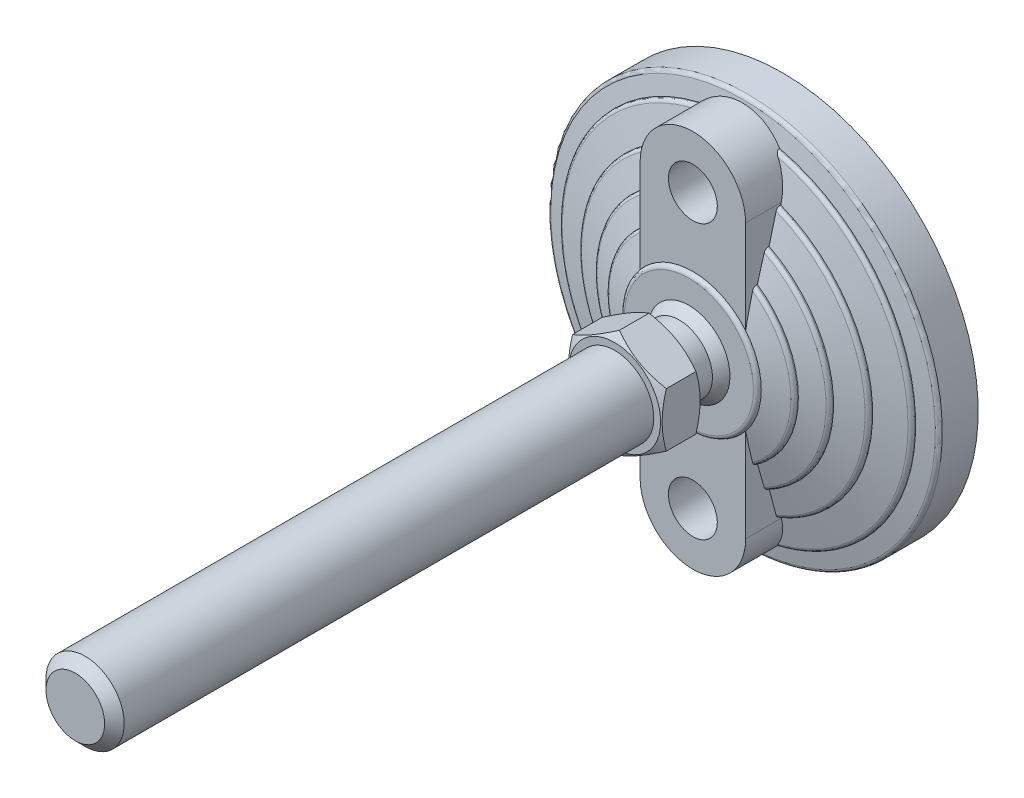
ISO-10303-21;
HEADER;
FILE_DESCRIPTION(('STEP AP214'),'2;1');
FILE_NAME('part.step','',(''),(''),'','','');
FILE_SCHEMA(('AUTOMOTIVE_DESIGN { 1 0 10303 214 1 1 1 1 }'));
ENDSEC;
DATA;
#1=APPLICATION_CONTEXT('core data for automotive mechanical design processes');
#2=APPLICATION_PROTOCOL_DEFINITION('international standard','automotive_design',2000,#1);
#3=PRODUCT_CONTEXT('',#1,'mechanical');
#4=PRODUCT('Part','Part','',(#3));
#5=PRODUCT_RELATED_PRODUCT_CATEGORY('part','',(#4));
#6=PRODUCT_DEFINITION_FORMATION('','',#4);
#7=PRODUCT_DEFINITION_CONTEXT('part definition',#1,'design');
#8=PRODUCT_DEFINITION('design','',#6,#7);
#9=PRODUCT_DEFINITION_SHAPE('','',#8);
#10=(LENGTH_UNIT() NAMED_UNIT(*) SI_UNIT(.MILLI.,.METRE.));
#11=(NAMED_UNIT(*) PLANE_ANGLE_UNIT() SI_UNIT($,.RADIAN.));
#12=(NAMED_UNIT(*) SI_UNIT($,.STERADIAN.) SOLID_ANGLE_UNIT());
#13=UNCERTAINTY_MEASURE_WITH_UNIT(LENGTH_MEASURE(1.E-05),#10,'distance_accuracy_value','');
#14=(GEOMETRIC_REPRESENTATION_CONTEXT(3) GLOBAL_UNCERTAINTY_ASSIGNED_CONTEXT((#13)) GLOBAL_UNIT_ASSIGNED_CONTEXT((#10,
#11,#12)) REPRESENTATION_CONTEXT('',''));
#15=CARTESIAN_POINT('',(0.,0.,0.));
#16=DIRECTION('',(0.,0.,1.));
#17=DIRECTION('',(1.,0.,0.));
#18=AXIS2_PLACEMENT_3D('',#15,#16,#17);
#19=CARTESIAN_POINT('',(-12.,14.022683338,36.));
#20=DIRECTION('',(0.,0.,1.));
#21=DIRECTION('',(0.,-1.,0.));
#22=AXIS2_PLACEMENT_3D('',#19,#20,#21);
#23=PLANE('',#22);
#24=CARTESIAN_POINT('',(0.,0.,36.));
#25=DIRECTION('',(0.,0.,-1.));
#26=DIRECTION('',(0.,1.,0.));
#27=AXIS2_PLACEMENT_3D('',#24,#25,#26);
#28=CIRCLE('',#27,11.75);
#29=CARTESIAN_POINT('',(0.,11.75,36.));
#30=VERTEX_POINT('',#29);
#31=EDGE_CURVE('E260',#30,#30,#28,.T.);
#32=ORIENTED_EDGE('',*,*,#31,.T.);
#33=EDGE_LOOP('',(#32));
#34=FACE_BOUND('',#33,.T.);
#35=CARTESIAN_POINT('',(0.,0.,36.));
#36=DIRECTION('',(0.,0.,-1.));
#37=DIRECTION('',(0.,1.,0.));
#38=AXIS2_PLACEMENT_3D('',#35,#36,#37);
#39=CIRCLE('',#38,8.5);
#40=CARTESIAN_POINT('',(0.,8.5,36.));
#41=VERTEX_POINT('',#40);
#42=EDGE_CURVE('E274',#41,#41,#39,.T.);
#43=ORIENTED_EDGE('',*,*,#42,.F.);
#44=EDGE_LOOP('',(#43));
#45=FACE_BOUND('',#44,.T.);
#46=ADVANCED_FACE('F14',(#34,#45),#23,.F.);
#47=CARTESIAN_POINT('',(0.,0.,36.));
#48=DIRECTION('',(0.,0.,-1.));
#49=DIRECTION('',(0.,1.,0.));
#50=AXIS2_PLACEMENT_3D('',#47,#48,#49);
#51=CYLINDRICAL_SURFACE('',#50,8.5);
#52=CARTESIAN_POINT('',(0.,0.,29.5));
#53=DIRECTION('',(0.,0.,-1.));
#54=DIRECTION('',(0.,1.,0.));
#55=AXIS2_PLACEMENT_3D('',#52,#53,#54);
#56=CIRCLE('',#55,8.5);
#57=CARTESIAN_POINT('',(0.,8.5,29.5));
#58=VERTEX_POINT('',#57);
#59=EDGE_CURVE('E573',#58,#58,#56,.F.);
#60=ORIENTED_EDGE('',*,*,#59,.T.);
#61=EDGE_LOOP('',(#60));
#62=FACE_BOUND('',#61,.T.);
#63=ORIENTED_EDGE('',*,*,#42,.T.);
#64=EDGE_LOOP('',(#63));
#65=FACE_BOUND('',#64,.T.);
#66=ADVANCED_FACE('F1291',(#62,#65),#51,.T.);
#67=CARTESIAN_POINT('',(-44.173478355,44.022,0.));
#68=DIRECTION('',(0.,0.,1.));
#69=DIRECTION('',(0.,-1.,0.));
#70=AXIS2_PLACEMENT_3D('',#67,#68,#69);
#71=PLANE('',#70);
#72=CARTESIAN_POINT('',(0.,0.,0.));
#73=DIRECTION('',(0.,0.,-1.));
#74=DIRECTION('',(0.,1.,0.));
#75=AXIS2_PLACEMENT_3D('',#72,#73,#74);
#76=CIRCLE('',#75,43.5);
#77=CARTESIAN_POINT('',(0.,43.5,0.));
#78=VERTEX_POINT('',#77);
#79=EDGE_CURVE('E576',#78,#78,#76,.F.);
#80=ORIENTED_EDGE('',*,*,#79,.F.);
#81=EDGE_LOOP('',(#80));
#82=FACE_BOUND('',#81,.T.);
#83=ADVANCED_FACE('F1280',(#82),#71,.F.);
#84=CARTESIAN_POINT('',(-8.631599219,8.622532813,29.5));
#85=DIRECTION('',(0.,0.,1.));
#86=DIRECTION('',(0.,-1.,0.));
#87=AXIS2_PLACEMENT_3D('',#84,#85,#86);
#88=PLANE('',#87);
#89=CARTESIAN_POINT('',(0.,0.,29.5));
#90=DIRECTION('',(0.,0.,-1.));
#91=DIRECTION('',(0.,1.,0.));
#92=AXIS2_PLACEMENT_3D('',#89,#90,#91);
#93=CIRCLE('',#92,8.49107182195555);
#94=CARTESIAN_POINT('',(0.,8.49107182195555,29.5));
#95=VERTEX_POINT('',#94);
#96=EDGE_CURVE('E579',#95,#95,#93,.T.);
#97=ORIENTED_EDGE('',*,*,#96,.F.);
#98=EDGE_LOOP('',(#97));
#99=FACE_BOUND('',#98,.T.);
#100=ORIENTED_EDGE('',*,*,#59,.F.);
#101=EDGE_LOOP('',(#100));
#102=FACE_BOUND('',#101,.T.);
#103=ADVANCED_FACE('F1275',(#99,#102),#88,.F.);
#104=CARTESIAN_POINT('',(0.,0.,3.));
#105=DIRECTION('',(0.,0.,-1.));
#106=DIRECTION('',(0.,1.,0.));
#107=AXIS2_PLACEMENT_3D('',#104,#105,#106);
#108=CYLINDRICAL_SURFACE('',#107,43.5);
#109=ORIENTED_EDGE('',*,*,#79,.T.);
#110=EDGE_LOOP('',(#109));
#111=FACE_BOUND('',#110,.T.);
#112=CARTESIAN_POINT('',(0.,0.,3.));
#113=DIRECTION('',(0.,0.,-1.));
#114=DIRECTION('',(0.,1.,0.));
#115=AXIS2_PLACEMENT_3D('',#112,#113,#114);
#116=CIRCLE('',#115,43.5);
#117=CARTESIAN_POINT('',(0.,43.5,3.));
#118=VERTEX_POINT('',#117);
#119=EDGE_CURVE('E582',#118,#118,#116,.T.);
#120=ORIENTED_EDGE('',*,*,#119,.T.);
#121=EDGE_LOOP('',(#120));
#122=FACE_BOUND('',#121,.T.);
#123=ADVANCED_FACE('F1268',(#111,#122),#108,.T.);
#124=CARTESIAN_POINT('',(-6.346764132,-28.675,3.));
#125=DIRECTION('',(0.,0.,1.));
#126=DIRECTION('',(0.,-1.,0.));
#127=AXIS2_PLACEMENT_3D('',#124,#125,#126);
#128=PLANE('',#127);
#129=CARTESIAN_POINT('',(0.,-35.,3.));
#130=DIRECTION('',(0.,0.,1.));
#131=DIRECTION('',(0.,-1.,0.));
#132=AXIS2_PLACEMENT_3D('',#129,#130,#131);
#133=CIRCLE('',#132,6.25);
#134=CARTESIAN_POINT('',(0.,-41.25,3.));
#135=VERTEX_POINT('',#134);
#136=EDGE_CURVE('E585',#135,#135,#133,.T.);
#137=ORIENTED_EDGE('',*,*,#136,.T.);
#138=EDGE_LOOP('',(#137));
#139=FACE_BOUND('',#138,.T.);
#140=ADVANCED_FACE('F774',(#139),#128,.T.);
#141=CARTESIAN_POINT('',(0.,0.,20.670266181));
#142=DIRECTION('',(0.,0.,-1.));
#143=DIRECTION('',(1.,0.,0.));
#144=AXIS2_PLACEMENT_3D('',#141,#142,#143);
#145=SPHERICAL_SURFACE('',#144,12.25);
#146=CARTESIAN_POINT('',(0.,0.,27.));
#147=DIRECTION('',(0.,0.,-1.));
#148=DIRECTION('',(0.,1.,0.));
#149=AXIS2_PLACEMENT_3D('',#146,#147,#148);
#150=CIRCLE('',#149,10.4879440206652);
#151=CARTESIAN_POINT('',(0.,10.4879440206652,27.));
#152=VERTEX_POINT('',#151);
#153=EDGE_CURVE('E588',#152,#152,#150,.F.);
#154=ORIENTED_EDGE('',*,*,#153,.T.);
#155=EDGE_LOOP('',(#154));
#156=FACE_BOUND('',#155,.T.);
#157=ORIENTED_EDGE('',*,*,#96,.T.);
#158=EDGE_LOOP('',(#157));
#159=FACE_BOUND('',#158,.T.);
#160=ADVANCED_FACE('F764',(#156,#159),#145,.T.);
#161=CARTESIAN_POINT('',(-50.774113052,50.6,3.));
#162=DIRECTION('',(0.,0.,1.));
#163=DIRECTION('',(0.,-1.,0.));
#164=AXIS2_PLACEMENT_3D('',#161,#162,#163);
#165=PLANE('',#164);
#166=ORIENTED_EDGE('',*,*,#119,.F.);
#167=EDGE_LOOP('',(#166));
#168=FACE_BOUND('',#167,.T.);
#169=CARTESIAN_POINT('',(0.,0.,3.));
#170=DIRECTION('',(0.,0.,-1.));
#171=DIRECTION('',(0.,1.,0.));
#172=AXIS2_PLACEMENT_3D('',#169,#170,#171);
#173=CIRCLE('',#172,50.);
#174=CARTESIAN_POINT('',(0.,50.,3.));
#175=VERTEX_POINT('',#174);
#176=EDGE_CURVE('E538',#175,#175,#173,.F.);
#177=ORIENTED_EDGE('',*,*,#176,.F.);
#178=EDGE_LOOP('',(#177));
#179=FACE_BOUND('',#178,.T.);
#180=ADVANCED_FACE('F762',(#168,#179),#165,.F.);
#181=CARTESIAN_POINT('',(0.,-35.,3.));
#182=DIRECTION('',(0.,0.,1.));
#183=DIRECTION('',(0.,-1.,0.));
#184=AXIS2_PLACEMENT_3D('',#181,#182,#183);
#185=CYLINDRICAL_SURFACE('',#184,6.25);
#186=ORIENTED_EDGE('',*,*,#136,.F.);
#187=EDGE_LOOP('',(#186));
#188=FACE_BOUND('',#187,.T.);
#189=CARTESIAN_POINT('',(0.,-35.,26.));
#190=DIRECTION('',(0.,0.,1.));
#191=DIRECTION('',(0.,-1.,0.));
#192=AXIS2_PLACEMENT_3D('',#189,#190,#191);
#193=CIRCLE('',#192,6.25);
#194=CARTESIAN_POINT('',(0.,-41.25,26.));
#195=VERTEX_POINT('',#194);
#196=EDGE_CURVE('E521',#195,#195,#193,.T.);
#197=ORIENTED_EDGE('',*,*,#196,.T.);
#198=EDGE_LOOP('',(#197));
#199=FACE_BOUND('',#198,.T.);
#200=ADVANCED_FACE('F622',(#188,#199),#185,.F.);
#201=CARTESIAN_POINT('',(-16.755457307,-16.698,27.));
#202=DIRECTION('',(0.,0.,-1.));
#203=DIRECTION('',(0.,1.,0.));
#204=AXIS2_PLACEMENT_3D('',#201,#202,#203);
#205=PLANE('',#204);
#206=ORIENTED_EDGE('',*,*,#153,.F.);
#207=EDGE_LOOP('',(#206));
#208=FACE_BOUND('',#207,.T.);
#209=CARTESIAN_POINT('',(0.,0.,27.));
#210=DIRECTION('',(0.,0.,-1.));
#211=DIRECTION('',(0.,1.,0.));
#212=AXIS2_PLACEMENT_3D('',#209,#210,#211);
#213=CIRCLE('',#212,16.5);
#214=CARTESIAN_POINT('',(0.,16.5,27.));
#215=VERTEX_POINT('',#214);
#216=EDGE_CURVE('E520',#215,#215,#213,.T.);
#217=ORIENTED_EDGE('',*,*,#216,.F.);
#218=EDGE_LOOP('',(#217));
#219=FACE_BOUND('',#218,.T.);
#220=ADVANCED_FACE('F772',(#208,#219),#205,.F.);
#221=CARTESIAN_POINT('',(-6.346764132,41.325,3.));
#222=DIRECTION('',(0.,0.,1.));
#223=DIRECTION('',(0.,-1.,0.));
#224=AXIS2_PLACEMENT_3D('',#221,#222,#223);
#225=PLANE('',#224);
#226=CARTESIAN_POINT('',(0.,35.,3.));
#227=DIRECTION('',(0.,0.,1.));
#228=DIRECTION('',(0.,-1.,0.));
#229=AXIS2_PLACEMENT_3D('',#226,#227,#228);
#230=CIRCLE('',#229,6.25);
#231=CARTESIAN_POINT('',(0.,28.75,3.));
#232=VERTEX_POINT('',#231);
#233=EDGE_CURVE('E639',#232,#232,#230,.T.);
#234=ORIENTED_EDGE('',*,*,#233,.T.);
#235=EDGE_LOOP('',(#234));
#236=FACE_BOUND('',#235,.T.);
#237=ADVANCED_FACE('F620',(#236),#225,.T.);
#238=CARTESIAN_POINT('',(0.,0.,26.));
#239=DIRECTION('',(0.,0.,-1.));
#240=DIRECTION('',(1.,0.,0.));
#241=AXIS2_PLACEMENT_3D('',#238,#239,#240);
#242=CONICAL_SURFACE('',#241,17.5,1.27229739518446);
#243=CARTESIAN_POINT('',(0.,0.,26.));
#244=DIRECTION('',(0.,0.,1.));
#245=DIRECTION('',(0.,-1.,0.));
#246=AXIS2_PLACEMENT_3D('',#243,#244,#245);
#247=CIRCLE('',#246,17.5);
#248=CARTESIAN_POINT('',(13.5000000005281,-11.1355287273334,25.999999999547));
#249=VERTEX_POINT('',#248);
#250=CARTESIAN_POINT('',(13.5000000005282,11.1355287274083,25.9999999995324));
#251=VERTEX_POINT('',#250);
#252=EDGE_CURVE('E517',#249,#251,#247,.T.);
#253=ORIENTED_EDGE('',*,*,#252,.F.);
#254=CARTESIAN_POINT('',(13.5,-18.9832672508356,24.2172043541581));
#255=CARTESIAN_POINT('',(13.5,-18.6579649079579,24.2987714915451));
#256=CARTESIAN_POINT('',(13.5,-18.3324976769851,24.3796813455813));
#257=CARTESIAN_POINT('',(13.5,-17.6811977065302,24.5400241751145));
#258=CARTESIAN_POINT('',(13.5,-17.3553649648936,24.6194571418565));
#259=CARTESIAN_POINT('',(13.5,-16.3773825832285,24.8552688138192));
#260=CARTESIAN_POINT('',(13.5,-15.7246371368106,25.0091884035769));
#261=CARTESIAN_POINT('',(13.5,-14.4172126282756,25.3088363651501));
#262=CARTESIAN_POINT('',(13.5,-13.7625334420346,25.4545641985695));
#263=CARTESIAN_POINT('',(13.5,-12.7787974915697,25.6654071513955));
#264=CARTESIAN_POINT('',(13.5,-12.4505717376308,25.7344021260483));
#265=CARTESIAN_POINT('',(13.5,-11.7935144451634,25.8694734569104));
#266=CARTESIAN_POINT('',(13.5,-11.4646828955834,25.9355497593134));
#267=CARTESIAN_POINT('',(13.5,-11.1355287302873,25.9999999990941));
#268=B_SPLINE_CURVE_WITH_KNOTS('',3,(#254,#255,#256,#257,#258,#259,#260,#261,#262,#263,#264,
#265,#266,#267),.UNSPECIFIED.,.F.,.F.,(4,2,2,2,2,2,4),(0.,1.00611699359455,2.01223994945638,
4.02414047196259,6.03617307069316,7.04235800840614,8.04856148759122),.UNSPECIFIED.);
#269=CARTESIAN_POINT('',(13.5,-18.9832672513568,24.2172043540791));
#270=VERTEX_POINT('',#269);
#271=EDGE_CURVE('E593',#270,#249,#268,.T.);
#272=ORIENTED_EDGE('',*,*,#271,.F.);
#273=CARTESIAN_POINT('',(3.16437848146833E-10,0.,24.217204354));
#274=DIRECTION('',(0.,0.,-1.));
#275=DIRECTION('',(1.,0.,0.));
#276=AXIS2_PLACEMENT_3D('',#273,#274,#275);
#277=CIRCLE('',#276,23.2940858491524);
#278=CARTESIAN_POINT('',(13.5,18.983267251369,24.2172043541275));
#279=VERTEX_POINT('',#278);
#280=EDGE_CURVE('E549',#279,#270,#277,.T.);
#281=ORIENTED_EDGE('',*,*,#280,.F.);
#282=CARTESIAN_POINT('',(13.5,11.1355287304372,25.9999999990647));
#283=CARTESIAN_POINT('',(13.5,11.4646828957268,25.9355497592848));
#284=CARTESIAN_POINT('',(13.5,11.7935144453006,25.8694734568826));
#285=CARTESIAN_POINT('',(13.5,12.4505717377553,25.7344021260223));
#286=CARTESIAN_POINT('',(13.5,12.7787974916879,25.6654071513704));
#287=CARTESIAN_POINT('',(13.5,13.762533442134,25.4545641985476));
#288=CARTESIAN_POINT('',(13.5,14.4172126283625,25.3088363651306));
#289=CARTESIAN_POINT('',(13.5,15.7246371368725,25.0091884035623));
#290=CARTESIAN_POINT('',(13.5,16.377382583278,24.8552688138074));
#291=CARTESIAN_POINT('',(13.5,17.3553649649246,24.619457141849));
#292=CARTESIAN_POINT('',(13.5,17.681197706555,24.5400241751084));
#293=CARTESIAN_POINT('',(13.5,18.3324976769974,24.3796813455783));
#294=CARTESIAN_POINT('',(13.5,18.6579649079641,24.2987714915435));
#295=CARTESIAN_POINT('',(13.5,18.9832672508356,24.2172043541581));
#296=B_SPLINE_CURVE_WITH_KNOTS('',3,(#282,#283,#284,#285,#286,#287,#288,#289,#290,#291,#292,
#293,#294,#295),.UNSPECIFIED.,.F.,.F.,(4,2,2,2,2,2,4),(0.,1.00620347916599,2.01238841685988,
4.02442101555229,6.03632153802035,7.04244449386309,8.04856148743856),.UNSPECIFIED.);
#297=EDGE_CURVE('E630',#251,#279,#296,.T.);
#298=ORIENTED_EDGE('',*,*,#297,.F.);
#299=EDGE_LOOP('',(#253,#272,#281,#298));
#300=FACE_BOUND('',#299,.T.);
#301=ADVANCED_FACE('F614',(#300),#242,.T.);
#302=CARTESIAN_POINT('',(13.267303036,19.999466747,23.261425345));
#303=CARTESIAN_POINT('',(29.097194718,9.49818825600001,23.261425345));
#304=CARTESIAN_POINT('',(29.097194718,-9.49818825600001,23.261425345));
#305=CARTESIAN_POINT('',(13.267303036,-19.999466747,23.261425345));
#306=CARTESIAN_POINT('',(13.267303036,19.999466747,23.716888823));
#307=CARTESIAN_POINT('',(29.097194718,9.49818825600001,23.716888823));
#308=CARTESIAN_POINT('',(29.097194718,-9.49818825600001,23.716888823));
#309=CARTESIAN_POINT('',(13.267303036,-19.999466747,23.716888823));
#310=CARTESIAN_POINT('',(13.117718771,19.773979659,24.083258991));
#311=CARTESIAN_POINT('',(28.769133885,9.39109946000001,24.083258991));
#312=CARTESIAN_POINT('',(28.769133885,-9.39109946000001,24.083258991));
#313=CARTESIAN_POINT('',(13.117718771,-19.773979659,24.083258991));
#314=CARTESIAN_POINT('',(12.877070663,19.411220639,24.217204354));
#315=CARTESIAN_POINT('',(28.241356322,9.218817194,24.217204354));
#316=CARTESIAN_POINT('',(28.241356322,-9.218817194,24.217204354));
#317=CARTESIAN_POINT('',(12.877070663,-19.411220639,24.217204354));
#318=(BOUNDED_SURFACE() B_SPLINE_SURFACE(3,3,((#302,#303,#304,#305),(#306,#307,#308,#309),(#310,
#311,#312,#313),(#314,#315,#316,#317)),.UNSPECIFIED.,.F.,.F.,
.F.) B_SPLINE_SURFACE_WITH_KNOTS((4,4),(4,4),(0.,1.),(0.,1.),
.UNSPECIFIED.) GEOMETRIC_REPRESENTATION_ITEM() RATIONAL_B_SPLINE_SURFACE(((1.,0.701869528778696,
0.701869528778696,1.),(0.869593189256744,0.610340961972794,0.610340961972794,0.869593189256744),
(0.869593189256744,0.610340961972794,0.610340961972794,0.869593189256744),(1.,0.701869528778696,
0.701869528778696,1.))) REPRESENTATION_ITEM('') SURFACE());
#319=CARTESIAN_POINT('',(13.5,-19.8431348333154,23.2614253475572));
#320=CARTESIAN_POINT('',(13.5,-19.8431370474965,23.2860556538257));
#321=CARTESIAN_POINT('',(13.5,-19.8420333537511,23.3106726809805));
#322=CARTESIAN_POINT('',(13.5,-19.8376465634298,23.3597018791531));
#323=CARTESIAN_POINT('',(13.5,-19.8343643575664,23.3841141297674));
#324=CARTESIAN_POINT('',(13.5,-19.8213486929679,23.4565201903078));
#325=CARTESIAN_POINT('',(13.5,-19.8084453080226,23.5039784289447));
#326=CARTESIAN_POINT('',(13.5,-19.7748969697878,23.5959548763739));
#327=CARTESIAN_POINT('',(13.5,-19.7542611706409,23.6404764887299));
#328=CARTESIAN_POINT('',(13.5,-19.7062220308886,23.7257350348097));
#329=CARTESIAN_POINT('',(13.5,-19.6788120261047,23.7664681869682));
#330=CARTESIAN_POINT('',(13.5,-19.6164784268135,23.8458096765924));
#331=CARTESIAN_POINT('',(13.5,-19.5811980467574,23.8841360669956));
#332=CARTESIAN_POINT('',(13.5,-19.5055204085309,23.9553392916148));
#333=CARTESIAN_POINT('',(13.5,-19.4651202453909,23.9882130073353));
#334=CARTESIAN_POINT('',(13.5,-19.3733614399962,24.0532792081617));
#335=CARTESIAN_POINT('',(13.5,-19.321293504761,24.0844693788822));
#336=CARTESIAN_POINT('',(13.5,-19.2133323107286,24.139175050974));
#337=CARTESIAN_POINT('',(13.5,-19.1574401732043,24.1626927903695));
#338=CARTESIAN_POINT('',(13.5,-19.0617819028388,24.1957297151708));
#339=CARTESIAN_POINT('',(13.5,-19.022719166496,24.207311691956));
#340=CARTESIAN_POINT('',(13.5,-18.9832672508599,24.2172043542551));
#341=B_SPLINE_CURVE_WITH_KNOTS('',3,(#319,#320,#321,#322,#323,#324,#325,#326,#327,#328,#329,
#330,#331,#332,#333,#334,#335,#336,#337,#338,#339,#340),.UNSPECIFIED.,.F.,.F.,(4,2,2,2,2,2,2,2,
2,2,4),(0.,0.073840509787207,0.147650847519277,0.294398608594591,0.440973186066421,
0.587692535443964,0.743377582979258,0.899151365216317,1.08055916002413,1.26191399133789,
1.38396481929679),.UNSPECIFIED.);
#342=CARTESIAN_POINT('',(13.5,-19.8431348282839,23.2614253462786));
#343=VERTEX_POINT('',#342);
#344=EDGE_CURVE('E709',#343,#270,#341,.T.);
#345=CARTESIAN_POINT('',(0.,0.,23.261425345));
#346=DIRECTION('',(0.,0.,-1.));
#347=DIRECTION('',(0.,1.,0.));
#348=AXIS2_PLACEMENT_3D('',#345,#346,#347);
#349=CIRCLE('',#348,24.);
#350=CARTESIAN_POINT('',(13.5,19.8431348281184,23.2614253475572));
#351=VERTEX_POINT('',#350);
#352=EDGE_CURVE('E547',#351,#343,#349,.T.);
#353=CARTESIAN_POINT('',(13.5,18.9832672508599,24.2172043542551));
#354=CARTESIAN_POINT('',(13.5,19.0245269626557,24.2068474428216));
#355=CARTESIAN_POINT('',(13.5,19.0653049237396,24.1946763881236));
#356=CARTESIAN_POINT('',(13.5,19.1456358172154,24.1665827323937));
#357=CARTESIAN_POINT('',(13.5,19.1851861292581,24.1506526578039));
#358=CARTESIAN_POINT('',(13.5,19.3016874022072,24.0969581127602));
#359=CARTESIAN_POINT('',(13.5,19.3761277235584,24.0533765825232));
#360=CARTESIAN_POINT('',(13.5,19.4913457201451,23.9675664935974));
#361=CARTESIAN_POINT('',(13.5,19.5352290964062,23.9294496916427));
#362=CARTESIAN_POINT('',(13.5,19.6161219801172,23.8466003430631));
#363=CARTESIAN_POINT('',(13.5,19.6531483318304,23.801884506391));
#364=CARTESIAN_POINT('',(13.5,19.7189344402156,23.7060840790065));
#365=CARTESIAN_POINT('',(13.5,19.747615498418,23.6549449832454));
#366=CARTESIAN_POINT('',(13.5,19.7944064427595,23.5480322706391));
#367=CARTESIAN_POINT('',(13.5,19.8125331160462,23.4922661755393));
#368=CARTESIAN_POINT('',(13.5,19.8308153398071,23.4067306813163));
#369=CARTESIAN_POINT('',(13.5,19.8354249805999,23.3778585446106));
#370=CARTESIAN_POINT('',(13.5,19.8415861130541,23.3198066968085));
#371=CARTESIAN_POINT('',(13.5,19.8431393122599,23.2906271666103));
#372=CARTESIAN_POINT('',(13.5,19.8431348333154,23.2614253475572));
#373=B_SPLINE_CURVE_WITH_KNOTS('',3,(#353,#354,#355,#356,#357,#358,#359,#360,#361,#362,#363,
#364,#365,#366,#367,#368,#369,#370,#371,#372),.UNSPECIFIED.,.F.,.F.,(4,2,2,2,2,2,2,2,2,4),(0.,
0.127516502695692,0.25528869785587,0.511930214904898,0.685657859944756,0.858952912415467,
1.03383282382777,1.20843381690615,1.29600438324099,1.38352601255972),.UNSPECIFIED.);
#374=EDGE_CURVE('E638',#279,#351,#373,.T.);
#375=ORIENTED_EDGE('',*,*,#280,.T.);
#376=ORIENTED_EDGE('',*,*,#344,.F.);
#377=ORIENTED_EDGE('',*,*,#352,.F.);
#378=ORIENTED_EDGE('',*,*,#374,.F.);
#379=EDGE_LOOP('',(#375,#376,#377,#378));
#380=FACE_BOUND('',#379,.T.);
#381=ADVANCED_FACE('F619',(#380),#318,.T.);
#382=CARTESIAN_POINT('',(0.,0.,23.261425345));
#383=DIRECTION('',(0.,0.,-1.));
#384=DIRECTION('',(0.,1.,0.));
#385=AXIS2_PLACEMENT_3D('',#382,#383,#384);
#386=CYLINDRICAL_SURFACE('',#385,24.);
#387=CARTESIAN_POINT('',(0.,0.,23.));
#388=DIRECTION('',(0.,0.,-1.));
#389=DIRECTION('',(0.,1.,0.));
#390=AXIS2_PLACEMENT_3D('',#387,#388,#389);
#391=CIRCLE('',#390,24.);
#392=CARTESIAN_POINT('',(13.5,19.8431348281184,23.));
#393=VERTEX_POINT('',#392);
#394=CARTESIAN_POINT('',(13.5,-19.8431348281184,23.000000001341));
#395=VERTEX_POINT('',#394);
#396=EDGE_CURVE('E545',#393,#395,#391,.T.);
#397=ORIENTED_EDGE('',*,*,#396,.F.);
#398=DIRECTION('',(0.,0.,-1.));
#399=VECTOR('',#398,1.);
#400=CARTESIAN_POINT('',(13.5,19.8431348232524,21.4084486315));
#401=LINE('',#400,#399);
#402=EDGE_CURVE('E686',#351,#393,#401,.T.);
#403=ORIENTED_EDGE('',*,*,#402,.F.);
#404=ORIENTED_EDGE('',*,*,#352,.T.);
#405=DIRECTION('',(0.,0.,1.));
#406=VECTOR('',#405,1.);
#407=CARTESIAN_POINT('',(13.5,-19.8431348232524,21.4084486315));
#408=LINE('',#407,#406);
#409=EDGE_CURVE('E707',#395,#343,#408,.T.);
#410=ORIENTED_EDGE('',*,*,#409,.F.);
#411=EDGE_LOOP('',(#397,#403,#404,#410));
#412=FACE_BOUND('',#411,.T.);
#413=ADVANCED_FACE('F691',(#412),#386,.T.);
#414=CARTESIAN_POINT('',(0.,0.,23.));
#415=DIRECTION('',(0.,0.,-1.));
#416=DIRECTION('',(0.,1.,0.));
#417=AXIS2_PLACEMENT_3D('',#414,#415,#416);
#418=CONICAL_SURFACE('',#417,24.,1.24904577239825);
#419=ORIENTED_EDGE('',*,*,#396,.T.);
#420=CARTESIAN_POINT('',(13.5,-26.022897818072,21.2279240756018));
#421=CARTESIAN_POINT('',(13.5,-25.5091656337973,21.3799212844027));
#422=CARTESIAN_POINT('',(13.5,-24.9951778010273,21.5310587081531));
#423=CARTESIAN_POINT('',(13.5,-23.9666187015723,21.8312926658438));
#424=CARTESIAN_POINT('',(13.5,-23.4520474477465,21.9803892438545));
#425=CARTESIAN_POINT('',(13.5,-22.4222240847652,22.2762276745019));
#426=CARTESIAN_POINT('',(13.5,-21.9069719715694,22.422969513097));
#427=CARTESIAN_POINT('',(13.5,-20.8756730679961,22.713675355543));
#428=CARTESIAN_POINT('',(13.5,-20.3596262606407,22.8576392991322));
#429=CARTESIAN_POINT('',(13.5,-19.8431348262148,23.0000000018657));
#430=B_SPLINE_CURVE_WITH_KNOTS('',3,(#420,#421,#422,#423,#424,#425,#426,#427,#428,#429),
.UNSPECIFIED.,.F.,.F.,(4,2,2,2,4),(0.,1.60723934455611,3.21444392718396,4.82165809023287,
6.42890708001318),.UNSPECIFIED.);
#431=CARTESIAN_POINT('',(13.5,-26.0228978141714,21.2279240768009));
#432=VERTEX_POINT('',#431);
#433=EDGE_CURVE('E699',#432,#395,#430,.T.);
#434=ORIENTED_EDGE('',*,*,#433,.F.);
#435=CARTESIAN_POINT('',(-5.51341958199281E-10,0.,21.227924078));
#436=DIRECTION('',(0.,0.,-1.));
#437=DIRECTION('',(0.,1.,0.));
#438=AXIS2_PLACEMENT_3D('',#435,#436,#437);
#439=CIRCLE('',#438,29.3162277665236);
#440=CARTESIAN_POINT('',(13.5,26.0228978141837,21.2279240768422));
#441=VERTEX_POINT('',#440);
#442=EDGE_CURVE('E544',#441,#432,#439,.T.);
#443=ORIENTED_EDGE('',*,*,#442,.F.);
#444=CARTESIAN_POINT('',(13.5000000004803,19.8431348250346,23.0000000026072));
#445=CARTESIAN_POINT('',(13.5000000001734,20.3596262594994,22.8576392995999));
#446=CARTESIAN_POINT('',(13.5000000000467,20.8756730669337,22.7136753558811));
#447=CARTESIAN_POINT('',(13.4999999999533,21.9069719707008,22.4229695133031));
#448=CARTESIAN_POINT('',(13.4999999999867,22.4222240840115,22.2762276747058));
#449=CARTESIAN_POINT('',(13.5000000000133,23.4520474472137,21.9803892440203));
#450=CARTESIAN_POINT('',(13.5000000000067,23.9666187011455,21.8312926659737));
#451=CARTESIAN_POINT('',(13.4999999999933,24.995177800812,21.5310587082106));
#452=CARTESIAN_POINT('',(13.4999999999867,25.5091656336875,21.3799212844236));
#453=CARTESIAN_POINT('',(13.5,26.022897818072,21.2279240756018));
#454=B_SPLINE_CURVE_WITH_KNOTS('',3,(#444,#445,#446,#447,#448,#449,#450,#451,#452,#453),
.UNSPECIFIED.,.F.,.F.,(4,2,2,2,4),(0.,1.60724899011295,3.2144631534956,4.82166773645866,
6.42890708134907),.UNSPECIFIED.);
#455=EDGE_CURVE('E679',#393,#441,#454,.T.);
#456=ORIENTED_EDGE('',*,*,#455,.F.);
#457=EDGE_LOOP('',(#419,#434,#443,#456));
#458=FACE_BOUND('',#457,.T.);
#459=ADVANCED_FACE('F687',(#458),#418,.T.);
#460=CARTESIAN_POINT('',(13.143890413,26.967353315,20.27924078));
#461=CARTESIAN_POINT('',(38.983891,14.372934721,20.27924078));
#462=CARTESIAN_POINT('',(38.983891,-14.372934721,20.27924078));
#463=CARTESIAN_POINT('',(13.143890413,-26.967353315,20.27924078));
#464=CARTESIAN_POINT('',(13.143890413,26.967353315,20.725161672));
#465=CARTESIAN_POINT('',(38.983891,14.372934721,20.725161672));
#466=CARTESIAN_POINT('',(38.983891,-14.372934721,20.725161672));
#467=CARTESIAN_POINT('',(13.143890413,-26.967353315,20.725161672));
#468=CARTESIAN_POINT('',(13.029654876,26.732975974,21.086911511));
#469=CARTESIAN_POINT('',(38.645076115,14.248017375,21.086911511));
#470=CARTESIAN_POINT('',(38.645076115,-14.248017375,21.086911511));
#471=CARTESIAN_POINT('',(13.029654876,-26.732975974,21.086911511));
#472=CARTESIAN_POINT('',(12.844309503,26.352702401,21.227924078));
#473=CARTESIAN_POINT('',(38.095354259,14.045340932,21.227924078));
#474=CARTESIAN_POINT('',(38.095354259,-14.045340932,21.227924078));
#475=CARTESIAN_POINT('',(12.844309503,-26.352702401,21.227924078));
#476=(BOUNDED_SURFACE() B_SPLINE_SURFACE(3,3,((#460,#461,#462,#463),(#464,#465,#466,#467),(#468,
#469,#470,#471),(#472,#473,#474,#475)),.UNSPECIFIED.,.F.,.F.,
.F.) B_SPLINE_SURFACE_WITH_KNOTS((4,4),(4,4),(0.,1.),(0.,1.),
.UNSPECIFIED.) GEOMETRIC_REPRESENTATION_ITEM() RATIONAL_B_SPLINE_SURFACE(((1.,0.625419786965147,
0.625419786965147,1.),(0.874161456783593,0.546717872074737,0.546717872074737,0.874161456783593),
(0.874161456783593,0.546717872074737,0.546717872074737,0.874161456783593),(1.,0.625419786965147,
0.625419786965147,1.))) REPRESENTATION_ITEM('') SURFACE());
#477=CARTESIAN_POINT('',(13.5,-26.7908566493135,20.2792407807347));
#478=CARTESIAN_POINT('',(13.5,-26.7908579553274,20.3051907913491));
#479=CARTESIAN_POINT('',(13.5,-26.7897247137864,20.3311275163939));
#480=CARTESIAN_POINT('',(13.5,-26.7852140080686,20.3827974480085));
#481=CARTESIAN_POINT('',(13.5,-26.781837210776,20.4085307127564));
#482=CARTESIAN_POINT('',(13.5,-26.7684139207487,20.4849772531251));
#483=CARTESIAN_POINT('',(13.5,-26.7550740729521,20.5351491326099));
#484=CARTESIAN_POINT('',(13.5,-26.7202107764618,20.632486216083));
#485=CARTESIAN_POINT('',(13.5,-26.6986916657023,20.6796529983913));
#486=CARTESIAN_POINT('',(13.5,-26.648348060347,20.7699105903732));
#487=CARTESIAN_POINT('',(13.5,-26.6195218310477,20.8130004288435));
#488=CARTESIAN_POINT('',(13.5,-26.5542840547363,20.8959059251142));
#489=CARTESIAN_POINT('',(13.5,-26.5176080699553,20.9355124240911));
#490=CARTESIAN_POINT('',(13.5,-26.4386436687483,21.0087234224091));
#491=CARTESIAN_POINT('',(13.5,-26.3963509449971,21.0423232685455));
#492=CARTESIAN_POINT('',(13.5,-26.3267001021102,21.0898793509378));
#493=CARTESIAN_POINT('',(13.5,-26.3008113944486,21.106038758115));
#494=CARTESIAN_POINT('',(13.5,-26.2478537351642,21.1362297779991));
#495=CARTESIAN_POINT('',(13.5,-26.2207861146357,21.1502637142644));
#496=CARTESIAN_POINT('',(13.5,-26.1657188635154,21.176151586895));
#497=CARTESIAN_POINT('',(13.5,-26.1377218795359,21.1880111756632));
#498=CARTESIAN_POINT('',(13.5,-26.0808891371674,21.2095853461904));
#499=CARTESIAN_POINT('',(13.5,-26.0520527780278,21.2192983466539));
#500=CARTESIAN_POINT('',(13.5,-26.0228978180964,21.2279240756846));
#501=B_SPLINE_CURVE_WITH_KNOTS('',3,(#477,#478,#479,#480,#481,#482,#483,#484,#485,#486,#487,
#488,#489,#490,#491,#492,#493,#494,#495,#496,#497,#498,#499,#500),.UNSPECIFIED.,.F.,.F.,(4,2,2,
2,2,2,2,2,2,2,2,4),(0.,0.0777993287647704,0.155575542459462,0.310500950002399,0.465344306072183,
0.620224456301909,0.78151106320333,0.942922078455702,1.03439248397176,1.12576216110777,
1.21689083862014,1.30808642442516),.UNSPECIFIED.);
#502=CARTESIAN_POINT('',(13.5,-26.7908566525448,20.27924078));
#503=VERTEX_POINT('',#502);
#504=EDGE_CURVE('E708',#503,#432,#501,.T.);
#505=CARTESIAN_POINT('',(0.,0.,20.27924078));
#506=DIRECTION('',(0.,0.,-1.));
#507=DIRECTION('',(0.,1.,0.));
#508=AXIS2_PLACEMENT_3D('',#505,#506,#507);
#509=CIRCLE('',#508,30.);
#510=CARTESIAN_POINT('',(13.5,26.7908566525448,20.2792407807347));
#511=VERTEX_POINT('',#510);
#512=EDGE_CURVE('E542',#511,#503,#509,.T.);
#513=CARTESIAN_POINT('',(13.5,26.0228978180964,21.2279240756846));
#514=CARTESIAN_POINT('',(13.5,26.0845570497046,21.2097134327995));
#515=CARTESIAN_POINT('',(13.5,26.1448460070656,21.1865640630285));
#516=CARTESIAN_POINT('',(13.5,26.2611194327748,21.1305926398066));
#517=CARTESIAN_POINT('',(13.5,26.3170802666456,21.0977216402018));
#518=CARTESIAN_POINT('',(13.5,26.422621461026,21.022592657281));
#519=CARTESIAN_POINT('',(13.5,26.4721821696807,20.9803067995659));
#520=CARTESIAN_POINT('',(13.5,26.5625156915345,20.887307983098));
#521=CARTESIAN_POINT('',(13.5,26.6033065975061,20.8366127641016));
#522=CARTESIAN_POINT('',(13.5,26.6708532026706,20.7331354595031));
#523=CARTESIAN_POINT('',(13.5,26.6985518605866,20.6809691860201));
#524=CARTESIAN_POINT('',(13.5,26.743619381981,20.5723560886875));
#525=CARTESIAN_POINT('',(13.5,26.7610021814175,20.5159151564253));
#526=CARTESIAN_POINT('',(13.5,26.7787549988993,20.4289072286));
#527=CARTESIAN_POINT('',(13.5,26.7832876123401,20.399138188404));
#528=CARTESIAN_POINT('',(13.5,26.78933789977,20.3393328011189));
#529=CARTESIAN_POINT('',(13.5,26.7908592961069,20.3092968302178));
#530=CARTESIAN_POINT('',(13.5,26.7908566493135,20.2792407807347));
#531=B_SPLINE_CURVE_WITH_KNOTS('',3,(#513,#514,#515,#516,#517,#518,#519,#520,#521,#522,#523,
#524,#525,#526,#527,#528,#529,#530),.UNSPECIFIED.,.F.,.F.,(4,2,2,2,2,2,2,2,4),(0.,
0.192810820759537,0.386609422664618,0.58098961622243,0.7749648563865,0.951184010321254,
1.12716456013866,1.21736691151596,1.30745768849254),.UNSPECIFIED.);
#532=EDGE_CURVE('E673',#441,#511,#531,.T.);
#533=ORIENTED_EDGE('',*,*,#442,.T.);
#534=ORIENTED_EDGE('',*,*,#504,.F.);
#535=ORIENTED_EDGE('',*,*,#512,.F.);
#536=ORIENTED_EDGE('',*,*,#532,.F.);
#537=EDGE_LOOP('',(#533,#534,#535,#536));
#538=FACE_BOUND('',#537,.T.);
#539=ADVANCED_FACE('F690',(#538),#476,.T.);
#540=CARTESIAN_POINT('',(0.,0.,20.27924078));
#541=DIRECTION('',(0.,0.,-1.));
#542=DIRECTION('',(0.,1.,0.));
#543=AXIS2_PLACEMENT_3D('',#540,#541,#542);
#544=CYLINDRICAL_SURFACE('',#543,30.);
#545=CARTESIAN_POINT('',(0.,0.,20.));
#546=DIRECTION('',(0.,0.,-1.));
#547=DIRECTION('',(0.,1.,0.));
#548=AXIS2_PLACEMENT_3D('',#545,#546,#547);
#549=CIRCLE('',#548,30.);
#550=CARTESIAN_POINT('',(13.5,26.7908566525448,20.));
#551=VERTEX_POINT('',#550);
#552=CARTESIAN_POINT('',(13.5,-26.7908566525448,19.9999999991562));
#553=VERTEX_POINT('',#552);
#554=EDGE_CURVE('E540',#551,#553,#549,.T.);
#555=ORIENTED_EDGE('',*,*,#554,.F.);
#556=DIRECTION('',(0.,0.,-1.));
#557=VECTOR('',#556,1.);
#558=CARTESIAN_POINT('',(13.5,26.7908566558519,21.4084486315));
#559=LINE('',#558,#557);
#560=EDGE_CURVE('E810',#511,#551,#559,.T.);
#561=ORIENTED_EDGE('',*,*,#560,.F.);
#562=ORIENTED_EDGE('',*,*,#512,.T.);
#563=DIRECTION('',(0.,0.,1.));
#564=VECTOR('',#563,1.);
#565=CARTESIAN_POINT('',(13.5,-26.7908566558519,21.4084486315));
#566=LINE('',#565,#564);
#567=EDGE_CURVE('E720',#553,#503,#566,.T.);
#568=ORIENTED_EDGE('',*,*,#567,.F.);
#569=EDGE_LOOP('',(#555,#561,#562,#568));
#570=FACE_BOUND('',#569,.T.);
#571=ADVANCED_FACE('F731',(#570),#544,.T.);
#572=CARTESIAN_POINT('',(0.,0.,20.));
#573=DIRECTION('',(0.,0.,-1.));
#574=DIRECTION('',(1.,0.,0.));
#575=AXIS2_PLACEMENT_3D('',#572,#573,#574);
#576=CONICAL_SURFACE('',#575,30.,1.29249666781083);
#577=ORIENTED_EDGE('',*,*,#554,.T.);
#578=CARTESIAN_POINT('',(13.5000000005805,-33.6690568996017,18.2072225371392));
#579=CARTESIAN_POINT('',(13.5000000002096,-33.0965095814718,18.3590521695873));
#580=CARTESIAN_POINT('',(13.5000000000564,-32.5238313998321,18.5103895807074));
#581=CARTESIAN_POINT('',(13.4999999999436,-31.3781752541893,18.8119124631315));
#582=CARTESIAN_POINT('',(13.4999999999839,-30.8051972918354,18.9620979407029));
#583=CARTESIAN_POINT('',(13.5000000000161,-29.6588964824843,19.2611513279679));
#584=CARTESIAN_POINT('',(13.5000000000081,-29.0855736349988,19.4100192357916));
#585=CARTESIAN_POINT('',(13.4999999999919,-27.9385277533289,19.7062178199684));
#586=CARTESIAN_POINT('',(13.4999999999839,-27.3648047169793,19.8535484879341));
#587=CARTESIAN_POINT('',(13.5,-26.7908566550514,19.9999999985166));
#588=B_SPLINE_CURVE_WITH_KNOTS('',3,(#578,#579,#580,#581,#582,#583,#584,#585,#586,#587),
.UNSPECIFIED.,.F.,.F.,(4,2,2,2,4),(0.,1.7770100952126,3.55401051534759,5.33101345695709,
7.10802608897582),.UNSPECIFIED.);
#589=CARTESIAN_POINT('',(13.5,-33.6690569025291,18.2072225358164));
#590=VERTEX_POINT('',#589);
#591=EDGE_CURVE('E721',#590,#553,#588,.T.);
#592=ORIENTED_EDGE('',*,*,#591,.F.);
#593=CARTESIAN_POINT('',(3.08438170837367E-10,0.,18.207222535));
#594=DIRECTION('',(0.,0.,-1.));
#595=DIRECTION('',(0.,1.,0.));
#596=AXIS2_PLACEMENT_3D('',#593,#594,#595);
#597=CIRCLE('',#596,36.2747211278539);
#598=CARTESIAN_POINT('',(13.5,33.6690569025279,18.2072225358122));
#599=VERTEX_POINT('',#598);
#600=EDGE_CURVE('E539',#599,#590,#597,.T.);
#601=ORIENTED_EDGE('',*,*,#600,.F.);
#602=CARTESIAN_POINT('',(13.5000000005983,26.790856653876,19.9999999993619));
#603=CARTESIAN_POINT('',(13.5000000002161,27.3648047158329,19.85354848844));
#604=CARTESIAN_POINT('',(13.5000000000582,27.9385277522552,19.7062178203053));
#605=CARTESIAN_POINT('',(13.4999999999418,29.0855736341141,19.4100192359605));
#606=CARTESIAN_POINT('',(13.4999999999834,29.6588964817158,19.2611513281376));
#607=CARTESIAN_POINT('',(13.5000000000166,30.8051972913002,18.9620979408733));
#608=CARTESIAN_POINT('',(13.5000000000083,31.378175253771,18.8119124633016));
#609=CARTESIAN_POINT('',(13.4999999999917,32.523831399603,18.5103895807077));
#610=CARTESIAN_POINT('',(13.4999999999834,33.0965095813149,18.359052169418));
#611=CARTESIAN_POINT('',(13.5,33.6690568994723,18.2072225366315));
#612=B_SPLINE_CURVE_WITH_KNOTS('',3,(#602,#603,#604,#605,#606,#607,#608,#609,#610,#611),
.UNSPECIFIED.,.F.,.F.,(4,2,2,2,4),(0.,1.77701263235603,3.55401557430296,5.3310159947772,
7.10802609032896),.UNSPECIFIED.);
#613=EDGE_CURVE('E666',#551,#599,#612,.T.);
#614=ORIENTED_EDGE('',*,*,#613,.F.);
#615=EDGE_LOOP('',(#577,#592,#601,#614));
#616=FACE_BOUND('',#615,.T.);
#617=ADVANCED_FACE('F727',(#616),#576,.T.);
#618=CARTESIAN_POINT('',(13.003667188,34.639639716,17.245698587));
#619=CARTESIAN_POINT('',(51.0914438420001,20.341547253,17.245698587));
#620=CARTESIAN_POINT('',(51.0914438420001,-20.341547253,17.245698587));
#621=CARTESIAN_POINT('',(13.003667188,-34.639639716,17.245698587));
#622=CARTESIAN_POINT('',(13.003667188,34.639639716,17.709515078));
#623=CARTESIAN_POINT('',(51.091443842,20.341547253,17.709515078));
#624=CARTESIAN_POINT('',(51.091443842,-20.341547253,17.709515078));
#625=CARTESIAN_POINT('',(13.003667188,-34.639639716,17.709515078));
#626=CARTESIAN_POINT('',(12.905504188,34.378149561,18.079802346));
#627=CARTESIAN_POINT('',(50.705761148,20.187991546,18.079802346));
#628=CARTESIAN_POINT('',(50.705761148,-20.187991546,18.079802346));
#629=CARTESIAN_POINT('',(12.905504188,-34.378149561,18.079802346));
#630=CARTESIAN_POINT('',(12.748767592,33.960628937,18.207222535));
#631=CARTESIAN_POINT('',(50.089942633,19.942809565,18.207222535));
#632=CARTESIAN_POINT('',(50.089942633,-19.942809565,18.207222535));
#633=CARTESIAN_POINT('',(12.748767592,-33.960628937,18.207222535));
#634=(BOUNDED_SURFACE() B_SPLINE_SURFACE(3,3,((#618,#619,#620,#621),(#622,#623,#624,#625),(#626,
#627,#628,#629),(#630,#631,#632,#633)),.UNSPECIFIED.,.F.,.F.,
.F.) B_SPLINE_SURFACE_WITH_KNOTS((4,4),(4,4),(0.,1.),(0.,1.),
.UNSPECIFIED.) GEOMETRIC_REPRESENTATION_ITEM() RATIONAL_B_SPLINE_SURFACE(((1.,0.56763364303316,
0.56763364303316,1.),(0.865565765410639,0.491324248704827,0.491324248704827,0.865565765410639),
(0.865565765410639,0.491324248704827,0.491324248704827,0.865565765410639),(1.,0.56763364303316,
0.56763364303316,1.))) REPRESENTATION_ITEM('') SURFACE());
#635=CARTESIAN_POINT('',(13.5,-34.4492380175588,17.2456985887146));
#636=CARTESIAN_POINT('',(13.5,-34.4492388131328,17.2724185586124));
#637=CARTESIAN_POINT('',(13.5,-34.4480869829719,17.2991252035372));
#638=CARTESIAN_POINT('',(13.5,-34.4434985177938,17.3523366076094));
#639=CARTESIAN_POINT('',(13.5,-34.4400623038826,17.3788414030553));
#640=CARTESIAN_POINT('',(13.5,-34.42638545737,17.457641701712));
#641=CARTESIAN_POINT('',(13.5,-34.4127763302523,17.5093910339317));
#642=CARTESIAN_POINT('',(13.5,-34.3771048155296,17.6098360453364));
#643=CARTESIAN_POINT('',(13.5,-34.3550440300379,17.6585323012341));
#644=CARTESIAN_POINT('',(13.5,-34.3032810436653,17.7516688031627));
#645=CARTESIAN_POINT('',(13.5,-34.2735788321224,17.7961090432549));
#646=CARTESIAN_POINT('',(13.5,-34.2066078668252,17.8808807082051));
#647=CARTESIAN_POINT('',(13.5,-34.1691521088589,17.9210639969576));
#648=CARTESIAN_POINT('',(13.5,-34.0883643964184,17.9950807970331));
#649=CARTESIAN_POINT('',(13.5,-34.045025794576,18.0289070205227));
#650=CARTESIAN_POINT('',(13.5,-33.9488589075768,18.0927883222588));
#651=CARTESIAN_POINT('',(13.5,-33.8955116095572,18.1220613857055));
#652=CARTESIAN_POINT('',(13.5,-33.7848588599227,18.1715344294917));
#653=CARTESIAN_POINT('',(13.5,-33.727559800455,18.1917486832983));
#654=CARTESIAN_POINT('',(13.5,-33.6690568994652,18.2072225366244));
#655=B_SPLINE_CURVE_WITH_KNOTS('',3,(#635,#636,#637,#638,#639,#640,#641,#642,#643,#644,#645,
#646,#647,#648,#649,#650,#651,#652,#653,#654),.UNSPECIFIED.,.F.,.F.,(4,2,2,2,2,2,2,2,2,4),(0.,
0.0801088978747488,0.160203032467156,0.31989418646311,0.479555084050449,0.639216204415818,
0.803305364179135,0.967581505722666,1.14930395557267,1.33073905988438),.UNSPECIFIED.);
#656=CARTESIAN_POINT('',(13.5,-34.4492380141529,17.2456985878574));
#657=VERTEX_POINT('',#656);
#658=EDGE_CURVE('E603',#657,#590,#655,.T.);
#659=CARTESIAN_POINT('',(0.,0.,17.245698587));
#660=DIRECTION('',(0.,0.,-1.));
#661=DIRECTION('',(0.,1.,0.));
#662=AXIS2_PLACEMENT_3D('',#659,#660,#661);
#663=CIRCLE('',#662,37.);
#664=CARTESIAN_POINT('',(13.5,34.4492380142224,17.2456985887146));
#665=VERTEX_POINT('',#664);
#666=EDGE_CURVE('E536',#665,#657,#663,.T.);
#667=CARTESIAN_POINT('',(13.5,33.6690568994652,18.2072225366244));
#668=CARTESIAN_POINT('',(13.5,33.7285004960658,18.1914984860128));
#669=CARTESIAN_POINT('',(13.5,33.7866931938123,18.1708859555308));
#670=CARTESIAN_POINT('',(13.5,33.8990439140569,18.1203027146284));
#671=CARTESIAN_POINT('',(13.5,33.9531903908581,18.0903064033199));
#672=CARTESIAN_POINT('',(13.5,34.0556677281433,18.0214004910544));
#673=CARTESIAN_POINT('',(13.5,34.1039872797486,17.9824739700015));
#674=CARTESIAN_POINT('',(13.5,34.192879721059,17.8966704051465));
#675=CARTESIAN_POINT('',(13.5,34.2334627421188,17.8498039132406));
#676=CARTESIAN_POINT('',(13.5,34.3033335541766,17.7520897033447));
#677=CARTESIAN_POINT('',(13.5,34.3331130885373,17.7015938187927));
#678=CARTESIAN_POINT('',(13.5,34.3830581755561,17.5960457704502));
#679=CARTESIAN_POINT('',(13.5,34.4032299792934,17.5409965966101));
#680=CARTESIAN_POINT('',(13.5,34.4284319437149,17.4456451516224));
#681=CARTESIAN_POINT('',(13.5,34.4362159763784,17.4060504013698));
#682=CARTESIAN_POINT('',(13.5,34.4466250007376,17.32621177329));
#683=CARTESIAN_POINT('',(13.5,34.4492528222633,17.2859682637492));
#684=CARTESIAN_POINT('',(13.5,34.4492380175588,17.2456985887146));
#685=B_SPLINE_CURVE_WITH_KNOTS('',3,(#667,#668,#669,#670,#671,#672,#673,#674,#675,#676,#677,
#678,#679,#680,#681,#682,#683,#684),.UNSPECIFIED.,.F.,.F.,(4,2,2,2,2,2,2,2,4),(0.,
0.184329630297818,0.369166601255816,0.554356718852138,0.739302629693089,0.914257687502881,
1.08909875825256,1.2098399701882,1.33051489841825),.UNSPECIFIED.);
#686=EDGE_CURVE('E659',#599,#665,#685,.T.);
#687=ORIENTED_EDGE('',*,*,#600,.T.);
#688=ORIENTED_EDGE('',*,*,#658,.F.);
#689=ORIENTED_EDGE('',*,*,#666,.F.);
#690=ORIENTED_EDGE('',*,*,#686,.F.);
#691=EDGE_LOOP('',(#687,#688,#689,#690));
#692=FACE_BOUND('',#691,.T.);
#693=ADVANCED_FACE('F730',(#692),#634,.T.);
#694=CARTESIAN_POINT('',(0.,0.,17.245698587));
#695=DIRECTION('',(0.,0.,-1.));
#696=DIRECTION('',(1.,0.,0.));
#697=AXIS2_PLACEMENT_3D('',#694,#695,#696);
#698=CYLINDRICAL_SURFACE('',#697,37.);
#699=CARTESIAN_POINT('',(0.,0.,17.));
#700=DIRECTION('',(0.,0.,-1.));
#701=DIRECTION('',(0.,1.,0.));
#702=AXIS2_PLACEMENT_3D('',#699,#700,#701);
#703=CIRCLE('',#702,37.);
#704=CARTESIAN_POINT('',(13.5,34.4492380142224,17.000000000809));
#705=VERTEX_POINT('',#704);
#706=CARTESIAN_POINT('',(13.5,-34.4492380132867,17.0000000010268));
#707=VERTEX_POINT('',#706);
#708=EDGE_CURVE('E533',#705,#707,#703,.T.);
#709=ORIENTED_EDGE('',*,*,#708,.F.);
#710=DIRECTION('',(0.,0.,-1.));
#711=VECTOR('',#710,1.);
#712=CARTESIAN_POINT('',(13.5,34.4492380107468,21.4084486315));
#713=LINE('',#712,#711);
#714=EDGE_CURVE('E807',#665,#705,#713,.T.);
#715=ORIENTED_EDGE('',*,*,#714,.F.);
#716=ORIENTED_EDGE('',*,*,#666,.T.);
#717=DIRECTION('',(0.,0.,1.));
#718=VECTOR('',#717,1.);
#719=CARTESIAN_POINT('',(13.5,-34.4492380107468,21.4084486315));
#720=LINE('',#719,#718);
#721=EDGE_CURVE('E602',#707,#657,#720,.T.);
#722=ORIENTED_EDGE('',*,*,#721,.F.);
#723=EDGE_LOOP('',(#709,#715,#716,#722));
#724=FACE_BOUND('',#723,.T.);
#725=ADVANCED_FACE('F739',(#724),#698,.T.);
#726=CARTESIAN_POINT('',(0.,0.,12.180196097));
#727=DIRECTION('',(0.,0.,-1.));
#728=DIRECTION('',(0.,1.,0.));
#729=AXIS2_PLACEMENT_3D('',#726,#727,#728);
#730=CYLINDRICAL_SURFACE('',#729,50.);
#731=CARTESIAN_POINT('',(0.,0.,12.180196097));
#732=DIRECTION('',(0.,0.,1.));
#733=DIRECTION('',(0.,-1.,0.));
#734=AXIS2_PLACEMENT_3D('',#731,#732,#733);
#735=CIRCLE('',#734,50.);
#736=CARTESIAN_POINT('',(0.,-50.,12.180196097));
#737=VERTEX_POINT('',#736);
#738=EDGE_CURVE('E371',#737,#737,#735,.T.);
#739=ORIENTED_EDGE('',*,*,#738,.F.);
#740=EDGE_LOOP('',(#739));
#741=FACE_BOUND('',#740,.T.);
#742=ORIENTED_EDGE('',*,*,#176,.T.);
#743=EDGE_LOOP('',(#742));
#744=FACE_BOUND('',#743,.T.);
#745=ADVANCED_FACE('F748',(#741,#744),#730,.T.);
#746=CARTESIAN_POINT('',(13.5,-35.,16.816897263));
#747=DIRECTION('',(1.,0.,0.));
#748=DIRECTION('',(0.,1.,0.));
#749=AXIS2_PLACEMENT_3D('',#746,#747,#748);
#750=PLANE('',#749);
#751=ORIENTED_EDGE('',*,*,#409,.T.);
#752=ORIENTED_EDGE('',*,*,#344,.T.);
#753=ORIENTED_EDGE('',*,*,#271,.T.);
#754=DIRECTION('',(0.,-1.,0.));
#755=VECTOR('',#754,1.);
#756=CARTESIAN_POINT('',(13.5,-29.840990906,26.));
#757=LINE('',#756,#755);
#758=CARTESIAN_POINT('',(13.5,-35.0000000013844,26.));
#759=VERTEX_POINT('',#758);
#760=EDGE_CURVE('E796',#249,#759,#757,.T.);
#761=ORIENTED_EDGE('',*,*,#760,.T.);
#762=DIRECTION('',(0.,0.,1.));
#763=VECTOR('',#762,1.);
#764=CARTESIAN_POINT('',(13.5,-35.0000000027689,19.6119));
#765=LINE('',#764,#763);
#766=CARTESIAN_POINT('',(13.5,-34.9999999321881,16.8716672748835));
#767=VERTEX_POINT('',#766);
#768=EDGE_CURVE('E370',#767,#759,#765,.T.);
#769=ORIENTED_EDGE('',*,*,#768,.F.);
#770=CARTESIAN_POINT('',(13.4999999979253,-34.4492380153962,16.9999999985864));
#771=CARTESIAN_POINT('',(13.4999999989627,-34.5410365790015,16.9786323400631));
#772=CARTESIAN_POINT('',(13.4999999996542,-34.632832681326,16.9572541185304));
#773=CARTESIAN_POINT('',(13.5000000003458,-34.8164199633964,16.9144765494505));
#774=CARTESIAN_POINT('',(13.5000000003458,-34.9082111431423,16.8930772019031));
#775=CARTESIAN_POINT('',(13.5,-34.9999998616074,16.8716672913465));
#776=B_SPLINE_CURVE_WITH_KNOTS('',3,(#770,#771,#772,#773,#774,#775),.UNSPECIFIED.,.F.,.F.,(4,2,
4),(0.,0.282757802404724,0.565515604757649),.UNSPECIFIED.);
#777=EDGE_CURVE('E809',#707,#767,#776,.T.);
#778=ORIENTED_EDGE('',*,*,#777,.F.);
#779=ORIENTED_EDGE('',*,*,#721,.T.);
#780=ORIENTED_EDGE('',*,*,#658,.T.);
#781=ORIENTED_EDGE('',*,*,#591,.T.);
#782=ORIENTED_EDGE('',*,*,#567,.T.);
#783=ORIENTED_EDGE('',*,*,#504,.T.);
#784=ORIENTED_EDGE('',*,*,#433,.T.);
#785=EDGE_LOOP('',(#751,#752,#753,#761,#769,#778,#779,#780,#781,#782,#783,#784));
#786=FACE_BOUND('',#785,.T.);
#787=ADVANCED_FACE('F610',(#786),#750,.T.);
#788=CARTESIAN_POINT('',(-13.5,-48.770918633,26.));
#789=DIRECTION('',(0.,0.,-1.));
#790=DIRECTION('',(0.,1.,0.));
#791=AXIS2_PLACEMENT_3D('',#788,#789,#790);
#792=PLANE('',#791);
#793=ORIENTED_EDGE('',*,*,#196,.F.);
#794=EDGE_LOOP('',(#793));
#795=FACE_BOUND('',#794,.T.);
#796=ORIENTED_EDGE('',*,*,#760,.F.);
#797=CARTESIAN_POINT('',(0.,0.,26.));
#798=DIRECTION('',(0.,0.,-1.));
#799=DIRECTION('',(0.,1.,0.));
#800=AXIS2_PLACEMENT_3D('',#797,#798,#799);
#801=CIRCLE('',#800,17.5);
#802=CARTESIAN_POINT('',(-13.4999999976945,-11.1355287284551,26.));
#803=VERTEX_POINT('',#802);
#804=EDGE_CURVE('E790',#803,#249,#801,.F.);
#805=ORIENTED_EDGE('',*,*,#804,.F.);
#806=DIRECTION('',(0.,1.,0.));
#807=VECTOR('',#806,1.);
#808=CARTESIAN_POINT('',(-13.5,-22.996170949,26.));
#809=LINE('',#808,#807);
#810=CARTESIAN_POINT('',(-13.5,-35.,26.));
#811=VERTEX_POINT('',#810);
#812=EDGE_CURVE('E501',#811,#803,#809,.T.);
#813=ORIENTED_EDGE('',*,*,#812,.F.);
#814=CARTESIAN_POINT('',(0.,-35.,26.));
#815=DIRECTION('',(0.,0.,-1.));
#816=DIRECTION('',(1.,0.,0.));
#817=AXIS2_PLACEMENT_3D('',#814,#815,#816);
#818=CIRCLE('',#817,13.5);
#819=EDGE_CURVE('E372',#759,#811,#818,.T.);
#820=ORIENTED_EDGE('',*,*,#819,.F.);
#821=EDGE_LOOP('',(#796,#805,#813,#820));
#822=FACE_BOUND('',#821,.T.);
#823=ADVANCED_FACE('F756',(#795,#822),#792,.F.);
#824=CARTESIAN_POINT('',(0.,0.,26.));
#825=DIRECTION('',(0.,0.,-1.));
#826=DIRECTION('',(0.,1.,0.));
#827=AXIS2_PLACEMENT_3D('',#824,#825,#826);
#828=TOROIDAL_SURFACE('',#827,16.5,1.);
#829=ORIENTED_EDGE('',*,*,#216,.T.);
#830=EDGE_LOOP('',(#829));
#831=FACE_BOUND('',#830,.T.);
#832=CARTESIAN_POINT('',(0.,0.,26.));
#833=DIRECTION('',(0.,0.,-1.));
#834=DIRECTION('',(0.,1.,0.));
#835=AXIS2_PLACEMENT_3D('',#832,#833,#834);
#836=CIRCLE('',#835,17.5);
#837=CARTESIAN_POINT('',(-13.4999999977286,11.1355287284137,26.));
#838=VERTEX_POINT('',#837);
#839=EDGE_CURVE('E491',#803,#838,#836,.T.);
#840=ORIENTED_EDGE('',*,*,#839,.F.);
#841=ORIENTED_EDGE('',*,*,#804,.T.);
#842=ORIENTED_EDGE('',*,*,#252,.T.);
#843=CARTESIAN_POINT('',(0.,0.,26.));
#844=DIRECTION('',(0.,0.,-1.));
#845=DIRECTION('',(0.,1.,0.));
#846=AXIS2_PLACEMENT_3D('',#843,#844,#845);
#847=CIRCLE('',#846,17.5);
#848=EDGE_CURVE('E830',#251,#838,#847,.F.);
#849=ORIENTED_EDGE('',*,*,#848,.T.);
#850=EDGE_LOOP('',(#840,#841,#842,#849));
#851=FACE_BOUND('',#850,.T.);
#852=ADVANCED_FACE('F651',(#831,#851),#828,.T.);
#853=CARTESIAN_POINT('',(0.,35.,3.));
#854=DIRECTION('',(0.,0.,1.));
#855=DIRECTION('',(0.,-1.,0.));
#856=AXIS2_PLACEMENT_3D('',#853,#854,#855);
#857=CYLINDRICAL_SURFACE('',#856,6.25);
#858=ORIENTED_EDGE('',*,*,#233,.F.);
#859=EDGE_LOOP('',(#858));
#860=FACE_BOUND('',#859,.T.);
#861=CARTESIAN_POINT('',(0.,35.,26.));
#862=DIRECTION('',(0.,0.,1.));
#863=DIRECTION('',(0.,-1.,0.));
#864=AXIS2_PLACEMENT_3D('',#861,#862,#863);
#865=CIRCLE('',#864,6.25);
#866=CARTESIAN_POINT('',(0.,28.75,26.));
#867=VERTEX_POINT('',#866);
#868=EDGE_CURVE('E335',#867,#867,#865,.T.);
#869=ORIENTED_EDGE('',*,*,#868,.T.);
#870=EDGE_LOOP('',(#869));
#871=FACE_BOUND('',#870,.T.);
#872=ADVANCED_FACE('F344',(#860,#871),#857,.F.);
#873=CARTESIAN_POINT('',(13.5,10.992341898,16.816897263));
#874=DIRECTION('',(1.,0.,0.));
#875=DIRECTION('',(0.,1.,0.));
#876=AXIS2_PLACEMENT_3D('',#873,#874,#875);
#877=PLANE('',#876);
#878=DIRECTION('',(0.,0.,-1.));
#879=VECTOR('',#878,1.);
#880=CARTESIAN_POINT('',(13.5,34.9999999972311,19.6119));
#881=LINE('',#880,#879);
#882=CARTESIAN_POINT('',(13.5,34.9999999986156,26.));
#883=VERTEX_POINT('',#882);
#884=CARTESIAN_POINT('',(13.5,35.0000000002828,16.8716672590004));
#885=VERTEX_POINT('',#884);
#886=EDGE_CURVE('E334',#883,#885,#881,.T.);
#887=ORIENTED_EDGE('',*,*,#886,.F.);
#888=DIRECTION('',(0.,-1.,0.));
#889=VECTOR('',#888,1.);
#890=CARTESIAN_POINT('',(13.5,29.817764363,26.));
#891=LINE('',#890,#889);
#892=EDGE_CURVE('E827',#883,#251,#891,.T.);
#893=ORIENTED_EDGE('',*,*,#892,.T.);
#894=ORIENTED_EDGE('',*,*,#297,.T.);
#895=ORIENTED_EDGE('',*,*,#374,.T.);
#896=ORIENTED_EDGE('',*,*,#402,.T.);
#897=ORIENTED_EDGE('',*,*,#455,.T.);
#898=ORIENTED_EDGE('',*,*,#532,.T.);
#899=ORIENTED_EDGE('',*,*,#560,.T.);
#900=ORIENTED_EDGE('',*,*,#613,.T.);
#901=ORIENTED_EDGE('',*,*,#686,.T.);
#902=ORIENTED_EDGE('',*,*,#714,.T.);
#903=CARTESIAN_POINT('',(13.5,35.0000000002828,16.8716672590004));
#904=CARTESIAN_POINT('',(13.5,34.908211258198,16.8930771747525));
#905=CARTESIAN_POINT('',(13.5,34.8164200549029,16.9144765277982));
#906=CARTESIAN_POINT('',(13.5,34.6328327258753,16.9572541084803));
#907=CARTESIAN_POINT('',(13.5,34.5410366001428,16.9786323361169));
#908=CARTESIAN_POINT('',(13.5,34.4492380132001,17.000000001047));
#909=B_SPLINE_CURVE_WITH_KNOTS('',3,(#903,#904,#905,#906,#907,#908),.UNSPECIFIED.,.F.,.F.,(4,2,
4),(0.,0.282757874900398,0.565515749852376),.UNSPECIFIED.);
#910=EDGE_CURVE('E353',#885,#705,#909,.T.);
#911=ORIENTED_EDGE('',*,*,#910,.F.);
#912=EDGE_LOOP('',(#887,#893,#894,#895,#896,#897,#898,#899,#900,#901,#902,#911));
#913=FACE_BOUND('',#912,.T.);
#914=ADVANCED_FACE('F342',(#913),#877,.T.);
#915=CARTESIAN_POINT('',(0.,0.,17.));
#916=DIRECTION('',(0.,0.,-1.));
#917=DIRECTION('',(0.,1.,0.));
#918=AXIS2_PLACEMENT_3D('',#915,#916,#917);
#919=CONICAL_SURFACE('',#918,37.,1.32581766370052);
#920=ORIENTED_EDGE('',*,*,#910,.T.);
#921=ORIENTED_EDGE('',*,*,#708,.T.);
#922=ORIENTED_EDGE('',*,*,#777,.T.);
#923=CARTESIAN_POINT('',(10.9763923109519,-42.859313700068,15.1893660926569));
#924=CARTESIAN_POINT('',(11.0902470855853,-42.7003026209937,15.2208143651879));
#925=CARTESIAN_POINT('',(11.2005742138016,-42.5389181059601,15.2528659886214));
#926=CARTESIAN_POINT('',(11.4140175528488,-42.2116832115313,15.3181517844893));
#927=CARTESIAN_POINT('',(11.5171338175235,-42.0458328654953,15.3513859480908));
#928=CARTESIAN_POINT('',(11.8153810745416,-41.5420926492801,15.4528082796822));
#929=CARTESIAN_POINT('',(11.9994728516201,-41.1979264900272,15.522733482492));
#930=CARTESIAN_POINT('',(12.3326507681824,-40.5045455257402,15.6650837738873));
#931=CARTESIAN_POINT('',(12.4824970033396,-40.1556720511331,15.737402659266));
#932=CARTESIAN_POINT('',(12.7520641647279,-39.447292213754,15.8858534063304));
#933=CARTESIAN_POINT('',(12.8717896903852,-39.0877874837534,15.9619846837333));
#934=CARTESIAN_POINT('',(13.0622198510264,-38.4243028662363,16.1041347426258));
#935=CARTESIAN_POINT('',(13.1378349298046,-38.1216000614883,16.1695954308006));
#936=CARTESIAN_POINT('',(13.2678621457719,-37.5121519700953,16.3027279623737));
#937=CARTESIAN_POINT('',(13.322274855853,-37.2054067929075,16.3703997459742));
#938=CARTESIAN_POINT('',(13.4106518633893,-36.5828211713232,16.509215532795));
#939=CARTESIAN_POINT('',(13.444159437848,-36.2669255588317,16.5804026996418));
#940=CARTESIAN_POINT('',(13.4888437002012,-35.6339537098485,16.7246710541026));
#941=CARTESIAN_POINT('',(13.5000180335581,-35.3168773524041,16.7977524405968));
#942=CARTESIAN_POINT('',(13.5,-34.9999998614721,16.871667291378));
#943=B_SPLINE_CURVE_WITH_KNOTS('',3,(#923,#924,#925,#926,#927,#928,#929,#930,#931,#932,#933,
#934,#935,#936,#937,#938,#939,#940,#941,#942),.UNSPECIFIED.,.F.,.F.,(4,2,2,2,2,2,2,2,2,4),(0.,
0.594146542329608,1.1882886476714,2.37624851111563,3.53450882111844,4.69259215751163,
5.64827317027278,6.60392835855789,7.5797914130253,8.55575734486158),.UNSPECIFIED.);
#944=CARTESIAN_POINT('',(10.9763923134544,-42.8593136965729,15.1893660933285));
#945=VERTEX_POINT('',#944);
#946=EDGE_CURVE('E362',#945,#767,#943,.T.);
#947=ORIENTED_EDGE('',*,*,#946,.F.);
#948=CARTESIAN_POINT('',(2.42528219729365E-10,0.,15.189366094));
#949=DIRECTION('',(0.,0.,-1.));
#950=DIRECTION('',(1.,0.,0.));
#951=AXIS2_PLACEMENT_3D('',#948,#949,#950);
#952=CIRCLE('',#951,44.2425356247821);
#953=CARTESIAN_POINT('',(10.9763923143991,42.8593136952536,15.1893660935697));
#954=VERTEX_POINT('',#953);
#955=EDGE_CURVE('E514',#954,#945,#952,.T.);
#956=ORIENTED_EDGE('',*,*,#955,.F.);
#957=CARTESIAN_POINT('',(13.5,35.0000000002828,16.8716672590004));
#958=CARTESIAN_POINT('',(13.5000427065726,35.388203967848,16.7811118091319));
#959=CARTESIAN_POINT('',(13.483257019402,35.7767153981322,16.6918094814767));
#960=CARTESIAN_POINT('',(13.4161694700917,36.5515574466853,16.5160966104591));
#961=CARTESIAN_POINT('',(13.3658621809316,36.9378877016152,16.4296865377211));
#962=CARTESIAN_POINT('',(13.2335638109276,37.6957533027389,16.2623134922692));
#963=CARTESIAN_POINT('',(13.1524048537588,38.0674159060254,16.1812680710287));
#964=CARTESIAN_POINT('',(12.9587932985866,38.8031976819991,16.0226641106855));
#965=CARTESIAN_POINT('',(12.846347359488,39.1673184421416,15.9451048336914));
#966=CARTESIAN_POINT('',(12.6145915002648,39.8185376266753,15.8078727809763));
#967=CARTESIAN_POINT('',(12.5004567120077,40.1073551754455,15.7475582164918));
#968=CARTESIAN_POINT('',(12.2523231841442,40.6768873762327,15.6295958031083));
#969=CARTESIAN_POINT('',(12.1183253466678,40.9576023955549,15.5719478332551));
#970=CARTESIAN_POINT('',(11.8279807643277,41.5153469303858,15.4582871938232));
#971=CARTESIAN_POINT('',(11.6712235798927,41.7921750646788,15.4023343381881));
#972=CARTESIAN_POINT('',(11.3382342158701,42.3345673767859,15.2935032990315));
#973=CARTESIAN_POINT('',(11.1619981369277,42.6001292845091,15.2406257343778));
#974=CARTESIAN_POINT('',(10.9763923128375,42.8593136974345,15.1893660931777));
#975=B_SPLINE_CURVE_WITH_KNOTS('',3,(#957,#958,#959,#960,#961,#962,#963,#964,#965,#966,#967,
#968,#969,#970,#971,#972,#973,#974),.UNSPECIFIED.,.F.,.F.,(4,2,2,2,2,2,2,2,4),(0.,
1.19554847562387,2.3912905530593,3.55683895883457,4.7221394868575,5.67049672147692,
6.6188108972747,7.58705133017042,8.55548594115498),.UNSPECIFIED.);
#976=EDGE_CURVE('E326',#885,#954,#975,.T.);
#977=ORIENTED_EDGE('',*,*,#976,.F.);
#978=EDGE_LOOP('',(#920,#921,#922,#947,#956,#977));
#979=FACE_BOUND('',#978,.T.);
#980=ADVANCED_FACE('F337',(#979),#919,.T.);
#981=CARTESIAN_POINT('',(9.509200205,43.983805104,14.219223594));
#982=CARTESIAN_POINT('',(69.947296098,30.917224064,14.219223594));
#983=CARTESIAN_POINT('',(69.947296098,-30.917224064,14.219223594));
#984=CARTESIAN_POINT('',(9.509200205,-43.983805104,14.219223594));
#985=CARTESIAN_POINT('',(9.50920020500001,43.983805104,14.696951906));
#986=CARTESIAN_POINT('',(69.947296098,30.917224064,14.696951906));
#987=CARTESIAN_POINT('',(69.947296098,-30.917224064,14.696951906));
#988=CARTESIAN_POINT('',(9.50920020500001,-43.983805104,14.696951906));
#989=CARTESIAN_POINT('',(9.447073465,43.696444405,15.073499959));
#990=CARTESIAN_POINT('',(69.4903073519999,30.715231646,15.073499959));
#991=CARTESIAN_POINT('',(69.4903073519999,-30.715231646,15.073499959));
#992=CARTESIAN_POINT('',(9.447073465,-43.696444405,15.073499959));
#993=CARTESIAN_POINT('',(9.349136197,43.243445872,15.189366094));
#994=CARTESIAN_POINT('',(68.769905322,30.396808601,15.189366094));
#995=CARTESIAN_POINT('',(68.769905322,-30.396808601,15.189366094));
#996=CARTESIAN_POINT('',(9.349136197,-43.243445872,15.189366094));
#997=(BOUNDED_SURFACE() B_SPLINE_SURFACE(3,3,((#981,#982,#983,#984),(#985,#986,#987,#988),(#989,
#990,#991,#992),(#993,#994,#995,#996)),.UNSPECIFIED.,.F.,.F.,
.F.) B_SPLINE_SURFACE_WITH_KNOTS((4,4),(4,4),(0.,1.),(0.,1.),
.UNSPECIFIED.) GEOMETRIC_REPRESENTATION_ITEM() RATIONAL_B_SPLINE_SURFACE(((1.,0.474210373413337,
0.474210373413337,1.),(0.858803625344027,0.407253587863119,0.407253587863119,0.858803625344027),
(0.858803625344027,0.407253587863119,0.407253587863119,0.858803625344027),(1.,0.474210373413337,
0.474210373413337,1.))) REPRESENTATION_ITEM('') SURFACE());
#998=CARTESIAN_POINT('',(0.,0.,14.219223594));
#999=DIRECTION('',(0.,0.,-1.));
#1000=DIRECTION('',(0.,1.,0.));
#1001=AXIS2_PLACEMENT_3D('',#998,#999,#1000);
#1002=CIRCLE('',#1001,45.);
#1003=CARTESIAN_POINT('',(10.2161330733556,43.8250000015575,14.2192235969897));
#1004=VERTEX_POINT('',#1003);
#1005=CARTESIAN_POINT('',(10.216133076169,-43.8249999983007,14.2192235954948));
#1006=VERTEX_POINT('',#1005);
#1007=EDGE_CURVE('E510',#1004,#1006,#1002,.T.);
#1008=CARTESIAN_POINT('',(10.9763923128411,42.8593136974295,15.1893660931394));
#1009=CARTESIAN_POINT('',(10.9414184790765,42.9081655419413,15.1796813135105));
#1010=CARTESIAN_POINT('',(10.906315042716,42.9564954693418,15.1677025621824));
#1011=CARTESIAN_POINT('',(10.8360680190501,43.0519016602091,15.1389495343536));
#1012=CARTESIAN_POINT('',(10.8009246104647,43.0989738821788,15.1221614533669));
#1013=CARTESIAN_POINT('',(10.7305792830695,43.1919542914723,15.0833916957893));
#1014=CARTESIAN_POINT('',(10.6953822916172,43.2378400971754,15.0613467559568));
#1015=CARTESIAN_POINT('',(10.6259110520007,43.3272572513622,15.0118633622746));
#1016=CARTESIAN_POINT('',(10.5916356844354,43.3707915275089,14.9844318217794));
#1017=CARTESIAN_POINT('',(10.5256394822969,43.4536161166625,14.9245405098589));
#1018=CARTESIAN_POINT('',(10.4938728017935,43.4929947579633,14.8922570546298));
#1019=CARTESIAN_POINT('',(10.4481189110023,43.5491166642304,14.8392517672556));
#1020=CARTESIAN_POINT('',(10.4332041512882,43.5673083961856,14.8208503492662));
#1021=CARTESIAN_POINT('',(10.4041301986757,43.6025925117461,14.78238705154));
#1022=CARTESIAN_POINT('',(10.3899723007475,43.6196830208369,14.7623224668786));
#1023=CARTESIAN_POINT('',(10.3542455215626,43.662608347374,14.7076181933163));
#1024=CARTESIAN_POINT('',(10.3334614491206,43.6873719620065,14.6715913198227));
#1025=CARTESIAN_POINT('',(10.2956896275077,43.732103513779,14.5949209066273));
#1026=CARTESIAN_POINT('',(10.2786908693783,43.7520853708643,14.5542912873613));
#1027=CARTESIAN_POINT('',(10.2536278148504,43.7814230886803,14.4795639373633));
#1028=CARTESIAN_POINT('',(10.2443910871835,43.7921884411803,14.446417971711));
#1029=CARTESIAN_POINT('',(10.2295810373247,43.8094156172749,14.3782664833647));
#1030=CARTESIAN_POINT('',(10.2239986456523,43.8158880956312,14.3432657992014));
#1031=CARTESIAN_POINT('',(10.2190506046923,43.8216216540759,14.2931619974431));
#1032=CARTESIAN_POINT('',(10.2179590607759,43.8228858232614,14.2784273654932));
#1033=CARTESIAN_POINT('',(10.216499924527,43.8245753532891,14.248872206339));
#1034=CARTESIAN_POINT('',(10.2161324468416,43.8250005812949,14.2340516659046));
#1035=CARTESIAN_POINT('',(10.2161330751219,43.8249999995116,14.21922359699));
#1036=B_SPLINE_CURVE_WITH_KNOTS('',3,(#1008,#1009,#1010,#1011,#1012,#1013,#1014,#1015,#1016,
#1017,#1018,#1019,#1020,#1021,#1022,#1023,#1024,#1025,#1026,#1027,#1028,#1029,#1030,#1031,#1032,
#1033,#1034,#1035),.UNSPECIFIED.,.F.,.F.,(4,2,2,2,2,2,2,2,2,2,2,2,2,4),(0.,0.182552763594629,
0.36563486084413,0.551042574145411,0.736213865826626,0.91580836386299,1.00534306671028,
1.09502635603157,1.23975433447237,1.38405573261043,1.49181113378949,1.59929807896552,
1.64375005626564,1.68820907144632),.UNSPECIFIED.);
#1037=EDGE_CURVE('E318',#954,#1004,#1036,.T.);
#1038=CARTESIAN_POINT('',(10.2161330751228,-43.8249999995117,14.2192235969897));
#1039=CARTESIAN_POINT('',(10.2161249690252,-43.8250086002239,14.2397973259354));
#1040=CARTESIAN_POINT('',(10.2168379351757,-43.824184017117,14.2603638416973));
#1041=CARTESIAN_POINT('',(10.2196429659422,-43.8209356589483,14.3012464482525));
#1042=CARTESIAN_POINT('',(10.2217330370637,-43.8185141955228,14.321562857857));
#1043=CARTESIAN_POINT('',(10.2271943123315,-43.8121797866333,14.3615120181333));
#1044=CARTESIAN_POINT('',(10.230548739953,-43.8082863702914,14.3811501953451));
#1045=CARTESIAN_POINT('',(10.2384364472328,-43.7991167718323,14.4198571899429));
#1046=CARTESIAN_POINT('',(10.242970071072,-43.7938401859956,14.4389258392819));
#1047=CARTESIAN_POINT('',(10.2581066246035,-43.7761886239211,14.4948727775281));
#1048=CARTESIAN_POINT('',(10.2702836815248,-43.7619475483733,14.5307547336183));
#1049=CARTESIAN_POINT('',(10.2978960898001,-43.7294783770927,14.5993915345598));
#1050=CARTESIAN_POINT('',(10.313342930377,-43.7112362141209,14.6321347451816));
#1051=CARTESIAN_POINT('',(10.3565346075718,-43.6599003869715,14.7128958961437));
#1052=CARTESIAN_POINT('',(10.3861274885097,-43.6244290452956,14.7584076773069));
#1053=CARTESIAN_POINT('',(10.4489566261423,-43.5482023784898,14.8418473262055));
#1054=CARTESIAN_POINT('',(10.4822021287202,-43.5074335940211,14.8797552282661));
#1055=CARTESIAN_POINT('',(10.5436529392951,-43.4310889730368,14.9415576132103));
#1056=CARTESIAN_POINT('',(10.5714611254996,-43.3962063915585,14.9667253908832));
#1057=CARTESIAN_POINT('',(10.6279526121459,-43.3245847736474,15.0131545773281));
#1058=CARTESIAN_POINT('',(10.6566364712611,-43.2878445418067,15.0344134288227));
#1059=CARTESIAN_POINT('',(10.7434400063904,-43.1754150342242,15.0927116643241));
#1060=CARTESIAN_POINT('',(10.8023642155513,-43.0974519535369,15.1243230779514));
#1061=CARTESIAN_POINT('',(10.8805294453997,-42.9915669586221,15.1573317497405));
#1062=CARTESIAN_POINT('',(10.8997568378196,-42.9653233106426,15.1647354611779));
#1063=CARTESIAN_POINT('',(10.9381278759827,-42.9125478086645,15.178109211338));
#1064=CARTESIAN_POINT('',(10.957271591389,-42.8860171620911,15.1840838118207));
#1065=CARTESIAN_POINT('',(10.9763923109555,-42.859313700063,15.1893660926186));
#1066=B_SPLINE_CURVE_WITH_KNOTS('',3,(#1038,#1039,#1040,#1041,#1042,#1043,#1044,#1045,#1046,
#1047,#1048,#1049,#1050,#1051,#1052,#1053,#1054,#1055,#1056,#1057,#1058,#1059,#1060,#1061,#1062,
#1063,#1064,#1065),.UNSPECIFIED.,.F.,.F.,(4,2,2,2,2,2,2,2,2,2,2,2,2,4),(0.,0.0616807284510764,
0.123272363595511,0.184073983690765,0.244893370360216,0.365736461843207,0.487011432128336,
0.680458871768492,0.874407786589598,1.02785807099,1.18140839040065,1.48821944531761,
1.58829974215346,1.68805618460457),.UNSPECIFIED.);
#1067=EDGE_CURVE('E502',#1006,#945,#1066,.T.);
#1068=ORIENTED_EDGE('',*,*,#1007,.F.);
#1069=ORIENTED_EDGE('',*,*,#1037,.F.);
#1070=ORIENTED_EDGE('',*,*,#955,.T.);
#1071=ORIENTED_EDGE('',*,*,#1067,.F.);
#1072=EDGE_LOOP('',(#1068,#1069,#1070,#1071));
#1073=FACE_BOUND('',#1072,.T.);
#1074=ADVANCED_FACE('F341',(#1073),#997,.T.);
#1075=CARTESIAN_POINT('',(0.,0.,14.219223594));
#1076=DIRECTION('',(0.,0.,-1.));
#1077=DIRECTION('',(1.,0.,0.));
#1078=AXIS2_PLACEMENT_3D('',#1075,#1076,#1077);
#1079=CYLINDRICAL_SURFACE('',#1078,45.);
#1080=CARTESIAN_POINT('',(0.,0.,14.));
#1081=DIRECTION('',(0.,0.,-1.));
#1082=DIRECTION('',(0.,1.,0.));
#1083=AXIS2_PLACEMENT_3D('',#1080,#1081,#1082);
#1084=CIRCLE('',#1083,45.);
#1085=CARTESIAN_POINT('',(10.2161330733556,43.8250000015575,14.));
#1086=VERTEX_POINT('',#1085);
#1087=CARTESIAN_POINT('',(10.2161330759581,-43.8249999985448,14.0000000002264));
#1088=VERTEX_POINT('',#1087);
#1089=EDGE_CURVE('E507',#1086,#1088,#1084,.T.);
#1090=ORIENTED_EDGE('',*,*,#1089,.F.);
#1091=DIRECTION('',(0.,0.,-1.));
#1092=VECTOR('',#1091,1.);
#1093=CARTESIAN_POINT('',(10.2161330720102,43.825000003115,19.6119));
#1094=LINE('',#1093,#1092);
#1095=EDGE_CURVE('E408',#1004,#1086,#1094,.T.);
#1096=ORIENTED_EDGE('',*,*,#1095,.F.);
#1097=ORIENTED_EDGE('',*,*,#1007,.T.);
#1098=DIRECTION('',(0.,0.,1.));
#1099=VECTOR('',#1098,1.);
#1100=CARTESIAN_POINT('',(10.2161330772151,-43.8249999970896,19.6119));
#1101=LINE('',#1100,#1099);
#1102=EDGE_CURVE('E526',#1088,#1006,#1101,.T.);
#1103=ORIENTED_EDGE('',*,*,#1102,.F.);
#1104=EDGE_LOOP('',(#1090,#1096,#1097,#1103));
#1105=FACE_BOUND('',#1104,.T.);
#1106=ADVANCED_FACE('F381',(#1105),#1079,.T.);
#1107=CARTESIAN_POINT('',(0.,0.,12.180196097));
#1108=DIRECTION('',(0.,0.,-1.));
#1109=DIRECTION('',(0.,1.,0.));
#1110=AXIS2_PLACEMENT_3D('',#1107,#1108,#1109);
#1111=TOROIDAL_SURFACE('',#1110,48.9999999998,1.00000000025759);
#1112=CARTESIAN_POINT('',(0.,0.,13.160776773));
#1113=DIRECTION('',(0.,0.,-1.));
#1114=DIRECTION('',(0.,1.,0.));
#1115=AXIS2_PLACEMENT_3D('',#1112,#1113,#1114);
#1116=CIRCLE('',#1115,49.196116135);
#1117=CARTESIAN_POINT('',(0.,49.196116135,13.160776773));
#1118=VERTEX_POINT('',#1117);
#1119=EDGE_CURVE('E407',#1118,#1118,#1116,.F.);
#1120=ORIENTED_EDGE('',*,*,#1119,.F.);
#1121=EDGE_LOOP('',(#1120));
#1122=FACE_BOUND('',#1121,.T.);
#1123=ORIENTED_EDGE('',*,*,#738,.T.);
#1124=EDGE_LOOP('',(#1123));
#1125=FACE_BOUND('',#1124,.T.);
#1126=ADVANCED_FACE('F379',(#1122,#1125),#1111,.T.);
#1127=CARTESIAN_POINT('',(0.,-35.,26.));
#1128=DIRECTION('',(0.,0.,-1.));
#1129=DIRECTION('',(1.,0.,0.));
#1130=AXIS2_PLACEMENT_3D('',#1127,#1128,#1129);
#1131=CYLINDRICAL_SURFACE('',#1130,13.5);
#1132=ORIENTED_EDGE('',*,*,#1102,.T.);
#1133=ORIENTED_EDGE('',*,*,#1067,.T.);
#1134=ORIENTED_EDGE('',*,*,#946,.T.);
#1135=ORIENTED_EDGE('',*,*,#768,.T.);
#1136=ORIENTED_EDGE('',*,*,#819,.T.);
#1137=DIRECTION('',(0.,0.,1.));
#1138=VECTOR('',#1137,1.);
#1139=CARTESIAN_POINT('',(-13.5,-35.,21.4084486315));
#1140=LINE('',#1139,#1138);
#1141=CARTESIAN_POINT('',(-13.5,-34.999999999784,16.8716672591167));
#1142=VERTEX_POINT('',#1141);
#1143=EDGE_CURVE('E498',#1142,#811,#1140,.T.);
#1144=ORIENTED_EDGE('',*,*,#1143,.F.);
#1145=CARTESIAN_POINT('',(-10.9763923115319,-42.8593136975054,15.1893660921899));
#1146=CARTESIAN_POINT('',(-11.0902470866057,-42.7003026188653,15.220814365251));
#1147=CARTESIAN_POINT('',(-11.2005742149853,-42.5389181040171,15.2528659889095));
#1148=CARTESIAN_POINT('',(-11.4140175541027,-42.2116832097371,15.3181517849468));
#1149=CARTESIAN_POINT('',(-11.5171338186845,-42.0458328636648,15.3513859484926));
#1150=CARTESIAN_POINT('',(-11.8153810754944,-41.5420926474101,15.4528082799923));
#1151=CARTESIAN_POINT('',(-11.9994728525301,-41.1979264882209,15.5227334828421));
#1152=CARTESIAN_POINT('',(-12.3326507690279,-40.5045455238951,15.6650837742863));
#1153=CARTESIAN_POINT('',(-12.4824970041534,-40.1556720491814,15.7374026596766));
#1154=CARTESIAN_POINT('',(-12.7520641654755,-39.4472922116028,15.8858534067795));
#1155=CARTESIAN_POINT('',(-12.8717896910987,-39.0877874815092,15.9619846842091));
#1156=CARTESIAN_POINT('',(-13.0622198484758,-38.4243028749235,16.1041347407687));
#1157=CARTESIAN_POINT('',(-13.1378349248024,-38.1216000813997,16.1695954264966));
#1158=CARTESIAN_POINT('',(-13.2678621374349,-37.5121520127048,16.3027279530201));
#1159=CARTESIAN_POINT('',(-13.322274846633,-37.2054068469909,16.3703997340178));
#1160=CARTESIAN_POINT('',(-13.4106518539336,-36.58282124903,16.5092155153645));
#1161=CARTESIAN_POINT('',(-13.444159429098,-36.2669256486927,16.5804026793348));
#1162=CARTESIAN_POINT('',(-13.4888436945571,-35.633953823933,16.7246710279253));
#1163=CARTESIAN_POINT('',(-13.5000180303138,-35.3168774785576,16.7977524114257));
#1164=CARTESIAN_POINT('',(-13.5,-34.9999999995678,16.8716672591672));
#1165=B_SPLINE_CURVE_WITH_KNOTS('',3,(#1145,#1146,#1147,#1148,#1149,#1150,#1151,#1152,#1153,
#1154,#1155,#1156,#1157,#1158,#1159,#1160,#1161,#1162,#1163,#1164),.UNSPECIFIED.,.F.,.F.,(4,2,2,
2,2,2,2,2,2,4),(0.,0.594146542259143,1.18828864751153,2.37624851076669,3.53450882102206,
4.69259215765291,5.64827313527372,6.60392828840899,7.57979130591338,8.55575720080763),.UNSPECIFIED.);
#1166=CARTESIAN_POINT('',(-10.9763923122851,-42.859313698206,15.1893660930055));
#1167=VERTEX_POINT('',#1166);
#1168=EDGE_CURVE('E390',#1167,#1142,#1165,.T.);
#1169=ORIENTED_EDGE('',*,*,#1168,.F.);
#1170=CARTESIAN_POINT('',(-10.2161330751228,-43.8249999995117,14.219223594));
#1171=CARTESIAN_POINT('',(-10.2161249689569,-43.825008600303,14.2397973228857));
#1172=CARTESIAN_POINT('',(-10.2168379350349,-43.8241840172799,14.2603638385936));
#1173=CARTESIAN_POINT('',(-10.2196429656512,-43.8209356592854,14.3012464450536));
#1174=CARTESIAN_POINT('',(-10.221733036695,-43.8185141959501,14.3215628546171));
#1175=CARTESIAN_POINT('',(-10.2271943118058,-43.8121797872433,14.3615120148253));
#1176=CARTESIAN_POINT('',(-10.2305487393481,-43.8082863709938,14.3811501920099));
#1177=CARTESIAN_POINT('',(-10.2384364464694,-43.7991167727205,14.4198571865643));
#1178=CARTESIAN_POINT('',(-10.2429700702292,-43.7938401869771,14.4389258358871));
#1179=CARTESIAN_POINT('',(-10.2581066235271,-43.7761886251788,14.4948727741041));
#1180=CARTESIAN_POINT('',(-10.2702836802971,-43.7619475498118,14.5307547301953));
#1181=CARTESIAN_POINT('',(-10.2978960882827,-43.7294783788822,14.5993915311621));
#1182=CARTESIAN_POINT('',(-10.3133429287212,-43.7112362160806,14.6321347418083));
#1183=CARTESIAN_POINT('',(-10.3565346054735,-43.6599003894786,14.7128958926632));
#1184=CARTESIAN_POINT('',(-10.3861274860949,-43.6244290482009,14.7584076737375));
#1185=CARTESIAN_POINT('',(-10.4489566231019,-43.5482023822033,14.8418473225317));
#1186=CARTESIAN_POINT('',(-10.4822021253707,-43.5074335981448,14.8797552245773));
#1187=CARTESIAN_POINT('',(-10.5436529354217,-43.4310889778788,14.941557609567));
#1188=CARTESIAN_POINT('',(-10.5714611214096,-43.3962063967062,14.9667253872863));
#1189=CARTESIAN_POINT('',(-10.6279526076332,-43.3245847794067,15.0131545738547));
#1190=CARTESIAN_POINT('',(-10.6566364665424,-43.287844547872,15.0344134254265));
#1191=CARTESIAN_POINT('',(-10.7434400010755,-43.1754150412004,15.0927116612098));
#1192=CARTESIAN_POINT('',(-10.8023642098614,-43.0974519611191,15.1243230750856));
#1193=CARTESIAN_POINT('',(-10.8805294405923,-42.9915669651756,15.1573317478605));
#1194=CARTESIAN_POINT('',(-10.8997568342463,-42.965323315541,15.1647354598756));
#1195=CARTESIAN_POINT('',(-10.9381278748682,-42.9125478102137,15.1781092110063));
#1196=CARTESIAN_POINT('',(-10.9572715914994,-42.8860171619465,15.1840838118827));
#1197=CARTESIAN_POINT('',(-10.9763923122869,-42.8593136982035,15.1893660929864));
#1198=B_SPLINE_CURVE_WITH_KNOTS('',3,(#1170,#1171,#1172,#1173,#1174,#1175,#1176,#1177,#1178,
#1179,#1180,#1181,#1182,#1183,#1184,#1185,#1186,#1187,#1188,#1189,#1190,#1191,#1192,#1193,#1194,
#1195,#1196,#1197),.UNSPECIFIED.,.F.,.F.,(4,2,2,2,2,2,2,2,2,2,2,2,2,4),(0.,0.0616807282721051,
0.123272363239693,0.184073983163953,0.244893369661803,0.365736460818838,0.487011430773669,
0.680458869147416,0.87440778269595,1.02785806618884,1.18140838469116,1.48821943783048,
1.58829974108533,1.68805618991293),.UNSPECIFIED.);
#1199=CARTESIAN_POINT('',(-10.2161330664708,-43.8250000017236,14.219223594));
#1200=VERTEX_POINT('',#1199);
#1201=EDGE_CURVE('E397',#1200,#1167,#1198,.T.);
#1202=ORIENTED_EDGE('',*,*,#1201,.F.);
#1203=DIRECTION('',(0.,0.,1.));
#1204=VECTOR('',#1203,1.);
#1205=CARTESIAN_POINT('',(-10.2161330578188,-43.8250000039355,14.109611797));
#1206=LINE('',#1205,#1204);
#1207=CARTESIAN_POINT('',(-10.216133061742,-43.8250000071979,13.9999999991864));
#1208=VERTEX_POINT('',#1207);
#1209=EDGE_CURVE('E468',#1208,#1200,#1206,.T.);
#1210=ORIENTED_EDGE('',*,*,#1209,.F.);
#1211=CARTESIAN_POINT('',(10.2161330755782,-43.8249999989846,14.000000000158));
#1212=CARTESIAN_POINT('',(9.97020847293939,-44.1097543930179,13.955706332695));
#1213=CARTESIAN_POINT('',(9.71217126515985,-44.3843445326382,13.9133179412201));
#1214=CARTESIAN_POINT('',(9.17374577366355,-44.9113062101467,13.8324868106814));
#1215=CARTESIAN_POINT('',(8.89335691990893,-45.1636771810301,13.7940441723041));
#1216=CARTESIAN_POINT('',(8.31182712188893,-45.6445337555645,13.7212058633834));
#1217=CARTESIAN_POINT('',(8.01066589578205,-45.8729954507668,13.6868142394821));
#1218=CARTESIAN_POINT('',(7.38995533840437,-46.3040391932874,13.6222415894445));
#1219=CARTESIAN_POINT('',(7.07040692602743,-46.506622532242,13.592060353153));
#1220=CARTESIAN_POINT('',(6.41484825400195,-46.8845701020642,13.5359848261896));
#1221=CARTESIAN_POINT('',(6.07882327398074,-47.0599093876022,13.510094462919));
#1222=CARTESIAN_POINT('',(5.39296621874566,-47.3818181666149,13.4627230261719));
#1223=CARTESIAN_POINT('',(5.04313419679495,-47.5283877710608,13.4412419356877));
#1224=CARTESIAN_POINT('',(4.33283427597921,-47.7913913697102,13.4027991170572));
#1225=CARTESIAN_POINT('',(3.97238786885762,-47.9078821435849,13.3858288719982));
#1226=CARTESIAN_POINT('',(3.24293849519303,-48.1101705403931,13.3564169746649));
#1227=CARTESIAN_POINT('',(2.87393835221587,-48.1959781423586,13.3439738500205));
#1228=CARTESIAN_POINT('',(2.08991768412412,-48.343836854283,13.3225586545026));
#1229=CARTESIAN_POINT('',(1.674210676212,-48.4023470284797,13.314102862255));
#1230=CARTESIAN_POINT('',(0.838994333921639,-48.4804318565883,13.3028230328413));
#1231=CARTESIAN_POINT('',(0.419484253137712,-48.4999986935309,13.3000001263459));
#1232=CARTESIAN_POINT('',(-0.376171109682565,-48.5000011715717,13.2999998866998));
#1233=CARTESIAN_POINT('',(-0.752321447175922,-48.4842686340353,13.3022697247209));
#1234=CARTESIAN_POINT('',(-1.50207049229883,-48.4214504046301,13.3113426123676));
#1235=CARTESIAN_POINT('',(-1.87566835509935,-48.374354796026,13.3181470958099));
#1236=CARTESIAN_POINT('',(-2.61798377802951,-48.2490764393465,13.3362793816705));
#1237=CARTESIAN_POINT('',(-2.98669461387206,-48.1708546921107,13.3476128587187));
#1238=CARTESIAN_POINT('',(-3.71613465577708,-47.9839169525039,13.3747648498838));
#1239=CARTESIAN_POINT('',(-4.07686384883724,-47.8752009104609,13.3905833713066));
#1240=CARTESIAN_POINT('',(-4.78761683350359,-47.6281514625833,13.426643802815));
#1241=CARTESIAN_POINT('',(-5.13764551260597,-47.4898318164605,13.4468836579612));
#1242=CARTESIAN_POINT('',(-5.82473732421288,-47.184571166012,13.4917245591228));
#1243=CARTESIAN_POINT('',(-6.16179924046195,-47.0176274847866,13.5163260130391));
#1244=CARTESIAN_POINT('',(-6.82029215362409,-46.6565209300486,13.5697840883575));
#1245=CARTESIAN_POINT('',(-7.14173617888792,-46.4623812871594,13.5986370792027));
#1246=CARTESIAN_POINT('',(-7.76695354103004,-46.0483044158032,13.6605027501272));
#1247=CARTESIAN_POINT('',(-8.07073211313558,-45.8283748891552,13.6935141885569));
#1248=CARTESIAN_POINT('',(-8.70112684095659,-45.3307278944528,13.7686595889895));
#1249=CARTESIAN_POINT('',(-9.02472178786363,-45.0492503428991,13.8114226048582));
#1250=CARTESIAN_POINT('',(-9.4883175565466,-44.6056004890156,13.8793534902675));
#1251=CARTESIAN_POINT('',(-9.6391185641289,-44.4542585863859,13.9026105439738));
#1252=CARTESIAN_POINT('',(-9.9332747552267,-44.1447042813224,13.9503733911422));
#1253=CARTESIAN_POINT('',(-10.0766302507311,-43.9864921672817,13.9748791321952));
#1254=CARTESIAN_POINT('',(-10.2161330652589,-43.8250000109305,13.9999999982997));
#1255=B_SPLINE_CURVE_WITH_KNOTS('',3,(#1211,#1212,#1213,#1214,#1215,#1216,#1217,#1218,#1219,
#1220,#1221,#1222,#1223,#1224,#1225,#1226,#1227,#1228,#1229,#1230,#1231,#1232,#1233,#1234,#1235,
#1236,#1237,#1238,#1239,#1240,#1241,#1242,#1243,#1244,#1245,#1246,#1247,#1248,#1249,#1250,#1251,
#1252,#1253,#1254),.UNSPECIFIED.,.F.,.F.,(4,2,2,2,2,2,2,2,2,2,2,2,2,2,2,2,2,2,2,2,2,4),(0.,
1.13621447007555,2.27245792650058,3.40982694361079,4.54713917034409,5.68548668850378,
6.82382981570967,7.96000812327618,9.09581657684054,10.3536032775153,11.611642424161,
12.7397847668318,13.8682839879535,14.9982016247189,16.1281211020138,17.257516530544,
18.3870176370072,19.5155597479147,20.6437656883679,21.9346193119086,22.5791427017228,
23.2236390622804),.UNSPECIFIED.);
#1256=EDGE_CURVE('E402',#1088,#1208,#1255,.T.);
#1257=ORIENTED_EDGE('',*,*,#1256,.F.);
#1258=EDGE_LOOP('',(#1132,#1133,#1134,#1135,#1136,#1144,#1169,#1202,#1210,#1257));
#1259=FACE_BOUND('',#1258,.T.);
#1260=ADVANCED_FACE('F374',(#1259),#1131,.T.);
#1261=CARTESIAN_POINT('',(-13.5,-10.992341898,16.816897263));
#1262=DIRECTION('',(-1.,0.,0.));
#1263=DIRECTION('',(0.,-1.,0.));
#1264=AXIS2_PLACEMENT_3D('',#1261,#1262,#1263);
#1265=PLANE('',#1264);
#1266=ORIENTED_EDGE('',*,*,#1143,.T.);
#1267=ORIENTED_EDGE('',*,*,#812,.T.);
#1268=CARTESIAN_POINT('',(-13.5000000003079,-18.983267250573,24.2172043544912));
#1269=CARTESIAN_POINT('',(-13.5000000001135,-18.6579649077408,24.2987714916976));
#1270=CARTESIAN_POINT('',(-13.5000000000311,-18.3324976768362,24.3796813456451));
#1271=CARTESIAN_POINT('',(-13.4999999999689,-17.6811977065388,24.5400241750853));
#1272=CARTESIAN_POINT('',(-13.4999999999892,-17.3553649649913,24.6194571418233));
#1273=CARTESIAN_POINT('',(-13.5000000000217,-16.3773825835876,24.855268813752));
#1274=CARTESIAN_POINT('',(-13.5000000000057,-15.7246371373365,25.0091884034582));
#1275=CARTESIAN_POINT('',(-13.4999999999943,-14.4172126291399,25.3088363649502));
#1276=CARTESIAN_POINT('',(-13.4999999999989,-13.7625334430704,25.4545641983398));
#1277=CARTESIAN_POINT('',(-13.5000000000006,-12.7787974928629,25.6654071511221));
#1278=CARTESIAN_POINT('',(-13.5000000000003,-12.45057173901,25.7344021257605));
#1279=CARTESIAN_POINT('',(-13.4999999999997,-11.7935144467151,25.8694734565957));
#1280=CARTESIAN_POINT('',(-13.4999999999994,-11.4646828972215,25.9355497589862));
#1281=CARTESIAN_POINT('',(-13.5,-11.1355287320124,25.9999999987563));
#1282=B_SPLINE_CURVE_WITH_KNOTS('',3,(#1268,#1269,#1270,#1271,#1272,#1273,#1274,#1275,#1276,
#1277,#1278,#1279,#1280,#1281),.UNSPECIFIED.,.F.,.F.,(4,2,2,2,2,2,4),(0.,1.00611699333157,
2.01223994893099,4.02414047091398,6.03617306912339,7.04235800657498,8.04856148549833),.UNSPECIFIED.);
#1283=CARTESIAN_POINT('',(-13.5,-18.9832672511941,24.2172043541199));
#1284=VERTEX_POINT('',#1283);
#1285=EDGE_CURVE('E495',#1284,#803,#1282,.T.);
#1286=ORIENTED_EDGE('',*,*,#1285,.F.);
#1287=CARTESIAN_POINT('',(-13.5,-19.8431348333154,23.2614253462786));
#1288=CARTESIAN_POINT('',(-13.5,-19.8431370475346,23.2860556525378));
#1289=CARTESIAN_POINT('',(-13.5,-19.8420333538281,23.310672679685));
#1290=CARTESIAN_POINT('',(-13.5,-19.8376465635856,23.3597018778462));
#1291=CARTESIAN_POINT('',(-13.5,-19.8343643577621,23.3841141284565));
#1292=CARTESIAN_POINT('',(-13.5,-19.8213486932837,23.456520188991));
#1293=CARTESIAN_POINT('',(-13.5,-19.8084453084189,23.5039784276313));
#1294=CARTESIAN_POINT('',(-13.5,-19.7748969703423,23.5959548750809));
#1295=CARTESIAN_POINT('',(-13.5,-19.7542611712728,23.6404764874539));
#1296=CARTESIAN_POINT('',(-13.5,-19.7062220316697,23.7257350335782));
#1297=CARTESIAN_POINT('',(-13.5,-19.6788120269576,23.7664681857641));
#1298=CARTESIAN_POINT('',(-13.5,-19.6164784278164,23.8458096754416));
#1299=CARTESIAN_POINT('',(-13.5,-19.5811980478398,23.8841360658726));
#1300=CARTESIAN_POINT('',(-13.5,-19.5055204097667,23.955339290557));
#1301=CARTESIAN_POINT('',(-13.5,-19.4651202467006,23.9882130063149));
#1302=CARTESIAN_POINT('',(-13.5,-19.3733614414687,24.0532792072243));
#1303=CARTESIAN_POINT('',(-13.5,-19.3212935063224,24.0844693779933));
#1304=CARTESIAN_POINT('',(-13.5,-19.2133323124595,24.1391750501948));
#1305=CARTESIAN_POINT('',(-13.5,-19.1574401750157,24.1626927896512));
#1306=CARTESIAN_POINT('',(-13.5,-19.06178190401,24.1957297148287));
#1307=CARTESIAN_POINT('',(-13.5,-19.0227191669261,24.207311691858));
#1308=CARTESIAN_POINT('',(-13.5,-18.9832672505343,24.2172043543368));
#1309=B_SPLINE_CURVE_WITH_KNOTS('',3,(#1287,#1288,#1289,#1290,#1291,#1292,#1293,#1294,#1295,
#1296,#1297,#1298,#1299,#1300,#1301,#1302,#1303,#1304,#1305,#1306,#1307,#1308),.UNSPECIFIED.,
.F.,.F.,(4,2,2,2,2,2,2,2,2,2,4),(0.,0.0738405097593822,0.147650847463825,0.294398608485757,
0.44097318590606,0.587692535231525,0.743377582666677,0.899151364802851,1.08055915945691,
1.26191399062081,1.38396482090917),.UNSPECIFIED.);
#1310=CARTESIAN_POINT('',(-13.499999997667,-19.8431348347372,23.2614253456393));
#1311=VERTEX_POINT('',#1310);
#1312=EDGE_CURVE('E824',#1311,#1284,#1309,.T.);
#1313=ORIENTED_EDGE('',*,*,#1312,.F.);
#1314=DIRECTION('',(0.,0.,1.));
#1315=VECTOR('',#1314,1.);
#1316=CARTESIAN_POINT('',(-13.499999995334,-19.8431348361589,23.1307126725));
#1317=LINE('',#1316,#1315);
#1318=CARTESIAN_POINT('',(-13.499999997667,-19.8431348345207,23.0000000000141));
#1319=VERTEX_POINT('',#1318);
#1320=EDGE_CURVE('E472',#1319,#1311,#1317,.T.);
#1321=ORIENTED_EDGE('',*,*,#1320,.F.);
#1322=CARTESIAN_POINT('',(-13.5000000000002,-26.0228978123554,21.2279240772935));
#1323=CARTESIAN_POINT('',(-13.5000000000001,-25.5091656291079,21.3799212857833));
#1324=CARTESIAN_POINT('',(-13.5,-24.9951777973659,21.5310587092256));
#1325=CARTESIAN_POINT('',(-13.5,-23.9666186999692,21.8312926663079));
#1326=CARTESIAN_POINT('',(-13.5,-23.4520474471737,21.9803892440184));
#1327=CARTESIAN_POINT('',(-13.5,-22.4222240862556,22.2762276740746));
#1328=CARTESIAN_POINT('',(-13.5,-21.9069719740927,22.4229695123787));
#1329=CARTESIAN_POINT('',(-13.5,-20.8756730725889,22.7136753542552));
#1330=CARTESIAN_POINT('',(-13.5,-20.35962626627,22.8576392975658));
#1331=CARTESIAN_POINT('',(-13.5,-19.8431348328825,23.0000000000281));
#1332=B_SPLINE_CURVE_WITH_KNOTS('',3,(#1322,#1323,#1324,#1325,#1326,#1327,#1328,#1329,#1330,
#1331),.UNSPECIFIED.,.F.,.F.,(4,2,2,2,4),(0.,1.60723934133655,3.21444392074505,4.82165808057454,
6.4289070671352),.UNSPECIFIED.);
#1333=CARTESIAN_POINT('',(-13.5,-26.0228978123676,21.2279240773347));
#1334=VERTEX_POINT('',#1333);
#1335=EDGE_CURVE('E473',#1334,#1319,#1332,.T.);
#1336=ORIENTED_EDGE('',*,*,#1335,.F.);
#1337=CARTESIAN_POINT('',(-13.5,-26.7908566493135,20.2792407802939));
#1338=CARTESIAN_POINT('',(-13.5,-26.7908579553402,20.3051907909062));
#1339=CARTESIAN_POINT('',(-13.5,-26.7897247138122,20.3311275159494));
#1340=CARTESIAN_POINT('',(-13.5,-26.7852140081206,20.3827974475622));
#1341=CARTESIAN_POINT('',(-13.5,-26.7818372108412,20.4085307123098));
#1342=CARTESIAN_POINT('',(-13.5,-26.7684139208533,20.4849772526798));
#1343=CARTESIAN_POINT('',(-13.5,-26.7550740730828,20.5351491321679));
#1344=CARTESIAN_POINT('',(-13.5,-26.7202107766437,20.6324862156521));
#1345=CARTESIAN_POINT('',(-13.5,-26.6986916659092,20.6796529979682));
#1346=CARTESIAN_POINT('',(-13.5,-26.648348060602,20.7699105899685));
#1347=CARTESIAN_POINT('',(-13.5,-26.6195218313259,20.8130004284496));
#1348=CARTESIAN_POINT('',(-13.5,-26.5542840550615,20.8959059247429));
#1349=CARTESIAN_POINT('',(-13.5,-26.5176080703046,20.935512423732));
#1350=CARTESIAN_POINT('',(-13.5,-26.438643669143,21.0087234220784));
#1351=CARTESIAN_POINT('',(-13.5,-26.396350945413,21.0423232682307));
#1352=CARTESIAN_POINT('',(-13.5,-26.3267001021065,21.0898793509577));
#1353=CARTESIAN_POINT('',(-13.5,-26.3008113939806,21.1060387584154));
#1354=CARTESIAN_POINT('',(-13.5,-26.2478537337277,21.1362297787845));
#1355=CARTESIAN_POINT('',(-13.5,-26.2207861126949,21.1502637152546));
#1356=CARTESIAN_POINT('',(-13.5,-26.1657188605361,21.176151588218));
#1357=CARTESIAN_POINT('',(-13.5,-26.1377218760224,21.1880111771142));
#1358=CARTESIAN_POINT('',(-13.5,-26.0808891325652,21.2095853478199));
#1359=CARTESIAN_POINT('',(-13.5,-26.0520527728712,21.2192983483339));
#1360=CARTESIAN_POINT('',(-13.5,-26.0228978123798,21.227924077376));
#1361=B_SPLINE_CURVE_WITH_KNOTS('',3,(#1337,#1338,#1339,#1340,#1341,#1342,#1343,#1344,#1345,
#1346,#1347,#1348,#1349,#1350,#1351,#1352,#1353,#1354,#1355,#1356,#1357,#1358,#1359,#1360),
.UNSPECIFIED.,.F.,.F.,(4,2,2,2,2,2,2,2,2,2,2,4),(0.,0.0777993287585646,0.155575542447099,
0.31050094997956,0.465344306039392,0.620224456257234,0.781511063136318,0.942922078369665,
1.03439248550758,1.12576216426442,1.21689084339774,1.30808643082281),.UNSPECIFIED.);
#1362=CARTESIAN_POINT('',(-13.5000000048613,-26.7908566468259,20.2792407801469));
#1363=VERTEX_POINT('',#1362);
#1364=EDGE_CURVE('E477',#1363,#1334,#1361,.T.);
#1365=ORIENTED_EDGE('',*,*,#1364,.F.);
#1366=DIRECTION('',(0.,0.,1.));
#1367=VECTOR('',#1366,1.);
#1368=CARTESIAN_POINT('',(-13.5000000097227,-26.7908566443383,20.13962039));
#1369=LINE('',#1368,#1367);
#1370=CARTESIAN_POINT('',(-13.5000000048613,-26.7908566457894,20.0000000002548));
#1371=VERTEX_POINT('',#1370);
#1372=EDGE_CURVE('E481',#1371,#1363,#1369,.T.);
#1373=ORIENTED_EDGE('',*,*,#1372,.F.);
#1374=CARTESIAN_POINT('',(-13.5000000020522,-33.6690569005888,18.2072225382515));
#1375=CARTESIAN_POINT('',(-13.5000000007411,-33.0965095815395,18.3590521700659));
#1376=CARTESIAN_POINT('',(-13.5000000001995,-32.5238313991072,18.5103895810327));
#1377=CARTESIAN_POINT('',(-13.4999999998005,-31.3781752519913,18.8119124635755));
#1378=CARTESIAN_POINT('',(-13.499999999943,-30.8051972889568,18.9620979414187));
#1379=CARTESIAN_POINT('',(-13.500000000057,-29.6588964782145,19.261151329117));
#1380=CARTESIAN_POINT('',(-13.5000000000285,-29.0855736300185,19.4100192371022));
#1381=CARTESIAN_POINT('',(-13.4999999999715,-27.9385277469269,19.7062178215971));
#1382=CARTESIAN_POINT('',(-13.499999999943,-27.364804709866,19.8535484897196));
#1383=CARTESIAN_POINT('',(-13.5,-26.7908566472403,20.0000000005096));
#1384=B_SPLINE_CURVE_WITH_KNOTS('',3,(#1374,#1375,#1376,#1377,#1378,#1379,#1380,#1381,#1382,
#1383),.UNSPECIFIED.,.F.,.F.,(4,2,2,2,4),(0.,1.77701009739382,3.55401051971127,5.33101346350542,
7.10802609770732),.UNSPECIFIED.);
#1385=CARTESIAN_POINT('',(-13.5,-33.669056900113,18.2072225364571));
#1386=VERTEX_POINT('',#1385);
#1387=EDGE_CURVE('E482',#1386,#1371,#1384,.T.);
#1388=ORIENTED_EDGE('',*,*,#1387,.F.);
#1389=CARTESIAN_POINT('',(-13.5,-34.4492380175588,17.2456985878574));
#1390=CARTESIAN_POINT('',(-13.5,-34.4492388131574,17.2724185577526));
#1391=CARTESIAN_POINT('',(-13.5,-34.4480869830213,17.2991252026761));
#1392=CARTESIAN_POINT('',(-13.5,-34.4434985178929,17.3523366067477));
#1393=CARTESIAN_POINT('',(-13.5,-34.4400623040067,17.3788414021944));
#1394=CARTESIAN_POINT('',(-13.5,-34.4263854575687,17.4576417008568));
#1395=CARTESIAN_POINT('',(-13.5,-34.4127763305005,17.5093910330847));
#1396=CARTESIAN_POINT('',(-13.5,-34.3771048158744,17.609836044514));
#1397=CARTESIAN_POINT('',(-13.5,-34.3550440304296,17.6585323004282));
#1398=CARTESIAN_POINT('',(-13.5,-34.3032810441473,17.7516688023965));
#1399=CARTESIAN_POINT('',(-13.5,-34.2735788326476,17.7961090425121));
#1400=CARTESIAN_POINT('',(-13.5,-34.2066078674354,17.8808807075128));
#1401=CARTESIAN_POINT('',(-13.5,-34.1691521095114,17.921063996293));
#1402=CARTESIAN_POINT('',(-13.5,-34.0883643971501,17.9950807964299));
#1403=CARTESIAN_POINT('',(-13.5,-34.0450257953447,18.0289070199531));
#1404=CARTESIAN_POINT('',(-13.5,-33.9488589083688,18.0927883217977));
#1405=CARTESIAN_POINT('',(-13.5,-33.8955116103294,18.1220613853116));
#1406=CARTESIAN_POINT('',(-13.5,-33.7848588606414,18.1715344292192));
#1407=CARTESIAN_POINT('',(-13.5,-33.7275598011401,18.1917486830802));
#1408=CARTESIAN_POINT('',(-13.5,-33.6690569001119,18.2072225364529));
#1409=B_SPLINE_CURVE_WITH_KNOTS('',3,(#1389,#1390,#1391,#1392,#1393,#1394,#1395,#1396,#1397,
#1398,#1399,#1400,#1401,#1402,#1403,#1404,#1405,#1406,#1407,#1408),.UNSPECIFIED.,.F.,.F.,(4,2,2,
2,2,2,2,2,2,4),(0.,0.0801088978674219,0.16020303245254,0.319894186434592,0.47955508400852,
0.639216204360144,0.803305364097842,0.967581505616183,1.14930395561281,1.33073906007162),.UNSPECIFIED.);
#1410=CARTESIAN_POINT('',(-13.4999999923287,-34.4492380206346,17.2456985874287));
#1411=VERTEX_POINT('',#1410);
#1412=EDGE_CURVE('E486',#1411,#1386,#1409,.T.);
#1413=ORIENTED_EDGE('',*,*,#1412,.F.);
#1414=DIRECTION('',(0.,0.,1.));
#1415=VECTOR('',#1414,1.);
#1416=CARTESIAN_POINT('',(-13.4999999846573,-34.4492380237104,17.1228492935));
#1417=LINE('',#1416,#1415);
#1418=CARTESIAN_POINT('',(-13.4999999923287,-34.4492380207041,17.));
#1419=VERTEX_POINT('',#1418);
#1420=EDGE_CURVE('E494',#1419,#1411,#1417,.T.);
#1421=ORIENTED_EDGE('',*,*,#1420,.F.);
#1422=CARTESIAN_POINT('',(-13.5,-34.9999999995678,16.8716672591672));
#1423=CARTESIAN_POINT('',(-13.5,-34.9082112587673,16.8930771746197));
#1424=CARTESIAN_POINT('',(-13.5,-34.8164200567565,16.914476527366));
#1425=CARTESIAN_POINT('',(-13.5,-34.6328327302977,16.9572541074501));
#1426=CARTESIAN_POINT('',(-13.5,-34.5410366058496,16.978632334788));
#1427=CARTESIAN_POINT('',(-13.5,-34.4492380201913,16.9999999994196));
#1428=B_SPLINE_CURVE_WITH_KNOTS('',3,(#1422,#1423,#1424,#1425,#1426,#1427),.UNSPECIFIED.,.F.,
.F.,(4,2,4),(0.,0.282757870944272,0.565515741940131),.UNSPECIFIED.);
#1429=EDGE_CURVE('E490',#1142,#1419,#1428,.T.);
#1430=ORIENTED_EDGE('',*,*,#1429,.F.);
#1431=EDGE_LOOP('',(#1266,#1267,#1286,#1313,#1321,#1336,#1365,#1373,#1388,#1413,#1421,#1430));
#1432=FACE_BOUND('',#1431,.T.);
#1433=ADVANCED_FACE('F378',(#1432),#1265,.T.);
#1434=CARTESIAN_POINT('',(0.,0.,26.));
#1435=DIRECTION('',(0.,0.,-1.));
#1436=DIRECTION('',(1.,0.,0.));
#1437=AXIS2_PLACEMENT_3D('',#1434,#1435,#1436);
#1438=CONICAL_SURFACE('',#1437,17.5,1.27229739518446);
#1439=ORIENTED_EDGE('',*,*,#839,.T.);
#1440=CARTESIAN_POINT('',(-13.5,18.9832672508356,24.2172043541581));
#1441=CARTESIAN_POINT('',(-13.5,18.6579649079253,24.2987714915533));
#1442=CARTESIAN_POINT('',(-13.5,18.3324976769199,24.3796813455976));
#1443=CARTESIAN_POINT('',(-13.5,17.6811977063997,24.5400241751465));
#1444=CARTESIAN_POINT('',(-13.5,17.3553649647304,24.6194571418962));
#1445=CARTESIAN_POINT('',(-13.5,16.3773825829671,24.8552688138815));
#1446=CARTESIAN_POINT('',(-13.5,15.7246371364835,25.0091884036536));
#1447=CARTESIAN_POINT('',(-13.5,14.4172126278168,25.3088363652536));
#1448=CARTESIAN_POINT('',(-13.5,13.7625334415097,25.4545641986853));
#1449=CARTESIAN_POINT('',(-13.5,12.7787974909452,25.6654071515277));
#1450=CARTESIAN_POINT('',(-13.5,12.450571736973,25.7344021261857));
#1451=CARTESIAN_POINT('',(-13.5,11.793514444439,25.8694734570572));
#1452=CARTESIAN_POINT('',(-13.5,11.4646828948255,25.9355497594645));
#1453=CARTESIAN_POINT('',(-13.5,11.135528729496,25.9999999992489));
#1454=B_SPLINE_CURVE_WITH_KNOTS('',3,(#1440,#1441,#1442,#1443,#1444,#1445,#1446,#1447,#1448,
#1449,#1450,#1451,#1452,#1453),.UNSPECIFIED.,.F.,.F.,(4,2,2,2,2,2,4),(0.,1.00611699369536,
2.01223994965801,4.02414047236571,6.03617307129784,7.04235800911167,8.04856148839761),.UNSPECIFIED.);
#1455=CARTESIAN_POINT('',(-13.5,18.9832672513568,24.2172043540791));
#1456=VERTEX_POINT('',#1455);
#1457=EDGE_CURVE('E489',#1456,#838,#1454,.T.);
#1458=ORIENTED_EDGE('',*,*,#1457,.F.);
#1459=CARTESIAN_POINT('',(-3.16437848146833E-10,0.,24.217204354));
#1460=DIRECTION('',(0.,0.,-1.));
#1461=DIRECTION('',(1.,0.,0.));
#1462=AXIS2_PLACEMENT_3D('',#1459,#1460,#1461);
#1463=CIRCLE('',#1462,23.2940858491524);
#1464=EDGE_CURVE('E523',#1284,#1456,#1463,.T.);
#1465=ORIENTED_EDGE('',*,*,#1464,.F.);
#1466=ORIENTED_EDGE('',*,*,#1285,.T.);
#1467=EDGE_LOOP('',(#1439,#1458,#1465,#1466));
#1468=FACE_BOUND('',#1467,.T.);
#1469=ADVANCED_FACE('F382',(#1468),#1438,.T.);
#1470=CARTESIAN_POINT('',(0.,0.,17.245698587));
#1471=DIRECTION('',(0.,0.,-1.));
#1472=DIRECTION('',(1.,0.,0.));
#1473=AXIS2_PLACEMENT_3D('',#1470,#1471,#1472);
#1474=CYLINDRICAL_SURFACE('',#1473,37.);
#1475=CARTESIAN_POINT('',(0.,0.,17.));
#1476=DIRECTION('',(0.,0.,-1.));
#1477=DIRECTION('',(0.,1.,0.));
#1478=AXIS2_PLACEMENT_3D('',#1475,#1476,#1477);
#1479=CIRCLE('',#1478,37.);
#1480=CARTESIAN_POINT('',(-13.5,34.4492380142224,17.000000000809));
#1481=VERTEX_POINT('',#1480);
#1482=EDGE_CURVE('E487',#1419,#1481,#1479,.T.);
#1483=ORIENTED_EDGE('',*,*,#1482,.F.);
#1484=ORIENTED_EDGE('',*,*,#1420,.T.);
#1485=CARTESIAN_POINT('',(1.28203871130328E-10,0.,17.245698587));
#1486=DIRECTION('',(0.,0.,1.));
#1487=DIRECTION('',(0.,-1.,0.));
#1488=AXIS2_PLACEMENT_3D('',#1485,#1486,#1487);
#1489=CIRCLE('',#1488,36.9999999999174);
#1490=CARTESIAN_POINT('',(-13.5,34.4492380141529,17.2456985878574));
#1491=VERTEX_POINT('',#1490);
#1492=EDGE_CURVE('E497',#1491,#1411,#1489,.T.);
#1493=ORIENTED_EDGE('',*,*,#1492,.F.);
#1494=DIRECTION('',(0.,0.,1.));
#1495=VECTOR('',#1494,1.);
#1496=CARTESIAN_POINT('',(-13.5,34.4492380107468,21.4084486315));
#1497=LINE('',#1496,#1495);
#1498=EDGE_CURVE('E842',#1481,#1491,#1497,.T.);
#1499=ORIENTED_EDGE('',*,*,#1498,.F.);
#1500=EDGE_LOOP('',(#1483,#1484,#1493,#1499));
#1501=FACE_BOUND('',#1500,.T.);
#1502=ADVANCED_FACE('F1009',(#1501),#1474,.T.);
#1503=CARTESIAN_POINT('',(-13.003667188,-34.639639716,17.245698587));
#1504=CARTESIAN_POINT('',(-51.0914438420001,-20.341547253,17.245698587));
#1505=CARTESIAN_POINT('',(-51.0914438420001,20.341547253,17.245698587));
#1506=CARTESIAN_POINT('',(-13.003667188,34.639639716,17.245698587));
#1507=CARTESIAN_POINT('',(-13.003667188,-34.639639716,17.709515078));
#1508=CARTESIAN_POINT('',(-51.091443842,-20.341547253,17.709515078));
#1509=CARTESIAN_POINT('',(-51.091443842,20.341547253,17.709515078));
#1510=CARTESIAN_POINT('',(-13.003667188,34.639639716,17.709515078));
#1511=CARTESIAN_POINT('',(-12.905504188,-34.378149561,18.079802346));
#1512=CARTESIAN_POINT('',(-50.705761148,-20.187991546,18.079802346));
#1513=CARTESIAN_POINT('',(-50.705761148,20.187991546,18.079802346));
#1514=CARTESIAN_POINT('',(-12.905504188,34.378149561,18.079802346));
#1515=CARTESIAN_POINT('',(-12.748767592,-33.960628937,18.207222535));
#1516=CARTESIAN_POINT('',(-50.089942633,-19.942809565,18.207222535));
#1517=CARTESIAN_POINT('',(-50.089942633,19.942809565,18.207222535));
#1518=CARTESIAN_POINT('',(-12.748767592,33.960628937,18.207222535));
#1519=(BOUNDED_SURFACE() B_SPLINE_SURFACE(3,3,((#1503,#1504,#1505,#1506),(#1507,#1508,#1509,
#1510),(#1511,#1512,#1513,#1514),(#1515,#1516,#1517,#1518)),.UNSPECIFIED.,.F.,.F.,
.F.) B_SPLINE_SURFACE_WITH_KNOTS((4,4),(4,4),(0.,1.),(0.,1.),
.UNSPECIFIED.) GEOMETRIC_REPRESENTATION_ITEM() RATIONAL_B_SPLINE_SURFACE(((1.,0.56763364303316,
0.56763364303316,1.),(0.865565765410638,0.491324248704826,0.491324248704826,0.865565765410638),
(0.865565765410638,0.491324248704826,0.491324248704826,0.865565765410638),(1.,0.56763364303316,
0.56763364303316,1.))) REPRESENTATION_ITEM('') SURFACE());
#1520=CARTESIAN_POINT('',(0.,0.,18.207222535));
#1521=DIRECTION('',(0.,0.,-1.));
#1522=DIRECTION('',(0.,1.,0.));
#1523=AXIS2_PLACEMENT_3D('',#1520,#1521,#1522);
#1524=CIRCLE('',#1523,36.274721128);
#1525=CARTESIAN_POINT('',(-13.5,33.6690569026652,18.2072225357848));
#1526=VERTEX_POINT('',#1525);
#1527=EDGE_CURVE('E483',#1526,#1386,#1524,.F.);
#1528=CARTESIAN_POINT('',(-13.5,34.4492380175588,17.2456985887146));
#1529=CARTESIAN_POINT('',(-13.5,34.4492388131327,17.2724185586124));
#1530=CARTESIAN_POINT('',(-13.5,34.4480869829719,17.2991252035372));
#1531=CARTESIAN_POINT('',(-13.5,34.4434985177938,17.3523366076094));
#1532=CARTESIAN_POINT('',(-13.5,34.4400623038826,17.3788414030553));
#1533=CARTESIAN_POINT('',(-13.5,34.42638545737,17.457641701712));
#1534=CARTESIAN_POINT('',(-13.5,34.4127763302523,17.5093910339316));
#1535=CARTESIAN_POINT('',(-13.5,34.3771048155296,17.6098360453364));
#1536=CARTESIAN_POINT('',(-13.5,34.3550440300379,17.6585323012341));
#1537=CARTESIAN_POINT('',(-13.5,34.3032810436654,17.7516688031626));
#1538=CARTESIAN_POINT('',(-13.5,34.2735788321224,17.7961090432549));
#1539=CARTESIAN_POINT('',(-13.5,34.2066078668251,17.8808807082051));
#1540=CARTESIAN_POINT('',(-13.5,34.1691521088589,17.9210639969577));
#1541=CARTESIAN_POINT('',(-13.5,34.0883643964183,17.9950807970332));
#1542=CARTESIAN_POINT('',(-13.5,34.0450257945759,18.0289070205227));
#1543=CARTESIAN_POINT('',(-13.5,33.9488589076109,18.0927883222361));
#1544=CARTESIAN_POINT('',(-13.5,33.8955116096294,18.1220613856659));
#1545=CARTESIAN_POINT('',(-13.5,33.7848588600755,18.1715344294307));
#1546=CARTESIAN_POINT('',(-13.5,33.7275598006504,18.1917486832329));
#1547=CARTESIAN_POINT('',(-13.5,33.6690568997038,18.2072225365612));
#1548=B_SPLINE_CURVE_WITH_KNOTS('',3,(#1528,#1529,#1530,#1531,#1532,#1533,#1534,#1535,#1536,
#1537,#1538,#1539,#1540,#1541,#1542,#1543,#1544,#1545,#1546,#1547),.UNSPECIFIED.,.F.,.F.,(4,2,2,
2,2,2,2,2,2,4),(0.,0.080108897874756,0.160203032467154,0.319894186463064,0.479555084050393,
0.639216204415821,0.803305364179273,0.967581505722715,1.14930395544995,1.33073905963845),.UNSPECIFIED.);
#1549=EDGE_CURVE('E845',#1491,#1526,#1548,.T.);
#1550=ORIENTED_EDGE('',*,*,#1492,.T.);
#1551=ORIENTED_EDGE('',*,*,#1412,.T.);
#1552=ORIENTED_EDGE('',*,*,#1527,.F.);
#1553=ORIENTED_EDGE('',*,*,#1549,.F.);
#1554=EDGE_LOOP('',(#1550,#1551,#1552,#1553));
#1555=FACE_BOUND('',#1554,.T.);
#1556=ADVANCED_FACE('F913',(#1555),#1519,.T.);
#1557=CARTESIAN_POINT('',(0.,0.,20.));
#1558=DIRECTION('',(0.,0.,-1.));
#1559=DIRECTION('',(1.,0.,0.));
#1560=AXIS2_PLACEMENT_3D('',#1557,#1558,#1559);
#1561=CONICAL_SURFACE('',#1560,30.,1.29249666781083);
#1562=CARTESIAN_POINT('',(0.,0.,20.));
#1563=DIRECTION('',(0.,0.,-1.));
#1564=DIRECTION('',(0.,1.,0.));
#1565=AXIS2_PLACEMENT_3D('',#1562,#1563,#1564);
#1566=CIRCLE('',#1565,30.);
#1567=CARTESIAN_POINT('',(-13.5,26.7908566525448,19.9999999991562));
#1568=VERTEX_POINT('',#1567);
#1569=EDGE_CURVE('E478',#1568,#1371,#1566,.F.);
#1570=ORIENTED_EDGE('',*,*,#1569,.F.);
#1571=CARTESIAN_POINT('',(-13.5000000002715,33.6690568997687,18.2072225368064));
#1572=CARTESIAN_POINT('',(-13.500000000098,33.0965095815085,18.3590521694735));
#1573=CARTESIAN_POINT('',(-13.5000000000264,32.5238313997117,18.5103895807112));
#1574=CARTESIAN_POINT('',(-13.4999999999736,31.3781752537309,18.81191246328));
#1575=CARTESIAN_POINT('',(-13.4999999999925,30.805197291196,18.9620979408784));
#1576=CARTESIAN_POINT('',(-13.5000000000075,29.6588964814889,19.2611513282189));
#1577=CARTESIAN_POINT('',(-13.5000000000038,29.0855736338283,19.4100192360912));
#1578=CARTESIAN_POINT('',(-13.4999999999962,27.9385277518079,19.7062178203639));
#1579=CARTESIAN_POINT('',(-13.4999999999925,27.3648047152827,19.853548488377));
#1580=CARTESIAN_POINT('',(-13.5,26.7908566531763,19.9999999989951));
#1581=B_SPLINE_CURVE_WITH_KNOTS('',3,(#1571,#1572,#1573,#1574,#1575,#1576,#1577,#1578,#1579,
#1580),.UNSPECIFIED.,.F.,.F.,(4,2,2,2,4),(0.,1.77701009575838,3.55401051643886,5.33101345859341,
7.10802609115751),.UNSPECIFIED.);
#1582=EDGE_CURVE('E841',#1526,#1568,#1581,.T.);
#1583=ORIENTED_EDGE('',*,*,#1582,.F.);
#1584=ORIENTED_EDGE('',*,*,#1527,.T.);
#1585=ORIENTED_EDGE('',*,*,#1387,.T.);
#1586=EDGE_LOOP('',(#1570,#1583,#1584,#1585));
#1587=FACE_BOUND('',#1586,.T.);
#1588=ADVANCED_FACE('F908',(#1587),#1561,.T.);
#1589=CARTESIAN_POINT('',(0.,0.,20.27924078));
#1590=DIRECTION('',(0.,0.,-1.));
#1591=DIRECTION('',(0.,1.,0.));
#1592=AXIS2_PLACEMENT_3D('',#1589,#1590,#1591);
#1593=CYLINDRICAL_SURFACE('',#1592,30.);
#1594=ORIENTED_EDGE('',*,*,#1569,.T.);
#1595=ORIENTED_EDGE('',*,*,#1372,.T.);
#1596=CARTESIAN_POINT('',(0.,0.,20.27924078));
#1597=DIRECTION('',(0.,0.,-1.));
#1598=DIRECTION('',(0.,1.,0.));
#1599=AXIS2_PLACEMENT_3D('',#1596,#1597,#1598);
#1600=CIRCLE('',#1599,30.);
#1601=CARTESIAN_POINT('',(-13.5,26.7908566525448,20.27924078));
#1602=VERTEX_POINT('',#1601);
#1603=EDGE_CURVE('E525',#1602,#1363,#1600,.F.);
#1604=ORIENTED_EDGE('',*,*,#1603,.F.);
#1605=DIRECTION('',(0.,0.,1.));
#1606=VECTOR('',#1605,1.);
#1607=CARTESIAN_POINT('',(-13.5,26.7908566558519,21.4084486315));
#1608=LINE('',#1607,#1606);
#1609=EDGE_CURVE('E837',#1568,#1602,#1608,.T.);
#1610=ORIENTED_EDGE('',*,*,#1609,.F.);
#1611=EDGE_LOOP('',(#1594,#1595,#1604,#1610));
#1612=FACE_BOUND('',#1611,.T.);
#1613=ADVANCED_FACE('F912',(#1612),#1593,.T.);
#1614=CARTESIAN_POINT('',(-13.143890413,-26.967353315,20.27924078));
#1615=CARTESIAN_POINT('',(-38.983891,-14.372934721,20.27924078));
#1616=CARTESIAN_POINT('',(-38.983891,14.372934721,20.27924078));
#1617=CARTESIAN_POINT('',(-13.143890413,26.967353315,20.27924078));
#1618=CARTESIAN_POINT('',(-13.143890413,-26.967353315,20.725161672));
#1619=CARTESIAN_POINT('',(-38.983891,-14.372934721,20.725161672));
#1620=CARTESIAN_POINT('',(-38.983891,14.372934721,20.725161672));
#1621=CARTESIAN_POINT('',(-13.143890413,26.967353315,20.725161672));
#1622=CARTESIAN_POINT('',(-13.029654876,-26.732975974,21.086911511));
#1623=CARTESIAN_POINT('',(-38.645076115,-14.248017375,21.086911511));
#1624=CARTESIAN_POINT('',(-38.645076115,14.248017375,21.086911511));
#1625=CARTESIAN_POINT('',(-13.029654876,26.732975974,21.086911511));
#1626=CARTESIAN_POINT('',(-12.844309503,-26.352702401,21.227924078));
#1627=CARTESIAN_POINT('',(-38.095354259,-14.045340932,21.227924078));
#1628=CARTESIAN_POINT('',(-38.095354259,14.045340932,21.227924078));
#1629=CARTESIAN_POINT('',(-12.844309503,26.352702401,21.227924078));
#1630=(BOUNDED_SURFACE() B_SPLINE_SURFACE(3,3,((#1614,#1615,#1616,#1617),(#1618,#1619,#1620,
#1621),(#1622,#1623,#1624,#1625),(#1626,#1627,#1628,#1629)),.UNSPECIFIED.,.F.,.F.,
.F.) B_SPLINE_SURFACE_WITH_KNOTS((4,4),(4,4),(0.,1.),(0.,1.),
.UNSPECIFIED.) GEOMETRIC_REPRESENTATION_ITEM() RATIONAL_B_SPLINE_SURFACE(((1.,0.625419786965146,
0.625419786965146,1.),(0.874161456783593,0.546717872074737,0.546717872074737,0.874161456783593),
(0.874161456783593,0.546717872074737,0.546717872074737,0.874161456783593),(1.,0.625419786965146,
0.625419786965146,1.))) REPRESENTATION_ITEM('') SURFACE());
#1631=CARTESIAN_POINT('',(0.,0.,21.227924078));
#1632=DIRECTION('',(0.,0.,-1.));
#1633=DIRECTION('',(0.,1.,0.));
#1634=AXIS2_PLACEMENT_3D('',#1631,#1632,#1633);
#1635=CIRCLE('',#1634,29.316227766);
#1636=CARTESIAN_POINT('',(-13.5,26.0228978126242,21.2279240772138));
#1637=VERTEX_POINT('',#1636);
#1638=EDGE_CURVE('E474',#1637,#1334,#1635,.F.);
#1639=CARTESIAN_POINT('',(-13.5,26.7908566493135,20.2792407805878));
#1640=CARTESIAN_POINT('',(-13.5,26.7908579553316,20.3051907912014));
#1641=CARTESIAN_POINT('',(-13.5,26.7897247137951,20.3311275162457));
#1642=CARTESIAN_POINT('',(-13.5,26.785214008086,20.3827974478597));
#1643=CARTESIAN_POINT('',(-13.5,26.7818372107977,20.4085307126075));
#1644=CARTESIAN_POINT('',(-13.5,26.7684139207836,20.4849772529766));
#1645=CARTESIAN_POINT('',(-13.5,26.7550740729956,20.5351491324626));
#1646=CARTESIAN_POINT('',(-13.5,26.7202107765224,20.6324862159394));
#1647=CARTESIAN_POINT('',(-13.5,26.6986916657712,20.6796529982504));
#1648=CARTESIAN_POINT('',(-13.5,26.648348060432,20.7699105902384));
#1649=CARTESIAN_POINT('',(-13.5,26.6195218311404,20.8130004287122));
#1650=CARTESIAN_POINT('',(-13.5,26.5542840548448,20.8959059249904));
#1651=CARTESIAN_POINT('',(-13.5,26.5176080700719,20.9355124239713));
#1652=CARTESIAN_POINT('',(-13.5,26.43864366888,21.0087234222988));
#1653=CARTESIAN_POINT('',(-13.5,26.3963509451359,21.0423232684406));
#1654=CARTESIAN_POINT('',(-13.5,26.3267001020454,21.0898793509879));
#1655=CARTESIAN_POINT('',(-13.5,26.3008113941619,21.1060387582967));
#1656=CARTESIAN_POINT('',(-13.5,26.2478537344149,21.136229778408));
#1657=CARTESIAN_POINT('',(-13.5,26.2207861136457,21.150263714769));
#1658=CARTESIAN_POINT('',(-13.5,26.1657188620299,21.1761515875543));
#1659=CARTESIAN_POINT('',(-13.5,26.1377218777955,21.1880111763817));
#1660=CARTESIAN_POINT('',(-13.5,26.0808891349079,21.2095853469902));
#1661=CARTESIAN_POINT('',(-13.5,26.0520527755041,21.2192983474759));
#1662=CARTESIAN_POINT('',(-13.5,26.0228978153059,21.2279240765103));
#1663=B_SPLINE_CURVE_WITH_KNOTS('',3,(#1639,#1640,#1641,#1642,#1643,#1644,#1645,#1646,#1647,
#1648,#1649,#1650,#1651,#1652,#1653,#1654,#1655,#1656,#1657,#1658,#1659,#1660,#1661,#1662),
.UNSPECIFIED.,.F.,.F.,(4,2,2,2,2,2,2,2,2,2,2,4),(0.,0.0777993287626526,0.155575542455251,
0.310500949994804,0.465344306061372,0.620224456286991,0.781511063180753,0.942922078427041,
1.03439248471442,1.12576216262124,1.2168908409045,1.30808642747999),.UNSPECIFIED.);
#1664=EDGE_CURVE('E840',#1602,#1637,#1663,.T.);
#1665=ORIENTED_EDGE('',*,*,#1603,.T.);
#1666=ORIENTED_EDGE('',*,*,#1364,.T.);
#1667=ORIENTED_EDGE('',*,*,#1638,.F.);
#1668=ORIENTED_EDGE('',*,*,#1664,.F.);
#1669=EDGE_LOOP('',(#1665,#1666,#1667,#1668));
#1670=FACE_BOUND('',#1669,.T.);
#1671=ADVANCED_FACE('F964',(#1670),#1630,.T.);
#1672=CARTESIAN_POINT('',(0.,0.,23.));
#1673=DIRECTION('',(0.,0.,-1.));
#1674=DIRECTION('',(0.,1.,0.));
#1675=AXIS2_PLACEMENT_3D('',#1672,#1673,#1674);
#1676=CONICAL_SURFACE('',#1675,24.,1.24904577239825);
#1677=CARTESIAN_POINT('',(0.,0.,23.));
#1678=DIRECTION('',(0.,0.,-1.));
#1679=DIRECTION('',(0.,1.,0.));
#1680=AXIS2_PLACEMENT_3D('',#1677,#1678,#1679);
#1681=CIRCLE('',#1680,24.);
#1682=CARTESIAN_POINT('',(-13.5,19.8431348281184,23.0000000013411));
#1683=VERTEX_POINT('',#1682);
#1684=EDGE_CURVE('E469',#1683,#1319,#1681,.F.);
#1685=ORIENTED_EDGE('',*,*,#1684,.F.);
#1686=CARTESIAN_POINT('',(-13.5,26.0228978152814,21.2279240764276));
#1687=CARTESIAN_POINT('',(-13.5,25.5091656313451,21.3799212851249));
#1688=CARTESIAN_POINT('',(-13.5,24.9951777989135,21.5310587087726));
#1689=CARTESIAN_POINT('',(-13.5,23.9666187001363,21.8312926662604));
#1690=CARTESIAN_POINT('',(-13.5,23.4520474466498,21.9803892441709));
#1691=CARTESIAN_POINT('',(-13.5,22.4222240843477,22.2762276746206));
#1692=CARTESIAN_POINT('',(-13.5,21.9069719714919,22.4229695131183));
#1693=CARTESIAN_POINT('',(-13.5,20.8756730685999,22.7136753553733));
#1694=CARTESIAN_POINT('',(-13.5,20.3596262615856,22.8576392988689));
#1695=CARTESIAN_POINT('',(-13.5,19.8431348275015,23.0000000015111));
#1696=B_SPLINE_CURVE_WITH_KNOTS('',3,(#1686,#1687,#1688,#1689,#1690,#1691,#1692,#1693,#1694,
#1695),.UNSPECIFIED.,.F.,.F.,(4,2,2,2,4),(0.,1.60723934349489,3.21444392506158,4.82165808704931,
6.42890707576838),.UNSPECIFIED.);
#1697=EDGE_CURVE('E836',#1637,#1683,#1696,.T.);
#1698=ORIENTED_EDGE('',*,*,#1697,.F.);
#1699=ORIENTED_EDGE('',*,*,#1638,.T.);
#1700=ORIENTED_EDGE('',*,*,#1335,.T.);
#1701=EDGE_LOOP('',(#1685,#1698,#1699,#1700));
#1702=FACE_BOUND('',#1701,.T.);
#1703=ADVANCED_FACE('F960',(#1702),#1676,.T.);
#1704=CARTESIAN_POINT('',(0.,0.,23.261425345));
#1705=DIRECTION('',(0.,0.,-1.));
#1706=DIRECTION('',(0.,1.,0.));
#1707=AXIS2_PLACEMENT_3D('',#1704,#1705,#1706);
#1708=CYLINDRICAL_SURFACE('',#1707,24.);
#1709=ORIENTED_EDGE('',*,*,#1684,.T.);
#1710=ORIENTED_EDGE('',*,*,#1320,.T.);
#1711=CARTESIAN_POINT('',(6.05875592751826E-10,0.,23.261425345));
#1712=DIRECTION('',(0.,0.,1.));
#1713=DIRECTION('',(0.,-1.,0.));
#1714=AXIS2_PLACEMENT_3D('',#1711,#1712,#1713);
#1715=CIRCLE('',#1714,24.0000000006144);
#1716=CARTESIAN_POINT('',(-13.5,19.8431348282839,23.2614253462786));
#1717=VERTEX_POINT('',#1716);
#1718=EDGE_CURVE('E821',#1717,#1311,#1715,.T.);
#1719=ORIENTED_EDGE('',*,*,#1718,.F.);
#1720=DIRECTION('',(0.,0.,1.));
#1721=VECTOR('',#1720,1.);
#1722=CARTESIAN_POINT('',(-13.5,19.8431348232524,21.4084486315));
#1723=LINE('',#1722,#1721);
#1724=EDGE_CURVE('E832',#1683,#1717,#1723,.T.);
#1725=ORIENTED_EDGE('',*,*,#1724,.F.);
#1726=EDGE_LOOP('',(#1709,#1710,#1719,#1725));
#1727=FACE_BOUND('',#1726,.T.);
#1728=ADVANCED_FACE('F963',(#1727),#1708,.T.);
#1729=CARTESIAN_POINT('',(-13.267303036,-19.999466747,23.261425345));
#1730=CARTESIAN_POINT('',(-29.097194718,-9.49818825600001,23.261425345));
#1731=CARTESIAN_POINT('',(-29.097194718,9.49818825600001,23.261425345));
#1732=CARTESIAN_POINT('',(-13.267303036,19.999466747,23.261425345));
#1733=CARTESIAN_POINT('',(-13.267303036,-19.999466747,23.716888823));
#1734=CARTESIAN_POINT('',(-29.097194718,-9.49818825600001,23.716888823));
#1735=CARTESIAN_POINT('',(-29.097194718,9.49818825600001,23.716888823));
#1736=CARTESIAN_POINT('',(-13.267303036,19.999466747,23.716888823));
#1737=CARTESIAN_POINT('',(-13.117718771,-19.773979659,24.083258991));
#1738=CARTESIAN_POINT('',(-28.769133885,-9.39109946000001,24.083258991));
#1739=CARTESIAN_POINT('',(-28.769133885,9.39109946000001,24.083258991));
#1740=CARTESIAN_POINT('',(-13.117718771,19.773979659,24.083258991));
#1741=CARTESIAN_POINT('',(-12.877070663,-19.411220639,24.217204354));
#1742=CARTESIAN_POINT('',(-28.241356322,-9.218817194,24.217204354));
#1743=CARTESIAN_POINT('',(-28.241356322,9.218817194,24.217204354));
#1744=CARTESIAN_POINT('',(-12.877070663,19.411220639,24.217204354));
#1745=(BOUNDED_SURFACE() B_SPLINE_SURFACE(3,3,((#1729,#1730,#1731,#1732),(#1733,#1734,#1735,
#1736),(#1737,#1738,#1739,#1740),(#1741,#1742,#1743,#1744)),.UNSPECIFIED.,.F.,.F.,
.F.) B_SPLINE_SURFACE_WITH_KNOTS((4,4),(4,4),(0.,1.),(0.,1.),
.UNSPECIFIED.) GEOMETRIC_REPRESENTATION_ITEM() RATIONAL_B_SPLINE_SURFACE(((1.,0.701869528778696,
0.701869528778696,1.),(0.869593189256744,0.610340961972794,0.610340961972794,0.869593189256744),
(0.869593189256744,0.610340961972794,0.610340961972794,0.869593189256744),(1.,0.701869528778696,
0.701869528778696,1.))) REPRESENTATION_ITEM('') SURFACE());
#1746=CARTESIAN_POINT('',(-13.5,19.8431348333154,23.2614253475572));
#1747=CARTESIAN_POINT('',(-13.5,19.8431370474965,23.2860556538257));
#1748=CARTESIAN_POINT('',(-13.5,19.8420333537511,23.3106726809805));
#1749=CARTESIAN_POINT('',(-13.5,19.8376465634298,23.3597018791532));
#1750=CARTESIAN_POINT('',(-13.5,19.8343643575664,23.3841141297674));
#1751=CARTESIAN_POINT('',(-13.5,19.821348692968,23.4565201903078));
#1752=CARTESIAN_POINT('',(-13.5,19.8084453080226,23.5039784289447));
#1753=CARTESIAN_POINT('',(-13.5,19.7748969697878,23.5959548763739));
#1754=CARTESIAN_POINT('',(-13.5,19.7542611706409,23.6404764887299));
#1755=CARTESIAN_POINT('',(-13.5,19.7062220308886,23.7257350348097));
#1756=CARTESIAN_POINT('',(-13.5,19.6788120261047,23.7664681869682));
#1757=CARTESIAN_POINT('',(-13.5,19.6164784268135,23.8458096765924));
#1758=CARTESIAN_POINT('',(-13.5,19.5811980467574,23.8841360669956));
#1759=CARTESIAN_POINT('',(-13.5,19.5055204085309,23.9553392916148));
#1760=CARTESIAN_POINT('',(-13.5,19.465120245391,23.9882130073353));
#1761=CARTESIAN_POINT('',(-13.5,19.3733614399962,24.0532792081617));
#1762=CARTESIAN_POINT('',(-13.5,19.321293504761,24.0844693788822));
#1763=CARTESIAN_POINT('',(-13.5,19.2133323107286,24.139175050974));
#1764=CARTESIAN_POINT('',(-13.5,19.1574401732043,24.1626927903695));
#1765=CARTESIAN_POINT('',(-13.5,19.0617819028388,24.1957297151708));
#1766=CARTESIAN_POINT('',(-13.5,19.022719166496,24.207311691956));
#1767=CARTESIAN_POINT('',(-13.5,18.9832672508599,24.2172043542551));
#1768=B_SPLINE_CURVE_WITH_KNOTS('',3,(#1746,#1747,#1748,#1749,#1750,#1751,#1752,#1753,#1754,
#1755,#1756,#1757,#1758,#1759,#1760,#1761,#1762,#1763,#1764,#1765,#1766,#1767),.UNSPECIFIED.,
.F.,.F.,(4,2,2,2,2,2,2,2,2,2,4),(0.,0.0738405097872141,0.147650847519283,0.294398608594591,
0.44097318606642,0.587692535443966,0.743377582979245,0.899151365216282,1.08055916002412,
1.26191399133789,1.3839648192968),.UNSPECIFIED.);
#1769=EDGE_CURVE('E835',#1717,#1456,#1768,.T.);
#1770=ORIENTED_EDGE('',*,*,#1718,.T.);
#1771=ORIENTED_EDGE('',*,*,#1312,.T.);
#1772=ORIENTED_EDGE('',*,*,#1464,.T.);
#1773=ORIENTED_EDGE('',*,*,#1769,.F.);
#1774=EDGE_LOOP('',(#1770,#1771,#1772,#1773));
#1775=FACE_BOUND('',#1774,.T.);
#1776=ADVANCED_FACE('F417',(#1775),#1745,.T.);
#1777=CARTESIAN_POINT('',(-13.5,10.911341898,26.));
#1778=DIRECTION('',(0.,0.,-1.));
#1779=DIRECTION('',(0.,1.,0.));
#1780=AXIS2_PLACEMENT_3D('',#1777,#1778,#1779);
#1781=PLANE('',#1780);
#1782=ORIENTED_EDGE('',*,*,#868,.F.);
#1783=EDGE_LOOP('',(#1782));
#1784=FACE_BOUND('',#1783,.T.);
#1785=ORIENTED_EDGE('',*,*,#848,.F.);
#1786=ORIENTED_EDGE('',*,*,#892,.F.);
#1787=CARTESIAN_POINT('',(0.,35.,26.));
#1788=DIRECTION('',(0.,0.,-1.));
#1789=DIRECTION('',(1.,0.,0.));
#1790=AXIS2_PLACEMENT_3D('',#1787,#1788,#1789);
#1791=CIRCLE('',#1790,13.5);
#1792=CARTESIAN_POINT('',(-13.5,34.9999999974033,26.));
#1793=VERTEX_POINT('',#1792);
#1794=EDGE_CURVE('E462',#1793,#883,#1791,.T.);
#1795=ORIENTED_EDGE('',*,*,#1794,.F.);
#1796=DIRECTION('',(0.,1.,0.));
#1797=VECTOR('',#1796,1.);
#1798=CARTESIAN_POINT('',(-13.5,22.996170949,26.));
#1799=LINE('',#1798,#1797);
#1800=EDGE_CURVE('E846',#838,#1793,#1799,.T.);
#1801=ORIENTED_EDGE('',*,*,#1800,.F.);
#1802=EDGE_LOOP('',(#1785,#1786,#1795,#1801));
#1803=FACE_BOUND('',#1802,.T.);
#1804=ADVANCED_FACE('F415',(#1784,#1803),#1781,.F.);
#1805=CARTESIAN_POINT('',(0.,0.,14.));
#1806=DIRECTION('',(0.,0.,-1.));
#1807=DIRECTION('',(1.,0.,0.));
#1808=AXIS2_PLACEMENT_3D('',#1805,#1806,#1807);
#1809=CONICAL_SURFACE('',#1808,45.,1.37340076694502);
#1810=ORIENTED_EDGE('',*,*,#1089,.T.);
#1811=ORIENTED_EDGE('',*,*,#1256,.T.);
#1812=CARTESIAN_POINT('',(0.,0.,14.));
#1813=DIRECTION('',(0.,0.,-1.));
#1814=DIRECTION('',(0.,1.,0.));
#1815=AXIS2_PLACEMENT_3D('',#1812,#1813,#1814);
#1816=CIRCLE('',#1815,45.);
#1817=CARTESIAN_POINT('',(-10.216133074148,43.8250000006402,13.9999999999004));
#1818=VERTEX_POINT('',#1817);
#1819=EDGE_CURVE('E465',#1818,#1208,#1816,.F.);
#1820=ORIENTED_EDGE('',*,*,#1819,.F.);
#1821=CARTESIAN_POINT('',(10.2161330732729,43.8250000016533,13.9999999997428));
#1822=CARTESIAN_POINT('',(9.97020847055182,44.1097543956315,13.9557063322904));
#1823=CARTESIAN_POINT('',(9.71217126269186,44.3843445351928,13.9133179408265));
#1824=CARTESIAN_POINT('',(9.17374577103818,44.9113062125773,13.8324868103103));
#1825=CARTESIAN_POINT('',(8.89335691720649,45.1636771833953,13.7940441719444));
#1826=CARTESIAN_POINT('',(8.31182711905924,45.6445337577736,13.7212058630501));
#1827=CARTESIAN_POINT('',(8.01066589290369,45.8729954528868,13.6868142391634));
#1828=CARTESIAN_POINT('',(7.38995533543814,46.304039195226,13.6222415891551));
#1829=CARTESIAN_POINT('',(7.07040692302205,46.5066225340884,13.5920603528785));
#1830=CARTESIAN_POINT('',(6.41484825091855,46.8845701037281,13.5359848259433));
#1831=CARTESIAN_POINT('',(6.07882327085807,47.0599093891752,13.5100944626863));
#1832=CARTESIAN_POINT('',(5.3929662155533,47.3818181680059,13.4627230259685));
#1833=CARTESIAN_POINT('',(5.04313419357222,47.5283877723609,13.4412419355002));
#1834=CARTESIAN_POINT('',(4.33283427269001,47.7913913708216,13.4027991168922));
#1835=CARTESIAN_POINT('',(3.97238786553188,47.9078821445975,13.3858288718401));
#1836=CARTESIAN_POINT('',(3.24293849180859,48.1101705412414,13.3564169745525));
#1837=CARTESIAN_POINT('',(2.87393834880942,48.195978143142,13.3439738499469));
#1838=CARTESIAN_POINT('',(2.08991768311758,48.3438368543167,13.3225586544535));
#1839=CARTESIAN_POINT('',(1.67421067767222,48.4023470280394,13.3141028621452));
#1840=CARTESIAN_POINT('',(0.838994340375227,48.4804318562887,13.302823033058));
#1841=CARTESIAN_POINT('',(0.41948426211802,48.4999986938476,13.3000001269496));
#1842=CARTESIAN_POINT('',(-0.376171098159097,48.5000011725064,13.2999998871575));
#1843=CARTESIAN_POINT('',(-0.752321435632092,48.4842686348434,13.3022697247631));
#1844=CARTESIAN_POINT('',(-1.50207048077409,48.4214504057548,13.3113426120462));
#1845=CARTESIAN_POINT('',(-1.87566834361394,48.3743547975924,13.3181470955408));
#1846=CARTESIAN_POINT('',(-2.61798376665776,48.2490764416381,13.3362793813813));
#1847=CARTESIAN_POINT('',(-2.98669460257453,48.1708546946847,13.3476128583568));
#1848=CARTESIAN_POINT('',(-3.71613464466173,47.9839169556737,13.3747648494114));
#1849=CARTESIAN_POINT('',(-4.0768638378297,47.8752009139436,13.3905833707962));
#1850=CARTESIAN_POINT('',(-4.78761682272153,47.6281514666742,13.4266438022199));
#1851=CARTESIAN_POINT('',(-5.13764550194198,47.489831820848,13.4468836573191));
#1852=CARTESIAN_POINT('',(-5.82473731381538,47.1845711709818,13.4917245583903));
#1853=CARTESIAN_POINT('',(-6.16179923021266,47.0176274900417,13.5163260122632));
#1854=CARTESIAN_POINT('',(-6.82029214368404,46.6565209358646,13.5697840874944));
#1855=CARTESIAN_POINT('',(-7.14173616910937,46.4623812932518,13.5986370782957));
#1856=CARTESIAN_POINT('',(-7.7669535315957,46.0483044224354,13.6605027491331));
#1857=CARTESIAN_POINT('',(-8.07073210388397,45.8283748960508,13.6935141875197));
#1858=CARTESIAN_POINT('',(-8.70112683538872,45.3307278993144,13.7686595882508));
#1859=CARTESIAN_POINT('',(-9.02472178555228,45.049250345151,13.811422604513));
#1860=CARTESIAN_POINT('',(-9.48831755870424,44.6056004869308,13.8793534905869));
#1861=CARTESIAN_POINT('',(-9.63911856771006,44.4542585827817,13.9026105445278));
#1862=CARTESIAN_POINT('',(-9.93327476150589,44.1447042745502,13.9503733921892));
#1863=CARTESIAN_POINT('',(-10.0766302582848,43.9864921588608,13.9748791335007));
#1864=CARTESIAN_POINT('',(-10.2161330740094,43.8250000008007,13.9999999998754));
#1865=B_SPLINE_CURVE_WITH_KNOTS('',3,(#1821,#1822,#1823,#1824,#1825,#1826,#1827,#1828,#1829,
#1830,#1831,#1832,#1833,#1834,#1835,#1836,#1837,#1838,#1839,#1840,#1841,#1842,#1843,#1844,#1845,
#1846,#1847,#1848,#1849,#1850,#1851,#1852,#1853,#1854,#1855,#1856,#1857,#1858,#1859,#1860,#1861,
#1862,#1863,#1864),.UNSPECIFIED.,.F.,.F.,(4,2,2,2,2,2,2,2,2,2,2,2,2,2,2,2,2,2,2,2,2,4),(0.,
1.13621447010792,2.27245792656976,3.40982694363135,4.54713917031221,5.68548668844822,
6.82382981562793,7.96000812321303,9.09581657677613,10.3536032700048,11.611642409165,
12.7397847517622,13.8682839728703,14.9982016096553,16.1281210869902,17.2575165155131,
18.387017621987,19.5155597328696,20.6437656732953,21.9346193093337,22.5791427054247,
23.2236390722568),.UNSPECIFIED.);
#1866=EDGE_CURVE('E308',#1086,#1818,#1865,.T.);
#1867=ORIENTED_EDGE('',*,*,#1866,.F.);
#1868=EDGE_LOOP('',(#1810,#1811,#1820,#1867));
#1869=FACE_BOUND('',#1868,.T.);
#1870=ORIENTED_EDGE('',*,*,#1119,.T.);
#1871=EDGE_LOOP('',(#1870));
#1872=FACE_BOUND('',#1871,.T.);
#1873=ADVANCED_FACE('F409',(#1869,#1872),#1809,.T.);
#1874=CARTESIAN_POINT('',(0.,0.,14.219223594));
#1875=DIRECTION('',(0.,0.,-1.));
#1876=DIRECTION('',(1.,0.,0.));
#1877=AXIS2_PLACEMENT_3D('',#1874,#1875,#1876);
#1878=CYLINDRICAL_SURFACE('',#1877,45.);
#1879=CARTESIAN_POINT('',(-2.73740231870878E-10,0.,14.219223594));
#1880=DIRECTION('',(0.,0.,1.));
#1881=DIRECTION('',(0.,-1.,0.));
#1882=AXIS2_PLACEMENT_3D('',#1879,#1880,#1881);
#1883=CIRCLE('',#1882,44.999999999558);
#1884=CARTESIAN_POINT('',(-10.2161330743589,43.825000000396,14.2192235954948));
#1885=VERTEX_POINT('',#1884);
#1886=EDGE_CURVE('E504',#1885,#1200,#1883,.T.);
#1887=ORIENTED_EDGE('',*,*,#1886,.F.);
#1888=DIRECTION('',(0.,0.,1.));
#1889=VECTOR('',#1888,1.);
#1890=CARTESIAN_POINT('',(-10.216133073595,43.8250000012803,19.6119));
#1891=LINE('',#1890,#1889);
#1892=EDGE_CURVE('E460',#1818,#1885,#1891,.T.);
#1893=ORIENTED_EDGE('',*,*,#1892,.F.);
#1894=ORIENTED_EDGE('',*,*,#1819,.T.);
#1895=ORIENTED_EDGE('',*,*,#1209,.T.);
#1896=EDGE_LOOP('',(#1887,#1893,#1894,#1895));
#1897=FACE_BOUND('',#1896,.T.);
#1898=ADVANCED_FACE('F414',(#1897),#1878,.T.);
#1899=CARTESIAN_POINT('',(-9.509200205,-43.983805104,14.219223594));
#1900=CARTESIAN_POINT('',(-69.947296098,-30.917224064,14.219223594));
#1901=CARTESIAN_POINT('',(-69.947296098,30.917224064,14.219223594));
#1902=CARTESIAN_POINT('',(-9.509200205,43.983805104,14.219223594));
#1903=CARTESIAN_POINT('',(-9.50920020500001,-43.983805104,14.696951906));
#1904=CARTESIAN_POINT('',(-69.947296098,-30.917224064,14.696951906));
#1905=CARTESIAN_POINT('',(-69.947296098,30.917224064,14.696951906));
#1906=CARTESIAN_POINT('',(-9.50920020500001,43.983805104,14.696951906));
#1907=CARTESIAN_POINT('',(-9.447073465,-43.696444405,15.073499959));
#1908=CARTESIAN_POINT('',(-69.4903073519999,-30.715231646,15.073499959));
#1909=CARTESIAN_POINT('',(-69.4903073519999,30.715231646,15.073499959));
#1910=CARTESIAN_POINT('',(-9.447073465,43.696444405,15.073499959));
#1911=CARTESIAN_POINT('',(-9.349136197,-43.243445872,15.189366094));
#1912=CARTESIAN_POINT('',(-68.769905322,-30.396808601,15.189366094));
#1913=CARTESIAN_POINT('',(-68.769905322,30.396808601,15.189366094));
#1914=CARTESIAN_POINT('',(-9.349136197,43.243445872,15.189366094));
#1915=(BOUNDED_SURFACE() B_SPLINE_SURFACE(3,3,((#1899,#1900,#1901,#1902),(#1903,#1904,#1905,
#1906),(#1907,#1908,#1909,#1910),(#1911,#1912,#1913,#1914)),.UNSPECIFIED.,.F.,.F.,
.F.) B_SPLINE_SURFACE_WITH_KNOTS((4,4),(4,4),(0.,1.),(0.,1.),
.UNSPECIFIED.) GEOMETRIC_REPRESENTATION_ITEM() RATIONAL_B_SPLINE_SURFACE(((1.,0.474210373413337,
0.474210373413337,1.),(0.858803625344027,0.407253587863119,0.407253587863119,0.858803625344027),
(0.858803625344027,0.407253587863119,0.407253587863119,0.858803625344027),(1.,0.474210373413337,
0.474210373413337,1.))) REPRESENTATION_ITEM('') SURFACE());
#1916=CARTESIAN_POINT('',(0.,0.,15.1893660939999));
#1917=DIRECTION('',(0.,0.,-1.));
#1918=DIRECTION('',(0.,1.,0.));
#1919=AXIS2_PLACEMENT_3D('',#1916,#1917,#1918);
#1920=CIRCLE('',#1919,44.242535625);
#1921=CARTESIAN_POINT('',(-10.9763923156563,42.8593136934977,15.1893660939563));
#1922=VERTEX_POINT('',#1921);
#1923=EDGE_CURVE('E445',#1922,#1167,#1920,.F.);
#1924=CARTESIAN_POINT('',(-10.2161330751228,43.8249999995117,14.2192235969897));
#1925=CARTESIAN_POINT('',(-10.2161249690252,43.8250086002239,14.2397973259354));
#1926=CARTESIAN_POINT('',(-10.2168379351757,43.8241840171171,14.2603638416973));
#1927=CARTESIAN_POINT('',(-10.2196429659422,43.8209356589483,14.3012464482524));
#1928=CARTESIAN_POINT('',(-10.2217330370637,43.8185141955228,14.321562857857));
#1929=CARTESIAN_POINT('',(-10.2271943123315,43.8121797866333,14.3615120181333));
#1930=CARTESIAN_POINT('',(-10.230548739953,43.8082863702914,14.3811501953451));
#1931=CARTESIAN_POINT('',(-10.2384364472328,43.7991167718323,14.4198571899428));
#1932=CARTESIAN_POINT('',(-10.242970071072,43.7938401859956,14.4389258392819));
#1933=CARTESIAN_POINT('',(-10.2581066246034,43.7761886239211,14.4948727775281));
#1934=CARTESIAN_POINT('',(-10.2702836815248,43.7619475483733,14.5307547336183));
#1935=CARTESIAN_POINT('',(-10.2978960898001,43.7294783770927,14.5993915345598));
#1936=CARTESIAN_POINT('',(-10.313342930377,43.7112362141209,14.6321347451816));
#1937=CARTESIAN_POINT('',(-10.3565346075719,43.6599003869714,14.7128958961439));
#1938=CARTESIAN_POINT('',(-10.3861274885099,43.6244290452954,14.7584076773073));
#1939=CARTESIAN_POINT('',(-10.4489566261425,43.5482023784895,14.8418473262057));
#1940=CARTESIAN_POINT('',(-10.4822021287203,43.507433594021,14.8797552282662));
#1941=CARTESIAN_POINT('',(-10.5436529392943,43.4310889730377,14.9415576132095));
#1942=CARTESIAN_POINT('',(-10.571461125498,43.3962063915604,14.9667253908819));
#1943=CARTESIAN_POINT('',(-10.6279526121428,43.3245847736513,15.0131545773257));
#1944=CARTESIAN_POINT('',(-10.6566364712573,43.2878445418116,15.0344134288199));
#1945=CARTESIAN_POINT('',(-10.743440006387,43.1754150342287,15.0927116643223));
#1946=CARTESIAN_POINT('',(-10.8023642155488,43.0974519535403,15.1243230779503));
#1947=CARTESIAN_POINT('',(-10.8805294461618,42.9915669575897,15.1573317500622));
#1948=CARTESIAN_POINT('',(-10.8997568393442,42.9653233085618,15.1647354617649));
#1949=CARTESIAN_POINT('',(-10.9381278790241,42.9125478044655,15.1781092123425));
#1950=CARTESIAN_POINT('',(-10.9572715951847,42.8860171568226,15.184083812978));
#1951=CARTESIAN_POINT('',(-10.9763923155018,42.8593136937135,15.1893660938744));
#1952=B_SPLINE_CURVE_WITH_KNOTS('',3,(#1924,#1925,#1926,#1927,#1928,#1929,#1930,#1931,#1932,
#1933,#1934,#1935,#1936,#1937,#1938,#1939,#1940,#1941,#1942,#1943,#1944,#1945,#1946,#1947,#1948,
#1949,#1950,#1951),.UNSPECIFIED.,.F.,.F.,(4,2,2,2,2,2,2,2,2,2,2,2,2,4),(0.,0.0616807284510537,
0.123272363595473,0.184073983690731,0.244893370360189,0.365736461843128,0.487011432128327,
0.680458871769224,0.874407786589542,1.02785807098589,1.18140839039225,1.48821944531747,
1.58829974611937,1.68805619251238),.UNSPECIFIED.);
#1953=EDGE_CURVE('E290',#1885,#1922,#1952,.T.);
#1954=ORIENTED_EDGE('',*,*,#1923,.F.);
#1955=ORIENTED_EDGE('',*,*,#1953,.F.);
#1956=ORIENTED_EDGE('',*,*,#1886,.T.);
#1957=ORIENTED_EDGE('',*,*,#1201,.T.);
#1958=EDGE_LOOP('',(#1954,#1955,#1956,#1957));
#1959=FACE_BOUND('',#1958,.T.);
#1960=ADVANCED_FACE('F424',(#1959),#1915,.T.);
#1961=CARTESIAN_POINT('',(0.,0.,17.));
#1962=DIRECTION('',(0.,0.,-1.));
#1963=DIRECTION('',(0.,1.,0.));
#1964=AXIS2_PLACEMENT_3D('',#1961,#1962,#1963);
#1965=CONICAL_SURFACE('',#1964,37.,1.32581766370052);
#1966=CARTESIAN_POINT('',(-13.5,34.9999998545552,16.8716672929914));
#1967=CARTESIAN_POINT('',(-13.5,34.9082111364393,16.8930772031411));
#1968=CARTESIAN_POINT('',(-13.5,34.8164199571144,16.9144765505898));
#1969=CARTESIAN_POINT('',(-13.5,34.6328326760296,16.957254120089));
#1970=CARTESIAN_POINT('',(-13.5,34.5410365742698,16.9786323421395));
#1971=CARTESIAN_POINT('',(-13.5,34.449238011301,17.000000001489));
#1972=B_SPLINE_CURVE_WITH_KNOTS('',3,(#1966,#1967,#1968,#1969,#1970,#1971),.UNSPECIFIED.,.F.,
.F.,(4,2,4),(0.,0.282757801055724,0.565515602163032),.UNSPECIFIED.);
#1973=CARTESIAN_POINT('',(-13.5,34.999999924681,16.8716672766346));
#1974=VERTEX_POINT('',#1973);
#1975=EDGE_CURVE('E455',#1974,#1481,#1972,.T.);
#1976=ORIENTED_EDGE('',*,*,#1975,.F.);
#1977=CARTESIAN_POINT('',(-10.9763923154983,42.8593136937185,15.1893660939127));
#1978=CARTESIAN_POINT('',(-11.0902470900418,42.7003026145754,15.2208143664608));
#1979=CARTESIAN_POINT('',(-11.2005742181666,42.5389180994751,15.2528659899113));
#1980=CARTESIAN_POINT('',(-11.4140175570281,42.2116832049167,15.3181517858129));
#1981=CARTESIAN_POINT('',(-11.5171338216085,42.045832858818,15.351385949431));
#1982=CARTESIAN_POINT('',(-11.8153810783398,41.5420926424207,15.4528082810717));
#1983=CARTESIAN_POINT('',(-11.9994728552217,41.1979264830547,15.5227334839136));
#1984=CARTESIAN_POINT('',(-12.3326507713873,40.5045455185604,15.6650837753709));
#1985=CARTESIAN_POINT('',(-12.4824970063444,40.1556720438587,15.7374026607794));
#1986=CARTESIAN_POINT('',(-12.7520641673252,39.4472922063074,15.8858534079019));
#1987=CARTESIAN_POINT('',(-12.8717896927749,39.0877874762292,15.9619846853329));
#1988=CARTESIAN_POINT('',(-13.0622198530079,38.4243028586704,16.104134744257));
#1989=CARTESIAN_POINT('',(-13.1378349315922,38.121600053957,16.1695954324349));
#1990=CARTESIAN_POINT('',(-13.2678621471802,37.512151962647,16.3027279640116));
#1991=CARTESIAN_POINT('',(-13.3222748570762,37.2054067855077,16.3703997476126));
#1992=CARTESIAN_POINT('',(-13.4106518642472,36.5828211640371,16.5092155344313));
#1993=CARTESIAN_POINT('',(-13.4441594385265,36.266925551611,16.5804027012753));
#1994=CARTESIAN_POINT('',(-13.4888437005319,35.633953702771,16.724671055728));
#1995=CARTESIAN_POINT('',(-13.5000180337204,35.3168773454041,16.7977524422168));
#1996=CARTESIAN_POINT('',(-13.5,34.9999998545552,16.8716672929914));
#1997=B_SPLINE_CURVE_WITH_KNOTS('',3,(#1977,#1978,#1979,#1980,#1981,#1982,#1983,#1984,#1985,
#1986,#1987,#1988,#1989,#1990,#1991,#1992,#1993,#1994,#1995,#1996),.UNSPECIFIED.,.F.,.F.,(4,2,2,
2,2,2,2,2,2,4),(0.,0.594146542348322,1.18828864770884,2.3762485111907,3.53450882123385,
4.69259215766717,5.64827317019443,6.60392835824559,7.57979141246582,8.55575734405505),.UNSPECIFIED.);
#1998=EDGE_CURVE('E281',#1922,#1974,#1997,.T.);
#1999=ORIENTED_EDGE('',*,*,#1998,.F.);
#2000=ORIENTED_EDGE('',*,*,#1923,.T.);
#2001=ORIENTED_EDGE('',*,*,#1168,.T.);
#2002=ORIENTED_EDGE('',*,*,#1429,.T.);
#2003=ORIENTED_EDGE('',*,*,#1482,.T.);
#2004=EDGE_LOOP('',(#1976,#1999,#2000,#2001,#2002,#2003));
#2005=FACE_BOUND('',#2004,.T.);
#2006=ADVANCED_FACE('F297',(#2005),#1965,.T.);
#2007=CARTESIAN_POINT('',(-13.5,35.,16.816897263));
#2008=DIRECTION('',(-1.,0.,0.));
#2009=DIRECTION('',(0.,-1.,0.));
#2010=AXIS2_PLACEMENT_3D('',#2007,#2008,#2009);
#2011=PLANE('',#2010);
#2012=ORIENTED_EDGE('',*,*,#1724,.T.);
#2013=ORIENTED_EDGE('',*,*,#1769,.T.);
#2014=ORIENTED_EDGE('',*,*,#1457,.T.);
#2015=ORIENTED_EDGE('',*,*,#1800,.T.);
#2016=DIRECTION('',(0.,0.,1.));
#2017=VECTOR('',#2016,1.);
#2018=CARTESIAN_POINT('',(-13.5,34.9999999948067,19.6119));
#2019=LINE('',#2018,#2017);
#2020=EDGE_CURVE('E29',#1974,#1793,#2019,.T.);
#2021=ORIENTED_EDGE('',*,*,#2020,.F.);
#2022=ORIENTED_EDGE('',*,*,#1975,.T.);
#2023=ORIENTED_EDGE('',*,*,#1498,.T.);
#2024=ORIENTED_EDGE('',*,*,#1549,.T.);
#2025=ORIENTED_EDGE('',*,*,#1582,.T.);
#2026=ORIENTED_EDGE('',*,*,#1609,.T.);
#2027=ORIENTED_EDGE('',*,*,#1664,.T.);
#2028=ORIENTED_EDGE('',*,*,#1697,.T.);
#2029=EDGE_LOOP('',(#2012,#2013,#2014,#2015,#2021,#2022,#2023,#2024,#2025,#2026,#2027,#2028));
#2030=FACE_BOUND('',#2029,.T.);
#2031=ADVANCED_FACE('F16',(#2030),#2011,.T.);
#2032=CARTESIAN_POINT('',(0.,35.,26.));
#2033=DIRECTION('',(0.,0.,-1.));
#2034=DIRECTION('',(1.,0.,0.));
#2035=AXIS2_PLACEMENT_3D('',#2032,#2033,#2034);
#2036=CYLINDRICAL_SURFACE('',#2035,13.5);
#2037=ORIENTED_EDGE('',*,*,#1998,.T.);
#2038=ORIENTED_EDGE('',*,*,#2020,.T.);
#2039=ORIENTED_EDGE('',*,*,#1794,.T.);
#2040=ORIENTED_EDGE('',*,*,#886,.T.);
#2041=ORIENTED_EDGE('',*,*,#976,.T.);
#2042=ORIENTED_EDGE('',*,*,#1037,.T.);
#2043=ORIENTED_EDGE('',*,*,#1095,.T.);
#2044=ORIENTED_EDGE('',*,*,#1866,.T.);
#2045=ORIENTED_EDGE('',*,*,#1892,.T.);
#2046=ORIENTED_EDGE('',*,*,#1953,.T.);
#2047=EDGE_LOOP('',(#2037,#2038,#2039,#2040,#2041,#2042,#2043,#2044,#2045,#2046));
#2048=FACE_BOUND('',#2047,.T.);
#2049=ADVANCED_FACE('F299',(#2048),#2036,.T.);
#2050=CARTESIAN_POINT('',(0.,0.,39.1941475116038));
#2051=DIRECTION('',(0.,0.,1.));
#2052=DIRECTION('',(0.,-1.,0.));
#2053=AXIS2_PLACEMENT_3D('',#2050,#2051,#2052);
#2054=CONICAL_SURFACE('',#2053,17.2824257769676,1.0471975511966);
#2055=CARTESIAN_POINT('',(12.0002,-6.92808775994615,37.2162010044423));
#2056=CARTESIAN_POINT('',(11.7364142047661,-7.08038455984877,37.1282871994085));
#2057=CARTESIAN_POINT('',(11.4716448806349,-7.23324920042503,37.0443635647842));
#2058=CARTESIAN_POINT('',(10.939982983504,-7.54020433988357,36.8856037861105));
#2059=CARTESIAN_POINT('',(10.6730897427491,-7.69429522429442,36.8107706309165));
#2060=CARTESIAN_POINT('',(9.86810959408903,-8.15905072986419,36.6013551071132));
#2061=CARTESIAN_POINT('',(9.32684492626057,-8.47155003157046,36.4822408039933));
#2062=CARTESIAN_POINT('',(8.51686717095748,-8.93919090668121,36.3425686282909));
#2063=CARTESIAN_POINT('',(8.25057389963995,-9.09293539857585,36.302781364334));
#2064=CARTESIAN_POINT('',(7.71675440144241,-9.4011362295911,36.2360609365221));
#2065=CARTESIAN_POINT('',(7.44922815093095,-9.55559258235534,36.2091280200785));
#2066=CARTESIAN_POINT('',(6.91372963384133,-9.86476279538,36.168806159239));
#2067=CARTESIAN_POINT('',(6.64575827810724,-10.0194761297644,36.15540112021));
#2068=CARTESIAN_POINT('',(6.10956726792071,-10.329046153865,36.1424206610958));
#2069=CARTESIAN_POINT('',(5.84134762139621,-10.4839028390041,36.1428448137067));
#2070=CARTESIAN_POINT('',(5.33991062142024,-10.7734076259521,36.1565575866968));
#2071=CARTESIAN_POINT('',(5.10665750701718,-10.9080763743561,36.1681735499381));
#2072=CARTESIAN_POINT('',(4.64068775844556,-11.1771041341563,36.2016455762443));
#2073=CARTESIAN_POINT('',(4.40797116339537,-11.3114631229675,36.2235023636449));
#2074=CARTESIAN_POINT('',(3.943200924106,-11.5797983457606,36.2770749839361));
#2075=CARTESIAN_POINT('',(3.71114798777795,-11.7137741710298,36.3087989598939));
#2076=CARTESIAN_POINT('',(3.24813003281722,-11.981097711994,36.3815493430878));
#2077=CARTESIAN_POINT('',(3.01716508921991,-12.1144453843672,36.4225763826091));
#2078=CARTESIAN_POINT('',(2.31605804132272,-12.5192297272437,36.560649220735));
#2079=CARTESIAN_POINT('',(1.84794625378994,-12.7894941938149,36.6714624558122));
#2080=CARTESIAN_POINT('',(0.918702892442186,-13.3259930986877,36.9229633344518));
#2081=CARTESIAN_POINT('',(0.457559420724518,-13.5922344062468,37.0635919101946));
#2082=CARTESIAN_POINT('',(-0.000199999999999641,-13.8565219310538,37.2162010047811));
#2083=B_SPLINE_CURVE_WITH_KNOTS('',3,(#2055,#2056,#2057,#2058,#2059,#2060,#2061,#2062,#2063,
#2064,#2065,#2066,#2067,#2068,#2069,#2070,#2071,#2072,#2073,#2074,#2075,#2076,#2077,#2078,#2079,
#2080,#2081,#2082),.UNSPECIFIED.,.F.,.F.,(4,2,2,2,2,2,2,2,2,2,2,2,2,4),(0.,0.951004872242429,
1.90232158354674,3.80900466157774,4.73894551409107,5.66890426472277,6.59775529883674,
7.5265776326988,8.33514643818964,9.14377244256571,9.9530675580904,10.7624176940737,
12.4167102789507,14.0677556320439),.UNSPECIFIED.);
#2084=CARTESIAN_POINT('',(12.,-6.92820323,37.2161343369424));
#2085=VERTEX_POINT('',#2084);
#2086=CARTESIAN_POINT('',(0.,-13.856406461,37.2161343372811));
#2087=VERTEX_POINT('',#2086);
#2088=EDGE_CURVE('E36',#2085,#2087,#2083,.T.);
#2089=ORIENTED_EDGE('',*,*,#2088,.T.);
#2090=CARTESIAN_POINT('',(0.0002,-13.8565219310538,37.2162010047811));
#2091=CARTESIAN_POINT('',(-0.26358579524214,-13.7042251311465,37.1282871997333));
#2092=CARTESIAN_POINT('',(-0.528355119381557,-13.5513604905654,37.0443635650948));
#2093=CARTESIAN_POINT('',(-1.06001701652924,-13.2444053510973,36.885603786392));
#2094=CARTESIAN_POINT('',(-1.32691025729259,-13.0903144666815,36.810770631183));
#2095=CARTESIAN_POINT('',(-2.13189040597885,-12.6255589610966,36.601355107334));
#2096=CARTESIAN_POINT('',(-2.6731550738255,-12.3130596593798,36.4822408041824));
#2097=CARTESIAN_POINT('',(-3.4831328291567,-11.8454187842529,36.3425686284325));
#2098=CARTESIAN_POINT('',(-3.74942610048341,-11.6916742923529,36.3027813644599));
#2099=CARTESIAN_POINT('',(-4.28324559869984,-11.3834734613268,36.236060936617));
#2100=CARTESIAN_POINT('',(-4.55077184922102,-11.2290171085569,36.209128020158));
#2101=CARTESIAN_POINT('',(-5.08627036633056,-10.9198468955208,36.1688061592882));
#2102=CARTESIAN_POINT('',(-5.35424172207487,-10.7651335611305,36.1554011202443));
#2103=CARTESIAN_POINT('',(-5.89043273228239,-10.4555635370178,36.1424206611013));
#2104=CARTESIAN_POINT('',(-6.15865237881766,-10.3007068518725,36.1428448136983));
#2105=CARTESIAN_POINT('',(-6.66008937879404,-10.0112020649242,36.156557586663));
#2106=CARTESIAN_POINT('',(-6.8933424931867,-9.87653331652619,36.1681735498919));
#2107=CARTESIAN_POINT('',(-7.35931224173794,-9.60750555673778,36.2016455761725));
#2108=CARTESIAN_POINT('',(-7.59202883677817,-9.47314656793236,36.2235023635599));
#2109=CARTESIAN_POINT('',(-8.05679907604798,-9.20481134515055,36.2770749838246));
#2110=CARTESIAN_POINT('',(-8.28885201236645,-9.07083551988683,36.3087989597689));
#2111=CARTESIAN_POINT('',(-8.75186996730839,-8.80351197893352,36.3815493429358));
#2112=CARTESIAN_POINT('',(-8.98283491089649,-8.67016430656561,36.4225763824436));
#2113=CARTESIAN_POINT('',(-9.68394195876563,-8.26537996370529,36.5606492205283));
#2114=CARTESIAN_POINT('',(-10.1520537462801,-7.99511549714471,36.6714624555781));
#2115=CARTESIAN_POINT('',(-11.0812971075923,-7.45861659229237,36.9229633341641));
#2116=CARTESIAN_POINT('',(-11.5424405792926,-7.19237528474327,37.0635919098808));
#2117=CARTESIAN_POINT('',(-12.0002,-6.92808775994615,37.2162010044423));
#2118=B_SPLINE_CURVE_WITH_KNOTS('',3,(#2090,#2091,#2092,#2093,#2094,#2095,#2096,#2097,#2098,
#2099,#2100,#2101,#2102,#2103,#2104,#2105,#2106,#2107,#2108,#2109,#2110,#2111,#2112,#2113,#2114,
#2115,#2116,#2117),.UNSPECIFIED.,.F.,.F.,(4,2,2,2,2,2,2,2,2,2,2,2,2,4),(0.,0.951004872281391,
1.90232158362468,3.80900466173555,4.73894551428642,5.66890426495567,6.59775529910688,
7.52657763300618,8.33514643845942,9.14377244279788,9.95306755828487,10.7624176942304,
12.4167102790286,14.0677556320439),.UNSPECIFIED.);
#2119=CARTESIAN_POINT('',(-12.,-6.92820323,37.2161343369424));
#2120=VERTEX_POINT('',#2119);
#2121=EDGE_CURVE('E251',#2087,#2120,#2118,.T.);
#2122=ORIENTED_EDGE('',*,*,#2121,.T.);
#2123=CARTESIAN_POINT('',(-12.,18.6301717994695,42.0104468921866));
#2124=CARTESIAN_POINT('',(-12.,18.3680390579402,41.8832163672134));
#2125=CARTESIAN_POINT('',(-12.,18.1055992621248,41.7566187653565));
#2126=CARTESIAN_POINT('',(-12.,17.5800414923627,41.5048327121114));
#2127=CARTESIAN_POINT('',(-12.,17.3169235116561,41.3796442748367));
#2128=CARTESIAN_POINT('',(-12.,16.5263864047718,41.0063748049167));
#2129=CARTESIAN_POINT('',(-12.,15.9978613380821,40.7606271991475));
#2130=CARTESIAN_POINT('',(-12.,14.934414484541,40.2755178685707));
#2131=CARTESIAN_POINT('',(-12.,14.3994735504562,40.0361980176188));
#2132=CARTESIAN_POINT('',(-12.,13.3253446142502,39.5673211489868));
#2133=CARTESIAN_POINT('',(-12.,12.786156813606,39.3377636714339));
#2134=CARTESIAN_POINT('',(-12.,11.6851859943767,38.8837820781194));
#2135=CARTESIAN_POINT('',(-12.,11.1232352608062,38.6597625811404));
#2136=CARTESIAN_POINT('',(-12.,9.99276279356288,38.2286285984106));
#2137=CARTESIAN_POINT('',(-12.,9.42424033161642,38.0215160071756));
#2138=CARTESIAN_POINT('',(-12.,8.28079607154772,37.6296213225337));
#2139=CARTESIAN_POINT('',(-12.,7.70588983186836,37.444794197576));
#2140=CARTESIAN_POINT('',(-12.,6.5477760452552,37.1033774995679));
#2141=CARTESIAN_POINT('',(-12.,5.96457116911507,36.9467790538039));
#2142=CARTESIAN_POINT('',(-12.,5.08505246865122,36.7391384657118));
#2143=CARTESIAN_POINT('',(-12.,4.79190391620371,36.6746076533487));
#2144=CARTESIAN_POINT('',(-12.,4.20359997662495,36.5553983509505));
#2145=CARTESIAN_POINT('',(-12.,3.90844463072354,36.500719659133));
#2146=CARTESIAN_POINT('',(-12.,3.31632899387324,36.4021785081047));
#2147=CARTESIAN_POINT('',(-12.,3.01936872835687,36.3583158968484));
#2148=CARTESIAN_POINT('',(-12.,2.42395648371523,36.2822811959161));
#2149=CARTESIAN_POINT('',(-12.,2.12550456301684,36.250108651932));
#2150=CARTESIAN_POINT('',(-12.,1.53143162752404,36.1984977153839));
#2151=CARTESIAN_POINT('',(-12.,1.23582470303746,36.1788981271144));
#2152=CARTESIAN_POINT('',(-12.,0.644047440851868,36.152218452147));
#2153=CARTESIAN_POINT('',(-12.,0.34787711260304,36.1451381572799));
#2154=CARTESIAN_POINT('',(-12.,-0.244498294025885,36.1436655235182));
#2155=CARTESIAN_POINT('',(-12.,-0.54070337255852,36.1492732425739));
#2156=CARTESIAN_POINT('',(-12.,-1.13261303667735,36.1730396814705));
#2157=CARTESIAN_POINT('',(-12.,-1.42831759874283,36.1911989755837));
#2158=CARTESIAN_POINT('',(-12.,-2.13837353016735,36.2494881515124));
#2159=CARTESIAN_POINT('',(-12.,-2.55224741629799,36.2955391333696));
#2160=CARTESIAN_POINT('',(-12.,-3.37693933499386,36.4097256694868));
#2161=CARTESIAN_POINT('',(-12.,-3.78775694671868,36.4778642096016));
#2162=CARTESIAN_POINT('',(-12.,-4.6059392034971,36.6338019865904));
#2163=CARTESIAN_POINT('',(-12.,-5.01330091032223,36.7216164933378));
#2164=CARTESIAN_POINT('',(-12.,-5.82394566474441,36.9142253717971));
#2165=CARTESIAN_POINT('',(-12.,-6.22722877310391,37.0190194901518));
#2166=CARTESIAN_POINT('',(-12.,-7.03860180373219,37.2455179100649));
#2167=CARTESIAN_POINT('',(-12.,-7.44660109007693,37.3675446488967));
#2168=CARTESIAN_POINT('',(-12.,-8.25858062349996,37.6242402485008));
#2169=CARTESIAN_POINT('',(-12.,-8.66256084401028,37.7589091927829));
#2170=CARTESIAN_POINT('',(-12.,-9.46670137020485,38.0387479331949));
#2171=CARTESIAN_POINT('',(-12.,-9.86686288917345,38.1839142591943));
#2172=CARTESIAN_POINT('',(-12.,-10.6638677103,38.4830365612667));
#2173=CARTESIAN_POINT('',(-12.,-11.0607110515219,38.6369924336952));
#2174=CARTESIAN_POINT('',(-12.,-11.9979155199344,39.0106253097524));
#2175=CARTESIAN_POINT('',(-12.,-12.5369905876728,39.233523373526));
#2176=CARTESIAN_POINT('',(-12.,-13.6105455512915,39.6901552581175));
#2177=CARTESIAN_POINT('',(-12.,-14.1450251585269,39.9238897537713));
#2178=CARTESIAN_POINT('',(-12.,-15.2102467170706,40.4000210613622));
#2179=CARTESIAN_POINT('',(-12.,-15.7409877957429,40.6424198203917));
#2180=CARTESIAN_POINT('',(-12.,-16.7992366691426,41.1341287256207));
#2181=CARTESIAN_POINT('',(-12.,-17.326744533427,41.3834387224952));
#2182=CARTESIAN_POINT('',(-12.,-18.3796446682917,41.8879538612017));
#2183=CARTESIAN_POINT('',(-12.,-18.905033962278,42.1431652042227));
#2184=CARTESIAN_POINT('',(-12.,-19.9535427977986,42.6582077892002));
#2185=CARTESIAN_POINT('',(-12.,-20.4766623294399,42.9180390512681));
#2186=CARTESIAN_POINT('',(-12.,-21.5209129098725,43.4414942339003));
#2187=CARTESIAN_POINT('',(-12.,-22.0420442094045,43.7051176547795));
#2188=CARTESIAN_POINT('',(-12.,-23.0826741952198,44.2355690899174));
#2189=CARTESIAN_POINT('',(-12.,-23.6021728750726,44.5023971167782));
#2190=CARTESIAN_POINT('',(-12.,-25.0712833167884,45.2617926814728));
#2191=CARTESIAN_POINT('',(-12.,-26.0192567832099,45.7575295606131));
#2192=CARTESIAN_POINT('',(-12.,-27.9116797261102,46.7557500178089));
#2193=CARTESIAN_POINT('',(-12.,-28.8561290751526,47.258233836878));
#2194=CARTESIAN_POINT('',(-12.,-30.7398971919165,48.2670995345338));
#2195=CARTESIAN_POINT('',(-12.,-31.6792228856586,48.77346848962));
#2196=CARTESIAN_POINT('',(-12.,-33.0865496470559,49.5360233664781));
#2197=CARTESIAN_POINT('',(-12.,-33.5553688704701,49.7907015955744));
#2198=CARTESIAN_POINT('',(-12.,-34.4925161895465,50.3009584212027));
#2199=CARTESIAN_POINT('',(-12.,-34.9608442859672,50.5565370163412));
#2200=CARTESIAN_POINT('',(-12.,-35.4289546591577,50.8125138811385));
#2201=B_SPLINE_CURVE_WITH_KNOTS('',3,(#2123,#2124,#2125,#2126,#2127,#2128,#2129,#2130,#2131,
#2132,#2133,#2134,#2135,#2136,#2137,#2138,#2139,#2140,#2141,#2142,#2143,#2144,#2145,#2146,#2147,
#2148,#2149,#2150,#2151,#2152,#2153,#2154,#2155,#2156,#2157,#2158,#2159,#2160,#2161,#2162,#2163,
#2164,#2165,#2166,#2167,#2168,#2169,#2170,#2171,#2172,#2173,#2174,#2175,#2176,#2177,#2178,#2179,
#2180,#2181,#2182,#2183,#2184,#2185,#2186,#2187,#2188,#2189,#2190,#2191,#2192,#2193,#2194,#2195,
#2196,#2197,#2198,#2199,#2200),.UNSPECIFIED.,.F.,.F.,(4,2,2,2,2,2,2,2,2,2,2,2,2,2,2,2,2,2,2,2,2,
2,2,2,2,2,2,2,2,2,2,2,2,2,2,2,2,2,4),(0.,0.874132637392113,1.74827402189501,3.49681443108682,
5.25484027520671,7.01278321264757,8.82744746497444,10.6423147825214,12.4534511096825,
14.2640171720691,15.1643797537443,16.0647238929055,16.9650553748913,17.8653518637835,
18.7538620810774,19.6423575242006,20.5308570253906,21.4193971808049,22.6679907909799,
23.9167532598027,25.1664882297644,26.4162045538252,27.6935299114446,28.9708637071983,
30.24777716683,31.5246755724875,33.2745343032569,35.0245021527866,36.7748657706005,
38.5251915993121,40.2774487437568,42.0297135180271,43.7817494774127,45.5337923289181,
48.7430624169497,51.9524474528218,55.1537900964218,56.7543743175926,58.3549560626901),.UNSPECIFIED.);
#2202=CARTESIAN_POINT('',(-12.,6.92820323,37.2161343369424));
#2203=VERTEX_POINT('',#2202);
#2204=EDGE_CURVE('E255',#2120,#2203,#2201,.F.);
#2205=ORIENTED_EDGE('',*,*,#2204,.T.);
#2206=CARTESIAN_POINT('',(-12.0002,6.92808775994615,37.2162010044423));
#2207=CARTESIAN_POINT('',(-11.7364142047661,7.08038455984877,37.1282871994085));
#2208=CARTESIAN_POINT('',(-11.4716448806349,7.23324920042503,37.0443635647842));
#2209=CARTESIAN_POINT('',(-10.939982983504,7.54020433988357,36.8856037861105));
#2210=CARTESIAN_POINT('',(-10.6730897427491,7.69429522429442,36.8107706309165));
#2211=CARTESIAN_POINT('',(-9.86810959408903,8.15905072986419,36.6013551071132));
#2212=CARTESIAN_POINT('',(-9.32684492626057,8.47155003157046,36.4822408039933));
#2213=CARTESIAN_POINT('',(-8.51686717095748,8.93919090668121,36.3425686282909));
#2214=CARTESIAN_POINT('',(-8.25057389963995,9.09293539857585,36.302781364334));
#2215=CARTESIAN_POINT('',(-7.71675440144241,9.4011362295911,36.2360609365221));
#2216=CARTESIAN_POINT('',(-7.44922815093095,9.55559258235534,36.2091280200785));
#2217=CARTESIAN_POINT('',(-6.91372963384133,9.86476279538,36.168806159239));
#2218=CARTESIAN_POINT('',(-6.64575827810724,10.0194761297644,36.15540112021));
#2219=CARTESIAN_POINT('',(-6.10956726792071,10.329046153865,36.1424206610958));
#2220=CARTESIAN_POINT('',(-5.84134762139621,10.4839028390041,36.1428448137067));
#2221=CARTESIAN_POINT('',(-5.33991062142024,10.7734076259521,36.1565575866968));
#2222=CARTESIAN_POINT('',(-5.10665750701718,10.9080763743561,36.1681735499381));
#2223=CARTESIAN_POINT('',(-4.64068775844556,11.1771041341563,36.2016455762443));
#2224=CARTESIAN_POINT('',(-4.40797116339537,11.3114631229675,36.2235023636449));
#2225=CARTESIAN_POINT('',(-3.943200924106,11.5797983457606,36.2770749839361));
#2226=CARTESIAN_POINT('',(-3.71114798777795,11.7137741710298,36.3087989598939));
#2227=CARTESIAN_POINT('',(-3.24813003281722,11.981097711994,36.3815493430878));
#2228=CARTESIAN_POINT('',(-3.01716508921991,12.1144453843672,36.4225763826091));
#2229=CARTESIAN_POINT('',(-2.31605804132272,12.5192297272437,36.560649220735));
#2230=CARTESIAN_POINT('',(-1.84794625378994,12.7894941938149,36.6714624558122));
#2231=CARTESIAN_POINT('',(-0.918702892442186,13.3259930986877,36.9229633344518));
#2232=CARTESIAN_POINT('',(-0.457559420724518,13.5922344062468,37.0635919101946));
#2233=CARTESIAN_POINT('',(0.000199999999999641,13.8565219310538,37.2162010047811));
#2234=B_SPLINE_CURVE_WITH_KNOTS('',3,(#2206,#2207,#2208,#2209,#2210,#2211,#2212,#2213,#2214,
#2215,#2216,#2217,#2218,#2219,#2220,#2221,#2222,#2223,#2224,#2225,#2226,#2227,#2228,#2229,#2230,
#2231,#2232,#2233),.UNSPECIFIED.,.F.,.F.,(4,2,2,2,2,2,2,2,2,2,2,2,2,4),(0.,0.951004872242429,
1.90232158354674,3.80900466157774,4.73894551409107,5.66890426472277,6.59775529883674,
7.5265776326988,8.33514643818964,9.14377244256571,9.9530675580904,10.7624176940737,
12.4167102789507,14.0677556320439),.UNSPECIFIED.);
#2235=CARTESIAN_POINT('',(0.,13.856406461,37.2161343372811));
#2236=VERTEX_POINT('',#2235);
#2237=EDGE_CURVE('E269',#2203,#2236,#2234,.T.);
#2238=ORIENTED_EDGE('',*,*,#2237,.T.);
#2239=CARTESIAN_POINT('',(-0.0002,13.8565219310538,37.2162010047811));
#2240=CARTESIAN_POINT('',(0.26358579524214,13.7042251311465,37.1282871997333));
#2241=CARTESIAN_POINT('',(0.528355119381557,13.5513604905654,37.0443635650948));
#2242=CARTESIAN_POINT('',(1.06001701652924,13.2444053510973,36.885603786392));
#2243=CARTESIAN_POINT('',(1.32691025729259,13.0903144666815,36.810770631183));
#2244=CARTESIAN_POINT('',(2.13189040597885,12.6255589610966,36.601355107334));
#2245=CARTESIAN_POINT('',(2.6731550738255,12.3130596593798,36.4822408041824));
#2246=CARTESIAN_POINT('',(3.4831328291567,11.8454187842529,36.3425686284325));
#2247=CARTESIAN_POINT('',(3.74942610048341,11.6916742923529,36.3027813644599));
#2248=CARTESIAN_POINT('',(4.28324559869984,11.3834734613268,36.236060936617));
#2249=CARTESIAN_POINT('',(4.55077184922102,11.2290171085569,36.209128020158));
#2250=CARTESIAN_POINT('',(5.08627036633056,10.9198468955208,36.1688061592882));
#2251=CARTESIAN_POINT('',(5.35424172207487,10.7651335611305,36.1554011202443));
#2252=CARTESIAN_POINT('',(5.89043273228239,10.4555635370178,36.1424206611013));
#2253=CARTESIAN_POINT('',(6.15865237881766,10.3007068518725,36.1428448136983));
#2254=CARTESIAN_POINT('',(6.66008937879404,10.0112020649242,36.156557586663));
#2255=CARTESIAN_POINT('',(6.8933424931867,9.87653331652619,36.1681735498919));
#2256=CARTESIAN_POINT('',(7.35931224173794,9.60750555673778,36.2016455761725));
#2257=CARTESIAN_POINT('',(7.59202883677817,9.47314656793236,36.2235023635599));
#2258=CARTESIAN_POINT('',(8.05679907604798,9.20481134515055,36.2770749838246));
#2259=CARTESIAN_POINT('',(8.28885201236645,9.07083551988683,36.3087989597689));
#2260=CARTESIAN_POINT('',(8.75186996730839,8.80351197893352,36.3815493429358));
#2261=CARTESIAN_POINT('',(8.98283491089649,8.67016430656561,36.4225763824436));
#2262=CARTESIAN_POINT('',(9.68394195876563,8.26537996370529,36.5606492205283));
#2263=CARTESIAN_POINT('',(10.1520537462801,7.99511549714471,36.6714624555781));
#2264=CARTESIAN_POINT('',(11.0812971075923,7.45861659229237,36.9229633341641));
#2265=CARTESIAN_POINT('',(11.5424405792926,7.19237528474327,37.0635919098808));
#2266=CARTESIAN_POINT('',(12.0002,6.92808775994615,37.2162010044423));
#2267=B_SPLINE_CURVE_WITH_KNOTS('',3,(#2239,#2240,#2241,#2242,#2243,#2244,#2245,#2246,#2247,
#2248,#2249,#2250,#2251,#2252,#2253,#2254,#2255,#2256,#2257,#2258,#2259,#2260,#2261,#2262,#2263,
#2264,#2265,#2266),.UNSPECIFIED.,.F.,.F.,(4,2,2,2,2,2,2,2,2,2,2,2,2,4),(0.,0.951004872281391,
1.90232158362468,3.80900466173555,4.73894551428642,5.66890426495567,6.59775529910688,
7.52657763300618,8.33514643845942,9.14377244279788,9.95306755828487,10.7624176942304,
12.4167102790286,14.0677556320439),.UNSPECIFIED.);
#2268=CARTESIAN_POINT('',(12.,6.92820323,37.2161343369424));
#2269=VERTEX_POINT('',#2268);
#2270=EDGE_CURVE('E1467',#2236,#2269,#2267,.T.);
#2271=ORIENTED_EDGE('',*,*,#2270,.T.);
#2272=CARTESIAN_POINT('',(12.,18.6301717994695,42.0104468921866));
#2273=CARTESIAN_POINT('',(12.,18.3680390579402,41.8832163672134));
#2274=CARTESIAN_POINT('',(12.,18.1055992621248,41.7566187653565));
#2275=CARTESIAN_POINT('',(12.,17.5800414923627,41.5048327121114));
#2276=CARTESIAN_POINT('',(12.,17.3169235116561,41.3796442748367));
#2277=CARTESIAN_POINT('',(12.,16.5263864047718,41.0063748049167));
#2278=CARTESIAN_POINT('',(12.,15.9978613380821,40.7606271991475));
#2279=CARTESIAN_POINT('',(12.,14.934414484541,40.2755178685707));
#2280=CARTESIAN_POINT('',(12.,14.3994735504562,40.0361980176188));
#2281=CARTESIAN_POINT('',(12.,13.3253446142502,39.5673211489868));
#2282=CARTESIAN_POINT('',(12.,12.786156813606,39.3377636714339));
#2283=CARTESIAN_POINT('',(12.,11.6851859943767,38.8837820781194));
#2284=CARTESIAN_POINT('',(12.,11.1232352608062,38.6597625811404));
#2285=CARTESIAN_POINT('',(12.,9.99276279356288,38.2286285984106));
#2286=CARTESIAN_POINT('',(12.,9.42424033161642,38.0215160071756));
#2287=CARTESIAN_POINT('',(12.,8.28079607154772,37.6296213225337));
#2288=CARTESIAN_POINT('',(12.,7.70588983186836,37.444794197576));
#2289=CARTESIAN_POINT('',(12.,6.5477760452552,37.1033774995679));
#2290=CARTESIAN_POINT('',(12.,5.96457116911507,36.9467790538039));
#2291=CARTESIAN_POINT('',(12.,5.08505246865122,36.7391384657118));
#2292=CARTESIAN_POINT('',(12.,4.79190391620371,36.6746076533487));
#2293=CARTESIAN_POINT('',(12.,4.20359997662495,36.5553983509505));
#2294=CARTESIAN_POINT('',(12.,3.90844463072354,36.500719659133));
#2295=CARTESIAN_POINT('',(12.,3.31632899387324,36.4021785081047));
#2296=CARTESIAN_POINT('',(12.,3.01936872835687,36.3583158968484));
#2297=CARTESIAN_POINT('',(12.,2.42395648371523,36.2822811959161));
#2298=CARTESIAN_POINT('',(12.,2.12550456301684,36.250108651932));
#2299=CARTESIAN_POINT('',(12.,1.53143162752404,36.1984977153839));
#2300=CARTESIAN_POINT('',(12.,1.23582470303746,36.1788981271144));
#2301=CARTESIAN_POINT('',(12.,0.644047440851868,36.152218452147));
#2302=CARTESIAN_POINT('',(12.,0.34787711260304,36.1451381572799));
#2303=CARTESIAN_POINT('',(12.,-0.244498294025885,36.1436655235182));
#2304=CARTESIAN_POINT('',(12.,-0.54070337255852,36.1492732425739));
#2305=CARTESIAN_POINT('',(12.,-1.13261303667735,36.1730396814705));
#2306=CARTESIAN_POINT('',(12.,-1.42831759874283,36.1911989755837));
#2307=CARTESIAN_POINT('',(12.,-2.13837353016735,36.2494881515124));
#2308=CARTESIAN_POINT('',(12.,-2.55224741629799,36.2955391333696));
#2309=CARTESIAN_POINT('',(12.,-3.37693933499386,36.4097256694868));
#2310=CARTESIAN_POINT('',(12.,-3.78775694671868,36.4778642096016));
#2311=CARTESIAN_POINT('',(12.,-4.6059392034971,36.6338019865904));
#2312=CARTESIAN_POINT('',(12.,-5.01330091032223,36.7216164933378));
#2313=CARTESIAN_POINT('',(12.,-5.82394566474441,36.9142253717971));
#2314=CARTESIAN_POINT('',(12.,-6.22722877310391,37.0190194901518));
#2315=CARTESIAN_POINT('',(12.,-7.03860180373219,37.2455179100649));
#2316=CARTESIAN_POINT('',(12.,-7.44660109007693,37.3675446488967));
#2317=CARTESIAN_POINT('',(12.,-8.25858062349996,37.6242402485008));
#2318=CARTESIAN_POINT('',(12.,-8.66256084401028,37.7589091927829));
#2319=CARTESIAN_POINT('',(12.,-9.46670137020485,38.0387479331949));
#2320=CARTESIAN_POINT('',(12.,-9.86686288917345,38.1839142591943));
#2321=CARTESIAN_POINT('',(12.,-10.6638677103,38.4830365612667));
#2322=CARTESIAN_POINT('',(12.,-11.0607110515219,38.6369924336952));
#2323=CARTESIAN_POINT('',(12.,-11.9979155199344,39.0106253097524));
#2324=CARTESIAN_POINT('',(12.,-12.5369905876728,39.233523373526));
#2325=CARTESIAN_POINT('',(12.,-13.6105455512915,39.6901552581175));
#2326=CARTESIAN_POINT('',(12.,-14.1450251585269,39.9238897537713));
#2327=CARTESIAN_POINT('',(12.,-15.2102467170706,40.4000210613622));
#2328=CARTESIAN_POINT('',(12.,-15.7409877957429,40.6424198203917));
#2329=CARTESIAN_POINT('',(12.,-16.7992366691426,41.1341287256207));
#2330=CARTESIAN_POINT('',(12.,-17.326744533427,41.3834387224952));
#2331=CARTESIAN_POINT('',(12.,-18.3796446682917,41.8879538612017));
#2332=CARTESIAN_POINT('',(12.,-18.905033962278,42.1431652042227));
#2333=CARTESIAN_POINT('',(12.,-19.9535427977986,42.6582077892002));
#2334=CARTESIAN_POINT('',(12.,-20.4766623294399,42.9180390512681));
#2335=CARTESIAN_POINT('',(12.,-21.5209129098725,43.4414942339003));
#2336=CARTESIAN_POINT('',(12.,-22.0420442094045,43.7051176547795));
#2337=CARTESIAN_POINT('',(12.,-23.0826741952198,44.2355690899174));
#2338=CARTESIAN_POINT('',(12.,-23.6021728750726,44.5023971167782));
#2339=CARTESIAN_POINT('',(12.,-25.0712833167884,45.2617926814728));
#2340=CARTESIAN_POINT('',(12.,-26.0192567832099,45.7575295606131));
#2341=CARTESIAN_POINT('',(12.,-27.9116797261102,46.7557500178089));
#2342=CARTESIAN_POINT('',(12.,-28.8561290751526,47.258233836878));
#2343=CARTESIAN_POINT('',(12.,-30.7398971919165,48.2670995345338));
#2344=CARTESIAN_POINT('',(12.,-31.6792228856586,48.77346848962));
#2345=CARTESIAN_POINT('',(12.,-33.0865496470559,49.5360233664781));
#2346=CARTESIAN_POINT('',(12.,-33.5553688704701,49.7907015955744));
#2347=CARTESIAN_POINT('',(12.,-34.4925161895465,50.3009584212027));
#2348=CARTESIAN_POINT('',(12.,-34.9608442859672,50.5565370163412));
#2349=CARTESIAN_POINT('',(12.,-35.4289546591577,50.8125138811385));
#2350=B_SPLINE_CURVE_WITH_KNOTS('',3,(#2272,#2273,#2274,#2275,#2276,#2277,#2278,#2279,#2280,
#2281,#2282,#2283,#2284,#2285,#2286,#2287,#2288,#2289,#2290,#2291,#2292,#2293,#2294,#2295,#2296,
#2297,#2298,#2299,#2300,#2301,#2302,#2303,#2304,#2305,#2306,#2307,#2308,#2309,#2310,#2311,#2312,
#2313,#2314,#2315,#2316,#2317,#2318,#2319,#2320,#2321,#2322,#2323,#2324,#2325,#2326,#2327,#2328,
#2329,#2330,#2331,#2332,#2333,#2334,#2335,#2336,#2337,#2338,#2339,#2340,#2341,#2342,#2343,#2344,
#2345,#2346,#2347,#2348,#2349),.UNSPECIFIED.,.F.,.F.,(4,2,2,2,2,2,2,2,2,2,2,2,2,2,2,2,2,2,2,2,2,
2,2,2,2,2,2,2,2,2,2,2,2,2,2,2,2,2,4),(0.,0.874132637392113,1.74827402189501,3.49681443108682,
5.25484027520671,7.01278321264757,8.82744746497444,10.6423147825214,12.4534511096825,
14.2640171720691,15.1643797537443,16.0647238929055,16.9650553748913,17.8653518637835,
18.7538620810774,19.6423575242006,20.5308570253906,21.4193971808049,22.6679907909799,
23.9167532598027,25.1664882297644,26.4162045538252,27.6935299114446,28.9708637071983,
30.24777716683,31.5246755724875,33.2745343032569,35.0245021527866,36.7748657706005,
38.5251915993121,40.2774487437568,42.0297135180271,43.7817494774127,45.5337923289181,
48.7430624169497,51.9524474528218,55.1537900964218,56.7543743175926,58.3549560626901),.UNSPECIFIED.);
#2351=EDGE_CURVE('E1473',#2269,#2085,#2350,.T.);
#2352=ORIENTED_EDGE('',*,*,#2351,.T.);
#2353=EDGE_LOOP('',(#2089,#2122,#2205,#2238,#2271,#2352));
#2354=FACE_BOUND('',#2353,.T.);
#2355=ORIENTED_EDGE('',*,*,#31,.F.);
#2356=EDGE_LOOP('',(#2355));
#2357=FACE_BOUND('',#2356,.T.);
#2358=ADVANCED_FACE('F253',(#2354,#2357),#2054,.T.);
#2359=CARTESIAN_POINT('',(0.,0.,141.5));
#2360=DIRECTION('',(0.,0.,-1.));
#2361=DIRECTION('',(0.,1.,0.));
#2362=AXIS2_PLACEMENT_3D('',#2359,#2360,#2361);
#2363=CYLINDRICAL_SURFACE('',#2362,10.);
#2364=CARTESIAN_POINT('',(0.,0.,46.));
#2365=DIRECTION('',(0.,0.,-1.));
#2366=DIRECTION('',(0.,1.,0.));
#2367=AXIS2_PLACEMENT_3D('',#2364,#2365,#2366);
#2368=CIRCLE('',#2367,10.);
#2369=CARTESIAN_POINT('',(0.,10.,46.));
#2370=VERTEX_POINT('',#2369);
#2371=EDGE_CURVE('E559',#2370,#2370,#2368,.F.);
#2372=ORIENTED_EDGE('',*,*,#2371,.T.);
#2373=EDGE_LOOP('',(#2372));
#2374=FACE_BOUND('',#2373,.T.);
#2375=CARTESIAN_POINT('',(0.,0.,181.5));
#2376=DIRECTION('',(0.,0.,1.));
#2377=DIRECTION('',(0.,-1.,0.));
#2378=AXIS2_PLACEMENT_3D('',#2375,#2376,#2377);
#2379=CIRCLE('',#2378,10.);
#2380=CARTESIAN_POINT('',(0.,-10.,181.5));
#2381=VERTEX_POINT('',#2380);
#2382=EDGE_CURVE('E1577',#2381,#2381,#2379,.T.);
#2383=ORIENTED_EDGE('',*,*,#2382,.F.);
#2384=EDGE_LOOP('',(#2383));
#2385=FACE_BOUND('',#2384,.T.);
#2386=ADVANCED_FACE('F1404',(#2374,#2385),#2363,.T.);
#2387=CARTESIAN_POINT('',(-12.,-14.022683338,46.));
#2388=DIRECTION('',(0.,0.,-1.));
#2389=DIRECTION('',(0.,1.,0.));
#2390=AXIS2_PLACEMENT_3D('',#2387,#2388,#2389);
#2391=PLANE('',#2390);
#2392=CARTESIAN_POINT('',(0.,0.,46.));
#2393=DIRECTION('',(0.,0.,-1.));
#2394=DIRECTION('',(0.,1.,0.));
#2395=AXIS2_PLACEMENT_3D('',#2392,#2393,#2394);
#2396=CIRCLE('',#2395,11.75);
#2397=CARTESIAN_POINT('',(0.,11.75,46.));
#2398=VERTEX_POINT('',#2397);
#2399=EDGE_CURVE('E1562',#2398,#2398,#2396,.T.);
#2400=ORIENTED_EDGE('',*,*,#2399,.F.);
#2401=EDGE_LOOP('',(#2400));
#2402=FACE_BOUND('',#2401,.T.);
#2403=ORIENTED_EDGE('',*,*,#2371,.F.);
#2404=EDGE_LOOP('',(#2403));
#2405=FACE_BOUND('',#2404,.T.);
#2406=ADVANCED_FACE('F304',(#2402,#2405),#2391,.F.);
#2407=CARTESIAN_POINT('',(0.,0.,46.));
#2408=DIRECTION('',(0.,0.,-1.));
#2409=DIRECTION('',(0.,1.,0.));
#2410=AXIS2_PLACEMENT_3D('',#2407,#2408,#2409);
#2411=CONICAL_SURFACE('',#2410,11.75,1.0471975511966);
#2412=CARTESIAN_POINT('',(-0.0002,-13.8565219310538,44.7837989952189));
#2413=CARTESIAN_POINT('',(0.26358579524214,-13.7042251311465,44.8717128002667));
#2414=CARTESIAN_POINT('',(0.528355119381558,-13.5513604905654,44.9556364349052));
#2415=CARTESIAN_POINT('',(1.06001701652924,-13.2444053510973,45.114396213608));
#2416=CARTESIAN_POINT('',(1.32691025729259,-13.0903144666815,45.189229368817));
#2417=CARTESIAN_POINT('',(2.13189040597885,-12.6255589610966,45.398644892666));
#2418=CARTESIAN_POINT('',(2.67315507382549,-12.3130596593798,45.5177591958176));
#2419=CARTESIAN_POINT('',(3.48313282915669,-11.8454187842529,45.6574313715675));
#2420=CARTESIAN_POINT('',(3.7494261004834,-11.6916742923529,45.6972186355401));
#2421=CARTESIAN_POINT('',(4.28324559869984,-11.3834734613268,45.763939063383));
#2422=CARTESIAN_POINT('',(4.55077184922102,-11.2290171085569,45.790871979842));
#2423=CARTESIAN_POINT('',(5.08627036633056,-10.9198468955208,45.8311938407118));
#2424=CARTESIAN_POINT('',(5.35424172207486,-10.7651335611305,45.8445988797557));
#2425=CARTESIAN_POINT('',(5.89043273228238,-10.4555635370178,45.8575793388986));
#2426=CARTESIAN_POINT('',(6.15865237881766,-10.3007068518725,45.8571551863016));
#2427=CARTESIAN_POINT('',(6.66008937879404,-10.0112020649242,45.8434424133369));
#2428=CARTESIAN_POINT('',(6.8933424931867,-9.87653331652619,45.8318264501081));
#2429=CARTESIAN_POINT('',(7.35931224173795,-9.60750555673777,45.7983544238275));
#2430=CARTESIAN_POINT('',(7.59202883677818,-9.47314656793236,45.7764976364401));
#2431=CARTESIAN_POINT('',(8.05679907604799,-9.20481134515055,45.7229250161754));
#2432=CARTESIAN_POINT('',(8.28885201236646,-9.07083551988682,45.6912010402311));
#2433=CARTESIAN_POINT('',(8.75186996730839,-8.80351197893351,45.6184506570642));
#2434=CARTESIAN_POINT('',(8.98283491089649,-8.67016430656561,45.5774236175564));
#2435=CARTESIAN_POINT('',(9.68394195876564,-8.26537996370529,45.4393507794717));
#2436=CARTESIAN_POINT('',(10.1520537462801,-7.99511549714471,45.3285375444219));
#2437=CARTESIAN_POINT('',(11.0812971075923,-7.45861659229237,45.0770366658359));
#2438=CARTESIAN_POINT('',(11.5424405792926,-7.19237528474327,44.9364080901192));
#2439=CARTESIAN_POINT('',(12.0002,-6.92808775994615,44.7837989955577));
#2440=B_SPLINE_CURVE_WITH_KNOTS('',3,(#2412,#2413,#2414,#2415,#2416,#2417,#2418,#2419,#2420,
#2421,#2422,#2423,#2424,#2425,#2426,#2427,#2428,#2429,#2430,#2431,#2432,#2433,#2434,#2435,#2436,
#2437,#2438,#2439),.UNSPECIFIED.,.F.,.F.,(4,2,2,2,2,2,2,2,2,2,2,2,2,4),(0.,0.951004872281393,
1.90232158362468,3.80900466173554,4.73894551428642,5.66890426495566,6.59775529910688,
7.52657763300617,8.33514643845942,9.14377244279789,9.95306755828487,10.7624176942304,
12.4167102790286,14.0677556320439),.UNSPECIFIED.);
#2441=CARTESIAN_POINT('',(0.,-13.856406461,44.7838656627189));
#2442=VERTEX_POINT('',#2441);
#2443=CARTESIAN_POINT('',(12.,-6.92820323,44.7838656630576));
#2444=VERTEX_POINT('',#2443);
#2445=EDGE_CURVE('E565',#2442,#2444,#2440,.T.);
#2446=ORIENTED_EDGE('',*,*,#2445,.T.);
#2447=CARTESIAN_POINT('',(12.,18.6301717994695,39.9895531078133));
#2448=CARTESIAN_POINT('',(12.,18.3680390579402,40.1167836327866));
#2449=CARTESIAN_POINT('',(12.,18.1055992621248,40.2433812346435));
#2450=CARTESIAN_POINT('',(12.,17.5800414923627,40.4951672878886));
#2451=CARTESIAN_POINT('',(12.,17.3169235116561,40.6203557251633));
#2452=CARTESIAN_POINT('',(12.,16.5263864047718,40.9936251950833));
#2453=CARTESIAN_POINT('',(12.,15.9978613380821,41.2393728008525));
#2454=CARTESIAN_POINT('',(12.,14.9344144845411,41.7244821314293));
#2455=CARTESIAN_POINT('',(12.,14.3994735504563,41.9638019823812));
#2456=CARTESIAN_POINT('',(12.,13.3253446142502,42.4326788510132));
#2457=CARTESIAN_POINT('',(12.,12.786156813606,42.6622363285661));
#2458=CARTESIAN_POINT('',(12.,11.6851859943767,43.1162179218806));
#2459=CARTESIAN_POINT('',(12.,11.1232352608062,43.3402374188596));
#2460=CARTESIAN_POINT('',(12.,9.99276279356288,43.7713714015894));
#2461=CARTESIAN_POINT('',(12.,9.42424033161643,43.9784839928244));
#2462=CARTESIAN_POINT('',(12.,8.28079607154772,44.3703786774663));
#2463=CARTESIAN_POINT('',(12.,7.70588983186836,44.555205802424));
#2464=CARTESIAN_POINT('',(12.,6.5477760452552,44.896622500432));
#2465=CARTESIAN_POINT('',(12.,5.96457116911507,45.0532209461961));
#2466=CARTESIAN_POINT('',(12.,5.08505246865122,45.2608615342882));
#2467=CARTESIAN_POINT('',(12.,4.79190391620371,45.3253923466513));
#2468=CARTESIAN_POINT('',(12.,4.20359997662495,45.4446016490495));
#2469=CARTESIAN_POINT('',(12.,3.90844463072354,45.499280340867));
#2470=CARTESIAN_POINT('',(12.,3.31632899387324,45.5978214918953));
#2471=CARTESIAN_POINT('',(12.,3.01936872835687,45.6416841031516));
#2472=CARTESIAN_POINT('',(12.,2.42395648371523,45.7177188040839));
#2473=CARTESIAN_POINT('',(12.,2.12550456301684,45.749891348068));
#2474=CARTESIAN_POINT('',(12.,1.53143162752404,45.8015022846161));
#2475=CARTESIAN_POINT('',(12.,1.23582470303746,45.8211018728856));
#2476=CARTESIAN_POINT('',(12.,0.644047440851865,45.8477815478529));
#2477=CARTESIAN_POINT('',(12.,0.347877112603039,45.8548618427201));
#2478=CARTESIAN_POINT('',(12.,-0.244498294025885,45.8563344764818));
#2479=CARTESIAN_POINT('',(12.,-0.54070337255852,45.850726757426));
#2480=CARTESIAN_POINT('',(12.,-1.13261303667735,45.8269603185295));
#2481=CARTESIAN_POINT('',(12.,-1.42831759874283,45.8088010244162));
#2482=CARTESIAN_POINT('',(12.,-2.13837353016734,45.7505118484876));
#2483=CARTESIAN_POINT('',(12.,-2.55224741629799,45.7044608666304));
#2484=CARTESIAN_POINT('',(12.,-3.37693933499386,45.5902743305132));
#2485=CARTESIAN_POINT('',(12.,-3.78775694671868,45.5221357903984));
#2486=CARTESIAN_POINT('',(12.,-4.60593920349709,45.3661980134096));
#2487=CARTESIAN_POINT('',(12.,-5.01330091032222,45.2783835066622));
#2488=CARTESIAN_POINT('',(12.,-5.82394566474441,45.0857746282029));
#2489=CARTESIAN_POINT('',(12.,-6.22722877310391,44.9809805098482));
#2490=CARTESIAN_POINT('',(12.,-7.03860180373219,44.7544820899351));
#2491=CARTESIAN_POINT('',(12.,-7.44660109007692,44.6324553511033));
#2492=CARTESIAN_POINT('',(12.,-8.25858062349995,44.3757597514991));
#2493=CARTESIAN_POINT('',(12.,-8.66256084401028,44.2410908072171));
#2494=CARTESIAN_POINT('',(12.,-9.46670137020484,43.9612520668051));
#2495=CARTESIAN_POINT('',(12.,-9.86686288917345,43.8160857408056));
#2496=CARTESIAN_POINT('',(12.,-10.6638677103,43.5169634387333));
#2497=CARTESIAN_POINT('',(12.,-11.0607110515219,43.3630075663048));
#2498=CARTESIAN_POINT('',(12.,-11.9979155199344,42.9893746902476));
#2499=CARTESIAN_POINT('',(12.,-12.5369905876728,42.766476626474));
#2500=CARTESIAN_POINT('',(12.,-13.6105455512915,42.3098447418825));
#2501=CARTESIAN_POINT('',(12.,-14.1450251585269,42.0761102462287));
#2502=CARTESIAN_POINT('',(12.,-15.2102467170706,41.5999789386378));
#2503=CARTESIAN_POINT('',(12.,-15.7409877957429,41.3575801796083));
#2504=CARTESIAN_POINT('',(12.,-16.7992366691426,40.8658712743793));
#2505=CARTESIAN_POINT('',(12.,-17.326744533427,40.6165612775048));
#2506=CARTESIAN_POINT('',(12.,-18.3796446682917,40.1120461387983));
#2507=CARTESIAN_POINT('',(12.,-18.905033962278,39.8568347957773));
#2508=CARTESIAN_POINT('',(12.,-19.9535427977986,39.3417922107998));
#2509=CARTESIAN_POINT('',(12.,-20.4766623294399,39.0819609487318));
#2510=CARTESIAN_POINT('',(12.,-21.5209129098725,38.5585057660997));
#2511=CARTESIAN_POINT('',(12.,-22.0420442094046,38.2948823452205));
#2512=CARTESIAN_POINT('',(12.,-23.0826741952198,37.7644309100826));
#2513=CARTESIAN_POINT('',(12.,-23.6021728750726,37.4976028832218));
#2514=CARTESIAN_POINT('',(12.,-25.0712833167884,36.7382073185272));
#2515=CARTESIAN_POINT('',(12.,-26.0192567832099,36.2424704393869));
#2516=CARTESIAN_POINT('',(12.,-27.9116797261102,35.2442499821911));
#2517=CARTESIAN_POINT('',(12.,-28.8561290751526,34.741766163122));
#2518=CARTESIAN_POINT('',(12.,-30.7398971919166,33.7329004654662));
#2519=CARTESIAN_POINT('',(12.,-31.6792228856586,33.22653151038));
#2520=CARTESIAN_POINT('',(12.,-33.0865496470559,32.4639766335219));
#2521=CARTESIAN_POINT('',(12.,-33.5553688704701,32.2092984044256));
#2522=CARTESIAN_POINT('',(12.,-34.4925161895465,31.6990415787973));
#2523=CARTESIAN_POINT('',(12.,-34.9608442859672,31.4434629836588));
#2524=CARTESIAN_POINT('',(12.,-35.4289546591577,31.1874861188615));
#2525=B_SPLINE_CURVE_WITH_KNOTS('',3,(#2447,#2448,#2449,#2450,#2451,#2452,#2453,#2454,#2455,
#2456,#2457,#2458,#2459,#2460,#2461,#2462,#2463,#2464,#2465,#2466,#2467,#2468,#2469,#2470,#2471,
#2472,#2473,#2474,#2475,#2476,#2477,#2478,#2479,#2480,#2481,#2482,#2483,#2484,#2485,#2486,#2487,
#2488,#2489,#2490,#2491,#2492,#2493,#2494,#2495,#2496,#2497,#2498,#2499,#2500,#2501,#2502,#2503,
#2504,#2505,#2506,#2507,#2508,#2509,#2510,#2511,#2512,#2513,#2514,#2515,#2516,#2517,#2518,#2519,
#2520,#2521,#2522,#2523,#2524),.UNSPECIFIED.,.F.,.F.,(4,2,2,2,2,2,2,2,2,2,2,2,2,2,2,2,2,2,2,2,2,
2,2,2,2,2,2,2,2,2,2,2,2,2,2,2,2,2,4),(0.,0.874132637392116,1.74827402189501,3.49681443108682,
5.25484027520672,7.01278321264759,8.82744746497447,10.6423147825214,12.4534511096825,
14.2640171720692,15.1643797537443,16.0647238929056,16.9650553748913,17.8653518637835,
18.7538620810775,19.6423575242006,20.5308570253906,21.419397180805,22.6679907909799,
23.9167532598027,25.1664882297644,26.4162045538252,27.6935299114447,28.9708637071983,
30.24777716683,31.5246755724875,33.2745343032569,35.0245021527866,36.7748657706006,
38.5251915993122,40.2774487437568,42.0297135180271,43.7817494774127,45.5337923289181,
48.7430624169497,51.9524474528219,55.1537900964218,56.7543743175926,58.3549560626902),.UNSPECIFIED.);
#2526=CARTESIAN_POINT('',(12.,6.92820323,44.7838656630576));
#2527=VERTEX_POINT('',#2526);
#2528=EDGE_CURVE('E568',#2444,#2527,#2525,.F.);
#2529=ORIENTED_EDGE('',*,*,#2528,.T.);
#2530=CARTESIAN_POINT('',(12.0002,6.92808775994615,44.7837989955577));
#2531=CARTESIAN_POINT('',(11.736414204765,7.08038455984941,44.8717128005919));
#2532=CARTESIAN_POINT('',(11.4716448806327,7.2332492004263,44.9556364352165));
#2533=CARTESIAN_POINT('',(10.9399829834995,7.54020433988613,45.1143962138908));
#2534=CARTESIAN_POINT('',(10.6730897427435,7.69429522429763,45.189229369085));
#2535=CARTESIAN_POINT('',(9.86810959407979,8.15905072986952,45.398644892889));
#2536=CARTESIAN_POINT('',(9.32684492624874,8.4715500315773,45.5177591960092));
#2537=CARTESIAN_POINT('',(8.51686717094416,8.9391909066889,45.6574313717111));
#2538=CARTESIAN_POINT('',(8.25057389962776,9.09293539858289,45.6972186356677));
#2539=CARTESIAN_POINT('',(7.71675440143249,9.40113622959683,45.763939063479));
#2540=CARTESIAN_POINT('',(7.44922815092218,9.5555925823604,45.7908719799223));
#2541=CARTESIAN_POINT('',(6.91372963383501,9.86476279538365,45.8311938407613));
#2542=CARTESIAN_POINT('',(6.64575827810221,10.0194761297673,45.8445988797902));
#2543=CARTESIAN_POINT('',(6.10956726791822,10.3290461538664,45.8575793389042));
#2544=CARTESIAN_POINT('',(5.84134762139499,10.4839028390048,45.8571551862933));
#2545=CARTESIAN_POINT('',(5.33991062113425,10.7734076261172,45.8434424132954));
#2546=CARTESIAN_POINT('',(5.10665750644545,10.9080763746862,45.8318264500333));
#2547=CARTESIAN_POINT('',(4.64068775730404,11.1771041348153,45.7983544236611));
#2548=CARTESIAN_POINT('',(4.40797116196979,11.3114631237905,45.7764976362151));
#2549=CARTESIAN_POINT('',(3.94320092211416,11.5797983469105,45.7229250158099));
#2550=CARTESIAN_POINT('',(3.7111479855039,11.7137741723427,45.6912010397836));
#2551=CARTESIAN_POINT('',(3.24813002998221,11.9810977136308,45.618450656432));
#2552=CARTESIAN_POINT('',(3.01716508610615,12.1144453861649,45.5774236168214));
#2553=CARTESIAN_POINT('',(2.31605803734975,12.5192297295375,45.4393507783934));
#2554=CARTESIAN_POINT('',(1.84794624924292,12.7894941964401,45.3285375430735));
#2555=CARTESIAN_POINT('',(0.918702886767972,13.3259931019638,45.077036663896));
#2556=CARTESIAN_POINT('',(0.457559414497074,13.5922344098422,44.9364080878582));
#2557=CARTESIAN_POINT('',(-0.000200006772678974,13.8565219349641,44.7837989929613));
#2558=B_SPLINE_CURVE_WITH_KNOTS('',3,(#2530,#2531,#2532,#2533,#2534,#2535,#2536,#2537,#2538,
#2539,#2540,#2541,#2542,#2543,#2544,#2545,#2546,#2547,#2548,#2549,#2550,#2551,#2552,#2553,#2554,
#2555,#2556,#2557),.UNSPECIFIED.,.F.,.F.,(4,2,2,2,2,2,2,2,2,2,2,2,2,4),(0.,0.951004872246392,
1.90232158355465,3.80900466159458,4.73894551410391,5.66890426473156,6.59775529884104,
7.5265776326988,8.33514643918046,9.14377244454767,9.95306756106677,10.7624176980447,
12.4167102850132,14.067755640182),.UNSPECIFIED.);
#2559=CARTESIAN_POINT('',(0.,13.856406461,44.7838656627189));
#2560=VERTEX_POINT('',#2559);
#2561=EDGE_CURVE('E1493',#2527,#2560,#2558,.T.);
#2562=ORIENTED_EDGE('',*,*,#2561,.T.);
#2563=CARTESIAN_POINT('',(0.0002,13.8565219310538,44.7837989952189));
#2564=CARTESIAN_POINT('',(-0.26358579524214,13.7042251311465,44.8717128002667));
#2565=CARTESIAN_POINT('',(-0.528355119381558,13.5513604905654,44.9556364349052));
#2566=CARTESIAN_POINT('',(-1.06001701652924,13.2444053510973,45.114396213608));
#2567=CARTESIAN_POINT('',(-1.32691025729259,13.0903144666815,45.189229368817));
#2568=CARTESIAN_POINT('',(-2.13189040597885,12.6255589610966,45.398644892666));
#2569=CARTESIAN_POINT('',(-2.67315507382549,12.3130596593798,45.5177591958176));
#2570=CARTESIAN_POINT('',(-3.48313282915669,11.8454187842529,45.6574313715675));
#2571=CARTESIAN_POINT('',(-3.7494261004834,11.6916742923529,45.6972186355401));
#2572=CARTESIAN_POINT('',(-4.28324559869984,11.3834734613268,45.763939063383));
#2573=CARTESIAN_POINT('',(-4.55077184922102,11.2290171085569,45.790871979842));
#2574=CARTESIAN_POINT('',(-5.08627036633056,10.9198468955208,45.8311938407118));
#2575=CARTESIAN_POINT('',(-5.35424172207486,10.7651335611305,45.8445988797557));
#2576=CARTESIAN_POINT('',(-5.89043273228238,10.4555635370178,45.8575793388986));
#2577=CARTESIAN_POINT('',(-6.15865237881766,10.3007068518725,45.8571551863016));
#2578=CARTESIAN_POINT('',(-6.66008937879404,10.0112020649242,45.8434424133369));
#2579=CARTESIAN_POINT('',(-6.8933424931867,9.87653331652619,45.8318264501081));
#2580=CARTESIAN_POINT('',(-7.35931224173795,9.60750555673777,45.7983544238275));
#2581=CARTESIAN_POINT('',(-7.59202883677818,9.47314656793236,45.7764976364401));
#2582=CARTESIAN_POINT('',(-8.05679907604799,9.20481134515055,45.7229250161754));
#2583=CARTESIAN_POINT('',(-8.28885201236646,9.07083551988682,45.6912010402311));
#2584=CARTESIAN_POINT('',(-8.75186996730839,8.80351197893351,45.6184506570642));
#2585=CARTESIAN_POINT('',(-8.98283491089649,8.67016430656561,45.5774236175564));
#2586=CARTESIAN_POINT('',(-9.68394195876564,8.26537996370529,45.4393507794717));
#2587=CARTESIAN_POINT('',(-10.1520537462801,7.99511549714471,45.3285375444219));
#2588=CARTESIAN_POINT('',(-11.0812971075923,7.45861659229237,45.0770366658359));
#2589=CARTESIAN_POINT('',(-11.5424405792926,7.19237528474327,44.9364080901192));
#2590=CARTESIAN_POINT('',(-12.0002,6.92808775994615,44.7837989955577));
#2591=B_SPLINE_CURVE_WITH_KNOTS('',3,(#2563,#2564,#2565,#2566,#2567,#2568,#2569,#2570,#2571,
#2572,#2573,#2574,#2575,#2576,#2577,#2578,#2579,#2580,#2581,#2582,#2583,#2584,#2585,#2586,#2587,
#2588,#2589,#2590),.UNSPECIFIED.,.F.,.F.,(4,2,2,2,2,2,2,2,2,2,2,2,2,4),(0.,0.951004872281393,
1.90232158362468,3.80900466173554,4.73894551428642,5.66890426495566,6.59775529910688,
7.52657763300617,8.33514643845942,9.14377244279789,9.95306755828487,10.7624176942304,
12.4167102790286,14.0677556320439),.UNSPECIFIED.);
#2592=CARTESIAN_POINT('',(-12.,6.92820323,44.7838656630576));
#2593=VERTEX_POINT('',#2592);
#2594=EDGE_CURVE('E1546',#2560,#2593,#2591,.T.);
#2595=ORIENTED_EDGE('',*,*,#2594,.T.);
#2596=CARTESIAN_POINT('',(-12.,18.6301717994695,39.9895531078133));
#2597=CARTESIAN_POINT('',(-12.,18.3680390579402,40.1167836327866));
#2598=CARTESIAN_POINT('',(-12.,18.1055992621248,40.2433812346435));
#2599=CARTESIAN_POINT('',(-12.,17.5800414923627,40.4951672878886));
#2600=CARTESIAN_POINT('',(-12.,17.3169235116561,40.6203557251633));
#2601=CARTESIAN_POINT('',(-12.,16.5263864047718,40.9936251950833));
#2602=CARTESIAN_POINT('',(-12.,15.9978613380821,41.2393728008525));
#2603=CARTESIAN_POINT('',(-12.,14.9344144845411,41.7244821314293));
#2604=CARTESIAN_POINT('',(-12.,14.3994735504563,41.9638019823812));
#2605=CARTESIAN_POINT('',(-12.,13.3253446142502,42.4326788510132));
#2606=CARTESIAN_POINT('',(-12.,12.786156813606,42.6622363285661));
#2607=CARTESIAN_POINT('',(-12.,11.6851859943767,43.1162179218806));
#2608=CARTESIAN_POINT('',(-12.,11.1232352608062,43.3402374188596));
#2609=CARTESIAN_POINT('',(-12.,9.99276279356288,43.7713714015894));
#2610=CARTESIAN_POINT('',(-12.,9.42424033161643,43.9784839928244));
#2611=CARTESIAN_POINT('',(-12.,8.28079607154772,44.3703786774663));
#2612=CARTESIAN_POINT('',(-12.,7.70588983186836,44.555205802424));
#2613=CARTESIAN_POINT('',(-12.,6.5477760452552,44.896622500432));
#2614=CARTESIAN_POINT('',(-12.,5.96457116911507,45.0532209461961));
#2615=CARTESIAN_POINT('',(-12.,5.08505246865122,45.2608615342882));
#2616=CARTESIAN_POINT('',(-12.,4.79190391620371,45.3253923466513));
#2617=CARTESIAN_POINT('',(-12.,4.20359997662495,45.4446016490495));
#2618=CARTESIAN_POINT('',(-12.,3.90844463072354,45.499280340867));
#2619=CARTESIAN_POINT('',(-12.,3.31632899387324,45.5978214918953));
#2620=CARTESIAN_POINT('',(-12.,3.01936872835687,45.6416841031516));
#2621=CARTESIAN_POINT('',(-12.,2.42395648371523,45.7177188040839));
#2622=CARTESIAN_POINT('',(-12.,2.12550456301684,45.749891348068));
#2623=CARTESIAN_POINT('',(-12.,1.53143162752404,45.8015022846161));
#2624=CARTESIAN_POINT('',(-12.,1.23582470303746,45.8211018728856));
#2625=CARTESIAN_POINT('',(-12.,0.644047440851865,45.8477815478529));
#2626=CARTESIAN_POINT('',(-12.,0.347877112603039,45.8548618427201));
#2627=CARTESIAN_POINT('',(-12.,-0.244498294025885,45.8563344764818));
#2628=CARTESIAN_POINT('',(-12.,-0.54070337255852,45.850726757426));
#2629=CARTESIAN_POINT('',(-12.,-1.13261303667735,45.8269603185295));
#2630=CARTESIAN_POINT('',(-12.,-1.42831759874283,45.8088010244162));
#2631=CARTESIAN_POINT('',(-12.,-2.13837353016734,45.7505118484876));
#2632=CARTESIAN_POINT('',(-12.,-2.55224741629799,45.7044608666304));
#2633=CARTESIAN_POINT('',(-12.,-3.37693933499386,45.5902743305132));
#2634=CARTESIAN_POINT('',(-12.,-3.78775694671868,45.5221357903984));
#2635=CARTESIAN_POINT('',(-12.,-4.60593920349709,45.3661980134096));
#2636=CARTESIAN_POINT('',(-12.,-5.01330091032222,45.2783835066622));
#2637=CARTESIAN_POINT('',(-12.,-5.82394566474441,45.0857746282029));
#2638=CARTESIAN_POINT('',(-12.,-6.22722877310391,44.9809805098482));
#2639=CARTESIAN_POINT('',(-12.,-7.03860180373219,44.7544820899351));
#2640=CARTESIAN_POINT('',(-12.,-7.44660109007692,44.6324553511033));
#2641=CARTESIAN_POINT('',(-12.,-8.25858062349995,44.3757597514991));
#2642=CARTESIAN_POINT('',(-12.,-8.66256084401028,44.2410908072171));
#2643=CARTESIAN_POINT('',(-12.,-9.46670137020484,43.9612520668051));
#2644=CARTESIAN_POINT('',(-12.,-9.86686288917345,43.8160857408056));
#2645=CARTESIAN_POINT('',(-12.,-10.6638677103,43.5169634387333));
#2646=CARTESIAN_POINT('',(-12.,-11.0607110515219,43.3630075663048));
#2647=CARTESIAN_POINT('',(-12.,-11.9979155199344,42.9893746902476));
#2648=CARTESIAN_POINT('',(-12.,-12.5369905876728,42.766476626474));
#2649=CARTESIAN_POINT('',(-12.,-13.6105455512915,42.3098447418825));
#2650=CARTESIAN_POINT('',(-12.,-14.1450251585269,42.0761102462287));
#2651=CARTESIAN_POINT('',(-12.,-15.2102467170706,41.5999789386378));
#2652=CARTESIAN_POINT('',(-12.,-15.7409877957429,41.3575801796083));
#2653=CARTESIAN_POINT('',(-12.,-16.7992366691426,40.8658712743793));
#2654=CARTESIAN_POINT('',(-12.,-17.326744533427,40.6165612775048));
#2655=CARTESIAN_POINT('',(-12.,-18.3796446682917,40.1120461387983));
#2656=CARTESIAN_POINT('',(-12.,-18.905033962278,39.8568347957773));
#2657=CARTESIAN_POINT('',(-12.,-19.9535427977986,39.3417922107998));
#2658=CARTESIAN_POINT('',(-12.,-20.4766623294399,39.0819609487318));
#2659=CARTESIAN_POINT('',(-12.,-21.5209129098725,38.5585057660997));
#2660=CARTESIAN_POINT('',(-12.,-22.0420442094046,38.2948823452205));
#2661=CARTESIAN_POINT('',(-12.,-23.0826741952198,37.7644309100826));
#2662=CARTESIAN_POINT('',(-12.,-23.6021728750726,37.4976028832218));
#2663=CARTESIAN_POINT('',(-12.,-25.0712833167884,36.7382073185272));
#2664=CARTESIAN_POINT('',(-12.,-26.0192567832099,36.2424704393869));
#2665=CARTESIAN_POINT('',(-12.,-27.9116797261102,35.2442499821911));
#2666=CARTESIAN_POINT('',(-12.,-28.8561290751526,34.741766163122));
#2667=CARTESIAN_POINT('',(-12.,-30.7398971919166,33.7329004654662));
#2668=CARTESIAN_POINT('',(-12.,-31.6792228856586,33.22653151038));
#2669=CARTESIAN_POINT('',(-12.,-33.0865496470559,32.4639766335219));
#2670=CARTESIAN_POINT('',(-12.,-33.5553688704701,32.2092984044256));
#2671=CARTESIAN_POINT('',(-12.,-34.4925161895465,31.6990415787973));
#2672=CARTESIAN_POINT('',(-12.,-34.9608442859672,31.4434629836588));
#2673=CARTESIAN_POINT('',(-12.,-35.4289546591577,31.1874861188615));
#2674=B_SPLINE_CURVE_WITH_KNOTS('',3,(#2596,#2597,#2598,#2599,#2600,#2601,#2602,#2603,#2604,
#2605,#2606,#2607,#2608,#2609,#2610,#2611,#2612,#2613,#2614,#2615,#2616,#2617,#2618,#2619,#2620,
#2621,#2622,#2623,#2624,#2625,#2626,#2627,#2628,#2629,#2630,#2631,#2632,#2633,#2634,#2635,#2636,
#2637,#2638,#2639,#2640,#2641,#2642,#2643,#2644,#2645,#2646,#2647,#2648,#2649,#2650,#2651,#2652,
#2653,#2654,#2655,#2656,#2657,#2658,#2659,#2660,#2661,#2662,#2663,#2664,#2665,#2666,#2667,#2668,
#2669,#2670,#2671,#2672,#2673),.UNSPECIFIED.,.F.,.F.,(4,2,2,2,2,2,2,2,2,2,2,2,2,2,2,2,2,2,2,2,2,
2,2,2,2,2,2,2,2,2,2,2,2,2,2,2,2,2,4),(0.,0.874132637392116,1.74827402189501,3.49681443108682,
5.25484027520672,7.01278321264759,8.82744746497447,10.6423147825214,12.4534511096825,
14.2640171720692,15.1643797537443,16.0647238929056,16.9650553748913,17.8653518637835,
18.7538620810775,19.6423575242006,20.5308570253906,21.419397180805,22.6679907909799,
23.9167532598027,25.1664882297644,26.4162045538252,27.6935299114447,28.9708637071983,
30.24777716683,31.5246755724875,33.2745343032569,35.0245021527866,36.7748657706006,
38.5251915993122,40.2774487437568,42.0297135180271,43.7817494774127,45.5337923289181,
48.7430624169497,51.9524474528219,55.1537900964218,56.7543743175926,58.3549560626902),.UNSPECIFIED.);
#2675=CARTESIAN_POINT('',(-12.,-6.92820323,44.7838656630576));
#2676=VERTEX_POINT('',#2675);
#2677=EDGE_CURVE('E43',#2593,#2676,#2674,.T.);
#2678=ORIENTED_EDGE('',*,*,#2677,.T.);
#2679=CARTESIAN_POINT('',(-12.0002,-6.92808775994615,44.7837989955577));
#2680=CARTESIAN_POINT('',(-11.736414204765,-7.08038455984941,44.8717128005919));
#2681=CARTESIAN_POINT('',(-11.4716448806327,-7.2332492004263,44.9556364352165));
#2682=CARTESIAN_POINT('',(-10.9399829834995,-7.54020433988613,45.1143962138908));
#2683=CARTESIAN_POINT('',(-10.6730897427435,-7.69429522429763,45.189229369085));
#2684=CARTESIAN_POINT('',(-9.86810959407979,-8.15905072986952,45.398644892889));
#2685=CARTESIAN_POINT('',(-9.32684492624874,-8.4715500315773,45.5177591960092));
#2686=CARTESIAN_POINT('',(-8.51686717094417,-8.9391909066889,45.6574313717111));
#2687=CARTESIAN_POINT('',(-8.25057389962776,-9.09293539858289,45.6972186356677));
#2688=CARTESIAN_POINT('',(-7.7167544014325,-9.40113622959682,45.763939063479));
#2689=CARTESIAN_POINT('',(-7.44922815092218,-9.5555925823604,45.7908719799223));
#2690=CARTESIAN_POINT('',(-6.91372963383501,-9.86476279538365,45.8311938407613));
#2691=CARTESIAN_POINT('',(-6.64575827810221,-10.0194761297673,45.8445988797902));
#2692=CARTESIAN_POINT('',(-6.10956726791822,-10.3290461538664,45.8575793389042));
#2693=CARTESIAN_POINT('',(-5.84134762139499,-10.4839028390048,45.8571551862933));
#2694=CARTESIAN_POINT('',(-5.33991062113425,-10.7734076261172,45.8434424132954));
#2695=CARTESIAN_POINT('',(-5.10665750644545,-10.9080763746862,45.8318264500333));
#2696=CARTESIAN_POINT('',(-4.64068775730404,-11.1771041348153,45.7983544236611));
#2697=CARTESIAN_POINT('',(-4.40797116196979,-11.3114631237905,45.7764976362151));
#2698=CARTESIAN_POINT('',(-3.94320092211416,-11.5797983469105,45.7229250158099));
#2699=CARTESIAN_POINT('',(-3.7111479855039,-11.7137741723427,45.6912010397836));
#2700=CARTESIAN_POINT('',(-3.24813002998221,-11.9810977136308,45.618450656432));
#2701=CARTESIAN_POINT('',(-3.01716508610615,-12.1144453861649,45.5774236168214));
#2702=CARTESIAN_POINT('',(-2.31605803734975,-12.5192297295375,45.4393507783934));
#2703=CARTESIAN_POINT('',(-1.84794624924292,-12.7894941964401,45.3285375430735));
#2704=CARTESIAN_POINT('',(-0.918702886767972,-13.3259931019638,45.077036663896));
#2705=CARTESIAN_POINT('',(-0.457559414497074,-13.5922344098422,44.9364080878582));
#2706=CARTESIAN_POINT('',(0.000200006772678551,-13.8565219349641,44.7837989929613));
#2707=B_SPLINE_CURVE_WITH_KNOTS('',3,(#2679,#2680,#2681,#2682,#2683,#2684,#2685,#2686,#2687,
#2688,#2689,#2690,#2691,#2692,#2693,#2694,#2695,#2696,#2697,#2698,#2699,#2700,#2701,#2702,#2703,
#2704,#2705,#2706),.UNSPECIFIED.,.F.,.F.,(4,2,2,2,2,2,2,2,2,2,2,2,2,4),(0.,0.951004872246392,
1.90232158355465,3.80900466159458,4.73894551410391,5.66890426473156,6.59775529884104,
7.5265776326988,8.33514643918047,9.14377244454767,9.95306756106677,10.7624176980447,
12.4167102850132,14.067755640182),.UNSPECIFIED.);
#2708=EDGE_CURVE('E9',#2676,#2442,#2707,.T.);
#2709=ORIENTED_EDGE('',*,*,#2708,.T.);
#2710=EDGE_LOOP('',(#2446,#2529,#2562,#2595,#2678,#2709));
#2711=FACE_BOUND('',#2710,.T.);
#2712=ORIENTED_EDGE('',*,*,#2399,.T.);
#2713=EDGE_LOOP('',(#2712));
#2714=FACE_BOUND('',#2713,.T.);
#2715=ADVANCED_FACE('F1389',(#2711,#2714),#2411,.T.);
#2716=CARTESIAN_POINT('',(-12.,-6.92820323,36.));
#2717=DIRECTION('',(-0.500000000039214,-0.866025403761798,0.));
#2718=DIRECTION('',(0.866025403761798,-0.500000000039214,0.));
#2719=AXIS2_PLACEMENT_3D('',#2716,#2717,#2718);
#2720=PLANE('',#2719);
#2721=ORIENTED_EDGE('',*,*,#2121,.F.);
#2722=DIRECTION('',(0.,0.,1.));
#2723=VECTOR('',#2722,1.);
#2724=CARTESIAN_POINT('',(0.,-13.856406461,41.));
#2725=LINE('',#2724,#2723);
#2726=EDGE_CURVE('E272',#2087,#2442,#2725,.T.);
#2727=ORIENTED_EDGE('',*,*,#2726,.T.);
#2728=ORIENTED_EDGE('',*,*,#2708,.F.);
#2729=DIRECTION('',(0.,0.,-1.));
#2730=VECTOR('',#2729,1.);
#2731=CARTESIAN_POINT('',(-12.,-6.92820323,41.));
#2732=LINE('',#2731,#2730);
#2733=EDGE_CURVE('E266',#2676,#2120,#2732,.T.);
#2734=ORIENTED_EDGE('',*,*,#2733,.T.);
#2735=EDGE_LOOP('',(#2721,#2727,#2728,#2734));
#2736=FACE_BOUND('',#2735,.T.);
#2737=ADVANCED_FACE('F271',(#2736),#2720,.T.);
#2738=CARTESIAN_POINT('',(-12.,6.92820323,36.));
#2739=DIRECTION('',(-1.,0.,0.));
#2740=DIRECTION('',(0.,-1.,0.));
#2741=AXIS2_PLACEMENT_3D('',#2738,#2739,#2740);
#2742=PLANE('',#2741);
#2743=ORIENTED_EDGE('',*,*,#2204,.F.);
#2744=ORIENTED_EDGE('',*,*,#2733,.F.);
#2745=ORIENTED_EDGE('',*,*,#2677,.F.);
#2746=DIRECTION('',(0.,0.,-1.));
#2747=VECTOR('',#2746,1.);
#2748=CARTESIAN_POINT('',(-12.,6.92820323,41.));
#2749=LINE('',#2748,#2747);
#2750=EDGE_CURVE('E268',#2593,#2203,#2749,.T.);
#2751=ORIENTED_EDGE('',*,*,#2750,.T.);
#2752=EDGE_LOOP('',(#2743,#2744,#2745,#2751));
#2753=FACE_BOUND('',#2752,.T.);
#2754=ADVANCED_FACE('F265',(#2753),#2742,.T.);
#2755=CARTESIAN_POINT('',(0.,13.856406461,36.));
#2756=DIRECTION('',(-0.500000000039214,0.866025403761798,0.));
#2757=DIRECTION('',(-0.866025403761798,-0.500000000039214,0.));
#2758=AXIS2_PLACEMENT_3D('',#2755,#2756,#2757);
#2759=PLANE('',#2758);
#2760=ORIENTED_EDGE('',*,*,#2237,.F.);
#2761=ORIENTED_EDGE('',*,*,#2750,.F.);
#2762=ORIENTED_EDGE('',*,*,#2594,.F.);
#2763=DIRECTION('',(0.,0.,-1.));
#2764=VECTOR('',#2763,1.);
#2765=CARTESIAN_POINT('',(0.,13.856406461,41.));
#2766=LINE('',#2765,#2764);
#2767=EDGE_CURVE('E276',#2560,#2236,#2766,.T.);
#2768=ORIENTED_EDGE('',*,*,#2767,.T.);
#2769=EDGE_LOOP('',(#2760,#2761,#2762,#2768));
#2770=FACE_BOUND('',#2769,.T.);
#2771=ADVANCED_FACE('F1363',(#2770),#2759,.T.);
#2772=CARTESIAN_POINT('',(12.,6.92820323,36.));
#2773=DIRECTION('',(0.500000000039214,0.866025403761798,0.));
#2774=DIRECTION('',(-0.866025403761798,0.500000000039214,0.));
#2775=AXIS2_PLACEMENT_3D('',#2772,#2773,#2774);
#2776=PLANE('',#2775);
#2777=ORIENTED_EDGE('',*,*,#2270,.F.);
#2778=ORIENTED_EDGE('',*,*,#2767,.F.);
#2779=ORIENTED_EDGE('',*,*,#2561,.F.);
#2780=DIRECTION('',(0.,0.,-1.));
#2781=VECTOR('',#2780,1.);
#2782=CARTESIAN_POINT('',(12.,6.92820323,41.));
#2783=LINE('',#2782,#2781);
#2784=EDGE_CURVE('E551',#2527,#2269,#2783,.T.);
#2785=ORIENTED_EDGE('',*,*,#2784,.T.);
#2786=EDGE_LOOP('',(#2777,#2778,#2779,#2785));
#2787=FACE_BOUND('',#2786,.T.);
#2788=ADVANCED_FACE('F1354',(#2787),#2776,.T.);
#2789=CARTESIAN_POINT('',(12.,-6.92820323,36.));
#2790=DIRECTION('',(1.,0.,0.));
#2791=DIRECTION('',(0.,1.,0.));
#2792=AXIS2_PLACEMENT_3D('',#2789,#2790,#2791);
#2793=PLANE('',#2792);
#2794=ORIENTED_EDGE('',*,*,#2351,.F.);
#2795=ORIENTED_EDGE('',*,*,#2784,.F.);
#2796=ORIENTED_EDGE('',*,*,#2528,.F.);
#2797=DIRECTION('',(0.,0.,-1.));
#2798=VECTOR('',#2797,1.);
#2799=CARTESIAN_POINT('',(12.,-6.92820323,41.));
#2800=LINE('',#2799,#2798);
#2801=EDGE_CURVE('E280',#2444,#2085,#2800,.T.);
#2802=ORIENTED_EDGE('',*,*,#2801,.T.);
#2803=EDGE_LOOP('',(#2794,#2795,#2796,#2802));
#2804=FACE_BOUND('',#2803,.T.);
#2805=ADVANCED_FACE('F1345',(#2804),#2793,.T.);
#2806=CARTESIAN_POINT('',(0.,-13.856406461,36.));
#2807=DIRECTION('',(0.500000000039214,-0.866025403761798,0.));
#2808=DIRECTION('',(0.866025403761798,0.500000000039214,0.));
#2809=AXIS2_PLACEMENT_3D('',#2806,#2807,#2808);
#2810=PLANE('',#2809);
#2811=ORIENTED_EDGE('',*,*,#2088,.F.);
#2812=ORIENTED_EDGE('',*,*,#2801,.F.);
#2813=ORIENTED_EDGE('',*,*,#2445,.F.);
#2814=ORIENTED_EDGE('',*,*,#2726,.F.);
#2815=EDGE_LOOP('',(#2811,#2812,#2813,#2814));
#2816=FACE_BOUND('',#2815,.T.);
#2817=ADVANCED_FACE('F1335',(#2816),#2810,.T.);
#2818=CARTESIAN_POINT('',(0.,0.,184.));
#2819=DIRECTION('',(0.,0.,1.));
#2820=DIRECTION('',(0.,-1.,0.));
#2821=AXIS2_PLACEMENT_3D('',#2818,#2819,#2820);
#2822=PLANE('',#2821);
#2823=CARTESIAN_POINT('',(0.,0.,184.));
#2824=DIRECTION('',(0.,0.,1.));
#2825=DIRECTION('',(0.,-1.,0.));
#2826=AXIS2_PLACEMENT_3D('',#2823,#2824,#2825);
#2827=CIRCLE('',#2826,7.5);
#2828=CARTESIAN_POINT('',(0.,-7.5,184.));
#2829=VERTEX_POINT('',#2828);
#2830=EDGE_CURVE('E1574',#2829,#2829,#2827,.T.);
#2831=ORIENTED_EDGE('',*,*,#2830,.T.);
#2832=EDGE_LOOP('',(#2831));
#2833=FACE_BOUND('',#2832,.T.);
#2834=ADVANCED_FACE('F1325',(#2833),#2822,.T.);
#2835=CARTESIAN_POINT('',(0.,0.,184.));
#2836=DIRECTION('',(0.,0.,-1.));
#2837=DIRECTION('',(0.,1.,0.));
#2838=AXIS2_PLACEMENT_3D('',#2835,#2836,#2837);
#2839=CONICAL_SURFACE('',#2838,7.5,0.785398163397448);
#2840=ORIENTED_EDGE('',*,*,#2382,.T.);
#2841=EDGE_LOOP('',(#2840));
#2842=FACE_BOUND('',#2841,.T.);
#2843=ORIENTED_EDGE('',*,*,#2830,.F.);
#2844=EDGE_LOOP('',(#2843));
#2845=FACE_BOUND('',#2844,.T.);
#2846=ADVANCED_FACE('F1320',(#2842,#2845),#2839,.T.);
#2847=CLOSED_SHELL('',(#46,#66,#83,#103,#123,#140,#160,#180,#200,#220,#237,#301,#381,#413,#459,
#539,#571,#617,#693,#725,#745,#787,#823,#852,#872,#914,#980,#1074,#1106,#1126,#1260,#1433,#1469,
#1502,#1556,#1588,#1613,#1671,#1703,#1728,#1776,#1804,#1873,#1898,#1960,#2006,#2031,#2049,#2358,
#2386,#2406,#2715,#2737,#2754,#2771,#2788,#2805,#2817,#2834,#2846));
#2848=MANIFOLD_SOLID_BREP('B1',#2847);
#2849=ADVANCED_BREP_SHAPE_REPRESENTATION('',(#18,#2848),#14);
#2850=SHAPE_DEFINITION_REPRESENTATION(#9,#2849);
ENDSEC;
END-ISO-10303-21;
